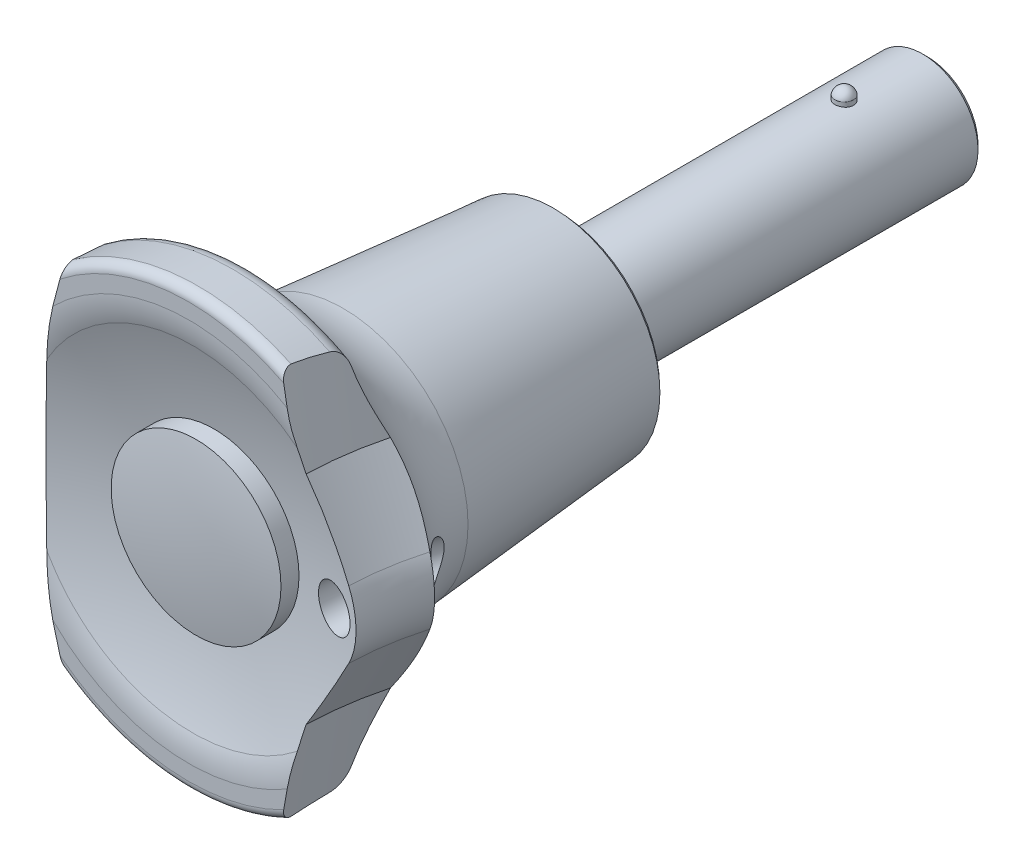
ISO-10303-21;
HEADER;
FILE_DESCRIPTION(('STEP AP214'),'2;1');
FILE_NAME('part.step','',(''),(''),'','','');
FILE_SCHEMA(('AUTOMOTIVE_DESIGN { 1 0 10303 214 1 1 1 1 }'));
ENDSEC;
DATA;
#1=APPLICATION_CONTEXT('core data for automotive mechanical design processes');
#2=APPLICATION_PROTOCOL_DEFINITION('international standard','automotive_design',2000,#1);
#3=PRODUCT_CONTEXT('',#1,'mechanical');
#4=PRODUCT('Part','Part','',(#3));
#5=PRODUCT_RELATED_PRODUCT_CATEGORY('part','',(#4));
#6=PRODUCT_DEFINITION_FORMATION('','',#4);
#7=PRODUCT_DEFINITION_CONTEXT('part definition',#1,'design');
#8=PRODUCT_DEFINITION('design','',#6,#7);
#9=PRODUCT_DEFINITION_SHAPE('','',#8);
#10=(LENGTH_UNIT() NAMED_UNIT(*) SI_UNIT(.MILLI.,.METRE.));
#11=(NAMED_UNIT(*) PLANE_ANGLE_UNIT() SI_UNIT($,.RADIAN.));
#12=(NAMED_UNIT(*) SI_UNIT($,.STERADIAN.) SOLID_ANGLE_UNIT());
#13=UNCERTAINTY_MEASURE_WITH_UNIT(LENGTH_MEASURE(1.E-05),#10,'distance_accuracy_value','');
#14=(GEOMETRIC_REPRESENTATION_CONTEXT(3) GLOBAL_UNCERTAINTY_ASSIGNED_CONTEXT((#13)) GLOBAL_UNIT_ASSIGNED_CONTEXT((#10,
#11,#12)) REPRESENTATION_CONTEXT('',''));
#15=CARTESIAN_POINT('',(0.,0.,0.));
#16=DIRECTION('',(0.,0.,1.));
#17=DIRECTION('',(1.,0.,0.));
#18=AXIS2_PLACEMENT_3D('',#15,#16,#17);
#19=CARTESIAN_POINT('',(0.,-2.65618770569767E-13,-13.3000000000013));
#20=DIRECTION('',(0.432819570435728,0.734820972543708,0.52221198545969));
#21=DIRECTION('',(-0.825912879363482,0.0910631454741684,0.556395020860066));
#22=AXIS2_PLACEMENT_3D('',#19,#20,#21);
#23=SPHERICAL_SURFACE('',#22,53.3000000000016);
#24=CARTESIAN_POINT('',(0.,0.,39.2));
#25=DIRECTION('',(0.,0.,1.));
#26=DIRECTION('',(1.,0.,0.));
#27=AXIS2_PLACEMENT_3D('',#24,#25,#26);
#28=CIRCLE('',#27,9.2);
#29=CARTESIAN_POINT('',(9.2,0.,39.2));
#30=VERTEX_POINT('',#29);
#31=EDGE_CURVE('E577',#30,#30,#28,.F.);
#32=ORIENTED_EDGE('',*,*,#31,.F.);
#33=EDGE_LOOP('',(#32));
#34=FACE_BOUND('',#33,.T.);
#35=ADVANCED_FACE('F14',(#34),#23,.T.);
#36=CARTESIAN_POINT('',(0.,0.,29.6));
#37=DIRECTION('',(0.,0.,1.));
#38=DIRECTION('',(1.,0.,0.));
#39=AXIS2_PLACEMENT_3D('',#36,#37,#38);
#40=CYLINDRICAL_SURFACE('',#39,9.2);
#41=CARTESIAN_POINT('',(9.2,0.,37.2467115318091));
#42=CARTESIAN_POINT('',(9.20000185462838,-0.258477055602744,37.2467115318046));
#43=CARTESIAN_POINT('',(9.18910252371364,-0.516923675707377,37.2467115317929));
#44=CARTESIAN_POINT('',(9.14558128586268,-1.03206618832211,37.2467115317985));
#45=CARTESIAN_POINT('',(9.11295366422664,-1.28876160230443,37.2467115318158));
#46=CARTESIAN_POINT('',(9.02615325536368,-1.79876171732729,37.2467115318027));
#47=CARTESIAN_POINT('',(8.97195747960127,-2.05206250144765,37.2467115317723));
#48=CARTESIAN_POINT('',(8.84240671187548,-2.5531984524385,37.2467115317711));
#49=CARTESIAN_POINT('',(8.76705146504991,-2.80103355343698,37.2467115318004));
#50=CARTESIAN_POINT('',(8.59576047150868,-3.28934916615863,37.2467115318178));
#51=CARTESIAN_POINT('',(8.49983486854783,-3.52983323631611,37.2467115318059));
#52=CARTESIAN_POINT('',(8.2880617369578,-4.00186826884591,37.246711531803));
#53=CARTESIAN_POINT('',(8.17221389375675,-4.23341909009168,37.2467115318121));
#54=CARTESIAN_POINT('',(7.92147515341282,-4.68583944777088,37.2467115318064));
#55=CARTESIAN_POINT('',(7.78659246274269,-4.90671353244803,37.2467115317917));
#56=CARTESIAN_POINT('',(7.4986549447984,-5.33639203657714,37.2467115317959));
#57=CARTESIAN_POINT('',(7.34559384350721,-5.54519225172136,37.2467115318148));
#58=CARTESIAN_POINT('',(7.02243787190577,-5.94913959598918,37.2467115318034));
#59=CARTESIAN_POINT('',(6.85234434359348,-6.14428779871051,37.2467115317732));
#60=CARTESIAN_POINT('',(6.49631888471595,-6.51956588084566,37.246711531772));
#61=CARTESIAN_POINT('',(6.31038662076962,-6.69969544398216,37.2467115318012));
#62=CARTESIAN_POINT('',(5.92400519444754,-7.04365410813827,37.2467115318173));
#63=CARTESIAN_POINT('',(5.72355577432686,-7.20748291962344,37.2467115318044));
#64=CARTESIAN_POINT('',(5.30956347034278,-7.51767513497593,37.2467115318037));
#65=CARTESIAN_POINT('',(5.09602029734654,-7.66403815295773,37.246711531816));
#66=CARTESIAN_POINT('',(4.65736864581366,-7.93825027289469,37.2467115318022));
#67=CARTESIAN_POINT('',(4.43226047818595,-8.06609987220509,37.246711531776));
#68=CARTESIAN_POINT('',(3.97207525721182,-8.3023802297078,37.2467115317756));
#69=CARTESIAN_POINT('',(3.73699826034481,-8.41081109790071,37.2467115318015));
#70=CARTESIAN_POINT('',(3.25854539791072,-8.60748402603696,37.2467115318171));
#71=CARTESIAN_POINT('',(3.01516953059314,-8.69572608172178,37.2467115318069));
#72=CARTESIAN_POINT('',(2.52184890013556,-8.85139410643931,37.2467115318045));
#73=CARTESIAN_POINT('',(2.2719041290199,-8.91882005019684,37.2467115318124));
#74=CARTESIAN_POINT('',(1.76726641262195,-9.03236657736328,37.2467115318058));
#75=CARTESIAN_POINT('',(1.51257429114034,-9.07849082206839,37.2467115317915));
#76=CARTESIAN_POINT('',(1.00012124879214,-9.14913549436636,37.246711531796));
#77=CARTESIAN_POINT('',(0.742359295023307,-9.17364842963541,37.246711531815));
#78=CARTESIAN_POINT('',(0.225734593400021,-9.20086637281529,37.2467115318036));
#79=CARTESIAN_POINT('',(-0.0331279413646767,-9.20357542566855,37.2467115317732));
#80=CARTESIAN_POINT('',(-0.550166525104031,-9.18717680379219,37.246711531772));
#81=CARTESIAN_POINT('',(-0.80834255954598,-9.16806867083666,37.246711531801));
#82=CARTESIAN_POINT('',(-1.32216168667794,-9.10817141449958,37.2467115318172));
#83=CARTESIAN_POINT('',(-1.5778048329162,-9.06738275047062,37.2467115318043));
#84=CARTESIAN_POINT('',(-2.08475193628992,-8.96441355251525,37.2467115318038));
#85=CARTESIAN_POINT('',(-2.33605579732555,-8.90223254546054,37.2467115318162));
#86=CARTESIAN_POINT('',(-2.83253007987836,-8.75692145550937,37.2467115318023));
#87=CARTESIAN_POINT('',(-3.07770054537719,-8.67379152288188,37.2467115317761));
#88=CARTESIAN_POINT('',(-3.56016551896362,-8.48717389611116,37.2467115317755));
#89=CARTESIAN_POINT('',(-3.79746007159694,-8.38368631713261,37.2467115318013));
#90=CARTESIAN_POINT('',(-4.26248809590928,-8.15708862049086,37.2467115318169));
#91=CARTESIAN_POINT('',(-4.49022154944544,-8.03397846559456,37.2467115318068));
#92=CARTESIAN_POINT('',(-4.93450813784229,-7.76901081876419,37.2467115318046));
#93=CARTESIAN_POINT('',(-5.15106125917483,-7.62715330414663,37.2467115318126));
#94=CARTESIAN_POINT('',(-5.57141062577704,-7.32572590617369,37.246711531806));
#95=CARTESIAN_POINT('',(-5.77520908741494,-7.16615911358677,37.2467115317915));
#96=CARTESIAN_POINT('',(-6.16871012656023,-6.83036880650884,37.246711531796));
#97=CARTESIAN_POINT('',(-6.35840779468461,-6.65413953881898,37.2467115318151));
#98=CARTESIAN_POINT('',(-6.72224710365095,-6.28635764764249,37.2467115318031));
#99=CARTESIAN_POINT('',(-6.89639155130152,-6.09480780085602,37.2467115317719));
#100=CARTESIAN_POINT('',(-7.22792754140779,-5.69771568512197,37.2467115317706));
#101=CARTESIAN_POINT('',(-7.38531882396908,-5.49217319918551,37.2467115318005));
#102=CARTESIAN_POINT('',(-7.68222361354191,-5.06856374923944,37.2467115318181));
#103=CARTESIAN_POINT('',(-7.82173745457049,-4.85049701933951,37.2467115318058));
#104=CARTESIAN_POINT('',(-8.08190186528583,-4.40338089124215,37.2467115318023));
#105=CARTESIAN_POINT('',(-8.20255201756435,-4.1743312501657,37.246711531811));
#106=CARTESIAN_POINT('',(-8.42410685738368,-3.70692592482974,37.2467115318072));
#107=CARTESIAN_POINT('',(-8.52501522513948,-3.46857198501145,37.2467115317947));
#108=CARTESIAN_POINT('',(-8.70642929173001,-2.98412666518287,37.2467115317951));
#109=CARTESIAN_POINT('',(-8.78692781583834,-2.73803259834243,37.2467115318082));
#110=CARTESIAN_POINT('',(-8.92687528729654,-2.24003727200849,37.2467115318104));
#111=CARTESIAN_POINT('',(-8.98633268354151,-1.98813838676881,37.2467115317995));
#112=CARTESIAN_POINT('',(-9.08384258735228,-1.48011271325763,37.2467115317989));
#113=CARTESIAN_POINT('',(-9.12188538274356,-1.22398406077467,37.2467115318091));
#114=CARTESIAN_POINT('',(-9.17625392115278,-0.709432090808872,37.2467115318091));
#115=CARTESIAN_POINT('',(-9.19257966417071,-0.45100877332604,37.2467115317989));
#116=CARTESIAN_POINT('',(-9.20339556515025,0.0661771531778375,37.2467115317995));
#117=CARTESIAN_POINT('',(-9.19789561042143,0.324939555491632,37.2467115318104));
#118=CARTESIAN_POINT('',(-9.16511481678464,0.841185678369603,37.2467115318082));
#119=CARTESIAN_POINT('',(-9.13782521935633,1.09866884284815,37.2467115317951));
#120=CARTESIAN_POINT('',(-9.06166168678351,1.61033030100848,37.2467115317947));
#121=CARTESIAN_POINT('',(-9.01279532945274,1.864509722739,37.2467115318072));
#122=CARTESIAN_POINT('',(-8.89381622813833,2.36789651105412,37.246711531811));
#123=CARTESIAN_POINT('',(-8.82369952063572,2.61710294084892,37.2467115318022));
#124=CARTESIAN_POINT('',(-8.66272318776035,3.10871759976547,37.2467115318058));
#125=CARTESIAN_POINT('',(-8.57186402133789,3.35112597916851,37.2467115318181));
#126=CARTESIAN_POINT('',(-8.37004594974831,3.8274314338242,37.2467115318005));
#127=CARTESIAN_POINT('',(-8.25908666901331,4.06132834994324,37.2467115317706));
#128=CARTESIAN_POINT('',(-8.01786026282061,4.518939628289,37.2467115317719));
#129=CARTESIAN_POINT('',(-7.88759343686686,4.7426541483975,37.2467115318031));
#130=CARTESIAN_POINT('',(-7.60865148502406,5.17835352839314,37.2467115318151));
#131=CARTESIAN_POINT('',(-7.45997303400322,5.39033625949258,37.246711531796));
#132=CARTESIAN_POINT('',(-7.14533841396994,5.80094952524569,37.2467115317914));
#133=CARTESIAN_POINT('',(-6.97938824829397,5.99958466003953,37.246711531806));
#134=CARTESIAN_POINT('',(-6.63131665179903,6.38220487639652,37.2467115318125));
#135=CARTESIAN_POINT('',(-6.44919240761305,6.5661873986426,37.2467115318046));
#136=CARTESIAN_POINT('',(-6.07009243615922,6.9181556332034,37.2467115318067));
#137=CARTESIAN_POINT('',(-5.8731167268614,7.08614136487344,37.2467115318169));
#138=CARTESIAN_POINT('',(-5.46571438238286,7.40492171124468,37.2467115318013));
#139=CARTESIAN_POINT('',(-5.2552877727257,7.55571635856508,37.2467115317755));
#140=CARTESIAN_POINT('',(-4.82247807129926,7.83904364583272,37.246711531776));
#141=CARTESIAN_POINT('',(-4.60009491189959,7.97157618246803,37.2467115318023));
#142=CARTESIAN_POINT('',(-4.14495258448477,8.21743689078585,37.2467115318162));
#143=CARTESIAN_POINT('',(-3.91219334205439,8.33076492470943,37.2467115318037));
#144=CARTESIAN_POINT('',(-3.43796040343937,8.53740746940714,37.2467115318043));
#145=CARTESIAN_POINT('',(-3.1964869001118,8.63072242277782,37.2467115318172));
#146=CARTESIAN_POINT('',(-2.70653205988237,8.79668034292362,37.246711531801));
#147=CARTESIAN_POINT('',(-2.4580505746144,8.8693228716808,37.2467115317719));
#148=CARTESIAN_POINT('',(-1.9558565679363,8.99341554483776,37.2467115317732));
#149=CARTESIAN_POINT('',(-1.70214415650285,9.04486613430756,37.2467115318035));
#150=CARTESIAN_POINT('',(-1.19123944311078,9.12621890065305,37.2467115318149));
#151=CARTESIAN_POINT('',(-0.93404650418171,9.15611707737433,37.2467115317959));
#152=CARTESIAN_POINT('',(-0.418145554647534,9.19413024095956,37.2467115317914));
#153=CARTESIAN_POINT('',(-0.159438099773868,9.20225277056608,37.2467115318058));
#154=CARTESIAN_POINT('',(0.357786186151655,9.19667812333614,37.2467115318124));
#155=CARTESIAN_POINT('',(0.616302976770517,9.18297719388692,37.2467115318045));
#156=CARTESIAN_POINT('',(1.13126307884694,9.13384602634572,37.2467115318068));
#157=CARTESIAN_POINT('',(1.38770639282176,9.09841581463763,37.246711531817));
#158=CARTESIAN_POINT('',(1.89669667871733,9.00607800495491,37.2467115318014));
#159=CARTESIAN_POINT('',(2.14924365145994,8.94917041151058,37.2467115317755));
#160=CARTESIAN_POINT('',(2.64864726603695,8.81428203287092,37.2467115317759));
#161=CARTESIAN_POINT('',(2.89550387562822,8.7363011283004,37.2467115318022));
#162=CARTESIAN_POINT('',(3.38177681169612,8.559818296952,37.246711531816));
#163=CARTESIAN_POINT('',(3.62119293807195,8.46131581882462,37.2467115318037));
#164=CARTESIAN_POINT('',(4.09087056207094,8.24449384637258,37.2467115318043));
#165=CARTESIAN_POINT('',(4.32113226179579,8.12617478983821,37.2467115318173));
#166=CARTESIAN_POINT('',(4.77086558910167,7.87056159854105,37.2467115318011));
#167=CARTESIAN_POINT('',(4.99033740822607,7.73326780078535,37.246711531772));
#168=CARTESIAN_POINT('',(5.41693056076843,7.44068268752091,37.2467115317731));
#169=CARTESIAN_POINT('',(5.62405215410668,7.28539175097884,37.2467115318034));
#170=CARTESIAN_POINT('',(6.02449325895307,6.95790104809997,37.2467115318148));
#171=CARTESIAN_POINT('',(6.21781168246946,6.7856999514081,37.2467115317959));
#172=CARTESIAN_POINT('',(6.58918960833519,6.42568596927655,37.2467115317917));
#173=CARTESIAN_POINT('',(6.76725436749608,6.23787850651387,37.2467115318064));
#174=CARTESIAN_POINT('',(7.10700778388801,5.84785067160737,37.2467115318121));
#175=CARTESIAN_POINT('',(7.2686893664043,5.64562413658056,37.246711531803));
#176=CARTESIAN_POINT('',(7.57443690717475,5.22827132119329,37.2467115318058));
#177=CARTESIAN_POINT('',(7.71850314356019,5.01314524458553,37.2467115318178));
#178=CARTESIAN_POINT('',(7.98806497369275,4.57141097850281,37.2467115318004));
#179=CARTESIAN_POINT('',(8.11355139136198,4.3447971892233,37.2467115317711));
#180=CARTESIAN_POINT('',(8.34497404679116,3.88180237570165,37.2467115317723));
#181=CARTESIAN_POINT('',(8.45091052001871,3.64542146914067,37.2467115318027));
#182=CARTESIAN_POINT('',(8.64237937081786,3.1648238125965,37.2467115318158));
#183=CARTESIAN_POINT('',(8.72793341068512,2.92061569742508,37.2467115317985));
#184=CARTESIAN_POINT('',(8.87815350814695,2.42594426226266,37.2467115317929));
#185=CARTESIAN_POINT('',(8.94282505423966,2.17548260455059,37.2467115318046));
#186=CARTESIAN_POINT('',(9.06430244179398,1.60704034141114,37.2467115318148));
#187=CARTESIAN_POINT('',(9.11514584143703,1.28776808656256,37.2467115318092));
#188=CARTESIAN_POINT('',(9.18299346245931,0.645648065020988,37.2467115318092));
#189=CARTESIAN_POINT('',(9.19999768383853,0.322800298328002,37.2467115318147));
#190=CARTESIAN_POINT('',(9.2,0.,37.2467115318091));
#191=B_SPLINE_CURVE_WITH_KNOTS('',3,(#41,#42,#43,#44,#45,#46,#47,#48,#49,#50,#51,#52,#53,#54,
#55,#56,#57,#58,#59,#60,#61,#62,#63,#64,#65,#66,#67,#68,#69,#70,#71,#72,#73,#74,#75,#76,#77,#78,
#79,#80,#81,#82,#83,#84,#85,#86,#87,#88,#89,#90,#91,#92,#93,#94,#95,#96,#97,#98,#99,#100,#101,
#102,#103,#104,#105,#106,#107,#108,#109,#110,#111,#112,#113,#114,#115,#116,#117,#118,#119,#120,
#121,#122,#123,#124,#125,#126,#127,#128,#129,#130,#131,#132,#133,#134,#135,#136,#137,#138,#139,
#140,#141,#142,#143,#144,#145,#146,#147,#148,#149,#150,#151,#152,#153,#154,#155,#156,#157,#158,
#159,#160,#161,#162,#163,#164,#165,#166,#167,#168,#169,#170,#171,#172,#173,#174,#175,#176,#177,
#178,#179,#180,#181,#182,#183,#184,#185,#186,#187,#188,#189,#190),.UNSPECIFIED.,.T.,.F.,(4,2,2,
2,2,2,2,2,2,2,2,2,2,2,2,2,2,2,2,2,2,2,2,2,2,2,2,2,2,2,2,2,2,2,2,2,2,2,2,2,2,2,2,2,2,2,2,2,2,2,2,
2,2,2,2,2,2,2,2,2,2,2,2,2,2,2,2,2,2,2,2,2,2,2,4),(0.,0.775149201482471,1.55050235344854,
2.3266841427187,3.10287528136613,3.87868453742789,4.65450604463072,5.42999408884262,
6.20575056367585,6.98144596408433,7.75715769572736,8.53288320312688,9.30862584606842,
10.0843476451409,10.8600650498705,11.6357826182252,12.4115011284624,13.1870862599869,
13.9629401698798,14.738650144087,15.5143764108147,16.2900862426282,17.0658132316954,
17.8415346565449,18.6172516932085,19.3929702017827,20.1686896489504,20.9442739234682,
21.720126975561,22.4958397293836,23.2715645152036,24.0472748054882,24.8230022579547,
25.5985849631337,26.3744399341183,27.1499830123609,27.9258775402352,28.7017720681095,
29.4773151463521,30.2531701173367,31.0287528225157,31.8044802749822,32.5801905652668,
33.3559153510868,34.1316281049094,34.9074811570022,35.6830654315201,36.4587848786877,
37.2345033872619,38.0102204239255,38.7859418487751,39.5616688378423,40.3373786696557,
41.1131049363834,41.8888149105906,42.6646688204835,43.4402539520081,44.2159724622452,
44.9916900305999,45.7674074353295,46.543129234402,47.3188718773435,48.0945973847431,
48.8703091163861,49.6460045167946,50.4217609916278,51.1972490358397,51.9730705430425,
52.7488797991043,53.5250709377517,54.3012527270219,55.0766058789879,55.8517550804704,
56.8198038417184,57.7878526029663),.UNSPECIFIED.);
#192=CARTESIAN_POINT('',(9.2,0.,37.2467115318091));
#193=VERTEX_POINT('',#192);
#194=EDGE_CURVE('E582',#193,#193,#191,.T.);
#195=ORIENTED_EDGE('',*,*,#194,.F.);
#196=EDGE_LOOP('',(#195));
#197=FACE_BOUND('',#196,.T.);
#198=ORIENTED_EDGE('',*,*,#31,.T.);
#199=EDGE_LOOP('',(#198));
#200=FACE_BOUND('',#199,.T.);
#201=ADVANCED_FACE('F195',(#197,#200),#40,.T.);
#202=CARTESIAN_POINT('',(0.,2.75,-40.));
#203=DIRECTION('',(0.,0.,-1.));
#204=DIRECTION('',(-1.,0.,0.));
#205=AXIS2_PLACEMENT_3D('',#202,#203,#204);
#206=PLANE('',#205);
#207=CARTESIAN_POINT('',(0.,0.,-40.0000000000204));
#208=DIRECTION('',(0.,0.,1.));
#209=DIRECTION('',(1.,0.,0.));
#210=AXIS2_PLACEMENT_3D('',#207,#208,#209);
#211=CIRCLE('',#210,5.49999999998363);
#212=CARTESIAN_POINT('',(5.49999999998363,0.,-40.0000000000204));
#213=VERTEX_POINT('',#212);
#214=EDGE_CURVE('E565',#213,#213,#211,.T.);
#215=ORIENTED_EDGE('',*,*,#214,.F.);
#216=EDGE_LOOP('',(#215));
#217=FACE_BOUND('',#216,.T.);
#218=ADVANCED_FACE('F507',(#217),#206,.T.);
#219=CARTESIAN_POINT('',(0.,-6.225,-31.));
#220=DIRECTION('',(0.294423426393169,0.0690637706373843,0.953176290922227));
#221=DIRECTION('',(-0.612298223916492,-0.752154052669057,0.243629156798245));
#222=AXIS2_PLACEMENT_3D('',#219,#220,#221);
#223=SPHERICAL_SURFACE('',#222,1.025);
#224=CARTESIAN_POINT('',(0.,-6.45,-31.));
#225=DIRECTION('',(0.,1.,0.));
#226=DIRECTION('',(0.,0.,1.));
#227=AXIS2_PLACEMENT_3D('',#224,#225,#226);
#228=CIRCLE('',#227,1.);
#229=CARTESIAN_POINT('',(0.,-6.45,-30.));
#230=VERTEX_POINT('',#229);
#231=EDGE_CURVE('E568',#230,#230,#228,.T.);
#232=ORIENTED_EDGE('',*,*,#231,.F.);
#233=EDGE_LOOP('',(#232));
#234=FACE_BOUND('',#233,.T.);
#235=ADVANCED_FACE('F509',(#234),#223,.T.);
#236=CARTESIAN_POINT('',(0.,6.225,-31.));
#237=DIRECTION('',(0.294423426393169,0.0690637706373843,0.953176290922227));
#238=DIRECTION('',(-0.612298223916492,-0.752154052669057,0.243629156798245));
#239=AXIS2_PLACEMENT_3D('',#236,#237,#238);
#240=SPHERICAL_SURFACE('',#239,1.025);
#241=CARTESIAN_POINT('',(0.,6.45,-31.));
#242=DIRECTION('',(0.,1.,0.));
#243=DIRECTION('',(0.,0.,1.));
#244=AXIS2_PLACEMENT_3D('',#241,#242,#243);
#245=CIRCLE('',#244,1.);
#246=CARTESIAN_POINT('',(0.,6.45,-30.));
#247=VERTEX_POINT('',#246);
#248=EDGE_CURVE('E570',#247,#247,#245,.F.);
#249=ORIENTED_EDGE('',*,*,#248,.F.);
#250=EDGE_LOOP('',(#249));
#251=FACE_BOUND('',#250,.T.);
#252=ADVANCED_FACE('F325',(#251),#240,.T.);
#253=CARTESIAN_POINT('',(0.,0.,-39.5000000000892));
#254=DIRECTION('',(0.,0.,1.));
#255=DIRECTION('',(1.,0.,0.));
#256=AXIS2_PLACEMENT_3D('',#253,#254,#255);
#257=CONICAL_SURFACE('',#256,5.99999999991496,0.785398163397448);
#258=ORIENTED_EDGE('',*,*,#214,.T.);
#259=EDGE_LOOP('',(#258));
#260=FACE_BOUND('',#259,.T.);
#261=CARTESIAN_POINT('',(0.,0.,-39.5));
#262=DIRECTION('',(0.,0.,1.));
#263=DIRECTION('',(1.,0.,0.));
#264=AXIS2_PLACEMENT_3D('',#261,#262,#263);
#265=CIRCLE('',#264,6.);
#266=CARTESIAN_POINT('',(6.,0.,-39.5));
#267=VERTEX_POINT('',#266);
#268=EDGE_CURVE('E527',#267,#267,#265,.T.);
#269=ORIENTED_EDGE('',*,*,#268,.F.);
#270=EDGE_LOOP('',(#269));
#271=FACE_BOUND('',#270,.T.);
#272=ADVANCED_FACE('F553',(#260,#271),#257,.T.);
#273=CARTESIAN_POINT('',(0.,0.,-31.));
#274=DIRECTION('',(0.,1.,0.));
#275=DIRECTION('',(0.,0.,1.));
#276=AXIS2_PLACEMENT_3D('',#273,#274,#275);
#277=CYLINDRICAL_SURFACE('',#276,1.);
#278=CARTESIAN_POINT('',(0.,-6.,-30.));
#279=CARTESIAN_POINT('',(0.0557503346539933,-5.99999897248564,-30.0000024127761));
#280=CARTESIAN_POINT('',(0.111535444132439,-5.99921479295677,-30.0046783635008));
#281=CARTESIAN_POINT('',(0.221545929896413,-5.99616168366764,-30.0232524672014));
#282=CARTESIAN_POINT('',(0.275769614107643,-5.99389120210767,-30.0371602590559));
#283=CARTESIAN_POINT('',(0.381042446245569,-5.98812022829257,-30.0737664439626));
#284=CARTESIAN_POINT('',(0.432094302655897,-5.98462080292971,-30.0964572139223));
#285=CARTESIAN_POINT('',(0.529658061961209,-5.97677679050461,-30.149965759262));
#286=CARTESIAN_POINT('',(0.576170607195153,-5.97243232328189,-30.1807823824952));
#287=CARTESIAN_POINT('',(0.663788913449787,-5.96333328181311,-30.2499819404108));
#288=CARTESIAN_POINT('',(0.704844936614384,-5.95857551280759,-30.2884274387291));
#289=CARTESIAN_POINT('',(0.779955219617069,-5.94921053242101,-30.3716589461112));
#290=CARTESIAN_POINT('',(0.81400899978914,-5.94460333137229,-30.4164453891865));
#291=CARTESIAN_POINT('',(0.874346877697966,-5.93603025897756,-30.5114284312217));
#292=CARTESIAN_POINT('',(0.900581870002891,-5.93206850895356,-30.5616566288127));
#293=CARTESIAN_POINT('',(0.944223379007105,-5.92527915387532,-30.6658839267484));
#294=CARTESIAN_POINT('',(0.961630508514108,-5.92245147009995,-30.7198827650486));
#295=CARTESIAN_POINT('',(0.986965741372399,-5.91828214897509,-30.8295920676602));
#296=CARTESIAN_POINT('',(0.994979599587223,-5.91692707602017,-30.8852822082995));
#297=CARTESIAN_POINT('',(1.00156669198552,-5.91581575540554,-30.9972320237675));
#298=CARTESIAN_POINT('',(1.00014057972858,-5.91605939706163,-31.0534916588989));
#299=CARTESIAN_POINT('',(0.987958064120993,-5.91810571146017,-31.1643709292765));
#300=CARTESIAN_POINT('',(0.977298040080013,-5.91989227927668,-31.2190014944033));
#301=CARTESIAN_POINT('',(0.947101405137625,-5.9247979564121,-31.3256881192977));
#302=CARTESIAN_POINT('',(0.927564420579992,-5.92791712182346,-31.3777440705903));
#303=CARTESIAN_POINT('',(0.880069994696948,-5.93515405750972,-31.478093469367));
#304=CARTESIAN_POINT('',(0.852072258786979,-5.93927658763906,-31.5263674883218));
#305=CARTESIAN_POINT('',(0.788481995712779,-5.94805203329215,-31.6175650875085));
#306=CARTESIAN_POINT('',(0.752889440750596,-5.95270495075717,-31.6604886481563));
#307=CARTESIAN_POINT('',(0.674601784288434,-5.96208707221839,-31.7403215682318));
#308=CARTESIAN_POINT('',(0.631825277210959,-5.9668165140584,-31.7771511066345));
#309=CARTESIAN_POINT('',(0.540634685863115,-5.9757685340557,-31.8431382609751));
#310=CARTESIAN_POINT('',(0.492218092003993,-5.97999088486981,-31.8722924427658));
#311=CARTESIAN_POINT('',(0.391033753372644,-5.98745939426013,-31.9221061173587));
#312=CARTESIAN_POINT('',(0.338259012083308,-5.99070394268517,-31.9427516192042));
#313=CARTESIAN_POINT('',(0.229994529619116,-5.99583383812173,-31.9748218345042));
#314=CARTESIAN_POINT('',(0.174510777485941,-5.99772205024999,-31.986265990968));
#315=CARTESIAN_POINT('',(0.098854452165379,-5.99921820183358,-31.9952998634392));
#316=CARTESIAN_POINT('',(0.0791283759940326,-5.99951075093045,-31.9970609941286));
#317=CARTESIAN_POINT('',(0.0396045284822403,-5.99990183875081,-31.9994115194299));
#318=CARTESIAN_POINT('',(0.0198067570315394,-6.0000003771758,-32.0000009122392));
#319=CARTESIAN_POINT('',(-0.0557017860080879,-5.9999989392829,-31.9999974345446));
#320=CARTESIAN_POINT('',(-0.111474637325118,-5.99921557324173,-31.9953262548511));
#321=CARTESIAN_POINT('',(-0.221497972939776,-5.99616392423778,-31.9767612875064));
#322=CARTESIAN_POINT('',(-0.27574513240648,-5.99389262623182,-31.9628487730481));
#323=CARTESIAN_POINT('',(-0.381047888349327,-5.98811984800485,-31.9262311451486));
#324=CARTESIAN_POINT('',(-0.432107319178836,-5.98461988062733,-31.9035368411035));
#325=CARTESIAN_POINT('',(-0.529670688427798,-5.97677565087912,-31.8500261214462));
#326=CARTESIAN_POINT('',(-0.576176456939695,-5.9724317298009,-31.8192129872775));
#327=CARTESIAN_POINT('',(-0.663783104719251,-5.96333387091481,-31.7500226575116));
#328=CARTESIAN_POINT('',(-0.704834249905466,-5.95857673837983,-31.7115829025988));
#329=CARTESIAN_POINT('',(-0.779946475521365,-5.94921172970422,-31.6283522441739));
#330=CARTESIAN_POINT('',(-0.814005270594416,-5.94460390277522,-31.5835592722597));
#331=CARTESIAN_POINT('',(-0.874362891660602,-5.93602794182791,-31.4885475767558));
#332=CARTESIAN_POINT('',(-0.90060933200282,-5.93206420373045,-31.4382951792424));
#333=CARTESIAN_POINT('',(-0.944242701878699,-5.9252761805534,-31.3340525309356));
#334=CARTESIAN_POINT('',(-0.961639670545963,-5.92245060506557,-31.2800665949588));
#335=CARTESIAN_POINT('',(-0.982867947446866,-5.91895607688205,-31.1881599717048));
#336=CARTESIAN_POINT('',(-0.989282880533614,-5.91788293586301,-31.1508308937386));
#337=CARTESIAN_POINT('',(-0.997849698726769,-5.91644442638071,-31.0756732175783));
#338=CARTESIAN_POINT('',(-1.00000164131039,-5.9160790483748,-31.037844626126));
#339=CARTESIAN_POINT('',(-0.999997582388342,-5.91608086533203,-30.9442557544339));
#340=CARTESIAN_POINT('',(-0.995322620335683,-5.91687628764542,-30.8884767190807));
#341=CARTESIAN_POINT('',(-0.976752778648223,-5.91996951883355,-30.7784787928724));
#342=CARTESIAN_POINT('',(-0.962848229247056,-5.92226890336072,-30.7242616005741));
#343=CARTESIAN_POINT('',(-0.926251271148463,-5.92810252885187,-30.6190017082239));
#344=CARTESIAN_POINT('',(-0.903566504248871,-5.93163569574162,-30.5679562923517));
#345=CARTESIAN_POINT('',(-0.850072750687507,-5.93953734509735,-30.4704048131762));
#346=CARTESIAN_POINT('',(-0.819265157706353,-5.94390568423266,-30.4238979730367));
#347=CARTESIAN_POINT('',(-0.750078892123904,-5.95303338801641,-30.3362796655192));
#348=CARTESIAN_POINT('',(-0.711636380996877,-5.95779583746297,-30.2952189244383));
#349=CARTESIAN_POINT('',(-0.628398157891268,-5.9671489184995,-30.2200900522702));
#350=CARTESIAN_POINT('',(-0.583600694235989,-5.97173950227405,-30.1860238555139));
#351=CARTESIAN_POINT('',(-0.488585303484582,-5.98026523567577,-30.1256582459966));
#352=CARTESIAN_POINT('',(-0.438334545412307,-5.98419600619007,-30.0994098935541));
#353=CARTESIAN_POINT('',(-0.334095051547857,-5.99091787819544,-30.0557723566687));
#354=CARTESIAN_POINT('',(-0.280110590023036,-5.99371025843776,-30.038373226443));
#355=CARTESIAN_POINT('',(-0.188198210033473,-5.99716174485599,-30.0171390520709));
#356=CARTESIAN_POINT('',(-0.150861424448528,-5.99822090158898,-30.0107214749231));
#357=CARTESIAN_POINT('',(-0.0756884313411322,-5.99964037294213,-30.0021511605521));
#358=CARTESIAN_POINT('',(-0.0378522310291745,-6.00000069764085,-29.9999983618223));
#359=CARTESIAN_POINT('',(0.,-6.,-30.));
#360=B_SPLINE_CURVE_WITH_KNOTS('',3,(#278,#279,#280,#281,#282,#283,#284,#285,#286,#287,#288,
#289,#290,#291,#292,#293,#294,#295,#296,#297,#298,#299,#300,#301,#302,#303,#304,#305,#306,#307,
#308,#309,#310,#311,#312,#313,#314,#315,#316,#317,#318,#319,#320,#321,#322,#323,#324,#325,#326,
#327,#328,#329,#330,#331,#332,#333,#334,#335,#336,#337,#338,#339,#340,#341,#342,#343,#344,#345,
#346,#347,#348,#349,#350,#351,#352,#353,#354,#355,#356,#357,#358,#359),.UNSPECIFIED.,.T.,.F.,(4,
2,2,2,2,2,2,2,2,2,2,2,2,2,2,2,2,2,2,2,2,2,2,2,2,2,2,2,2,2,2,2,2,2,2,2,2,2,2,2,4),(0.,
0.167112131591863,0.334399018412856,0.501541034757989,0.668659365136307,0.837209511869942,
1.00577120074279,1.17537024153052,1.34495750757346,1.51298417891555,1.68099921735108,
1.84728143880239,2.01357066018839,2.18066466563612,2.34775928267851,2.51689385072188,
2.68610396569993,2.855591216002,3.02471938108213,3.08411267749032,3.14350606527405,
3.31053582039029,3.47790508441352,3.64506898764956,3.8121654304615,3.98069385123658,
4.14927726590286,4.31896688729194,4.48846357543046,4.60190468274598,4.71534426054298,
4.88243809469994,5.04970726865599,5.21683118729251,5.38392645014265,5.55248261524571,
5.72108533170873,5.89076623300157,6.0602560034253,6.17372004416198,6.28718244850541),.UNSPECIFIED.);
#361=CARTESIAN_POINT('',(0.,-6.,-30.));
#362=VERTEX_POINT('',#361);
#363=EDGE_CURVE('E531',#362,#362,#360,.T.);
#364=ORIENTED_EDGE('',*,*,#363,.F.);
#365=EDGE_LOOP('',(#364));
#366=FACE_BOUND('',#365,.T.);
#367=ORIENTED_EDGE('',*,*,#231,.T.);
#368=EDGE_LOOP('',(#367));
#369=FACE_BOUND('',#368,.T.);
#370=ADVANCED_FACE('F544',(#366,#369),#277,.T.);
#371=CARTESIAN_POINT('',(0.,0.,-31.));
#372=DIRECTION('',(0.,1.,0.));
#373=DIRECTION('',(0.,0.,1.));
#374=AXIS2_PLACEMENT_3D('',#371,#372,#373);
#375=CYLINDRICAL_SURFACE('',#374,1.);
#376=ORIENTED_EDGE('',*,*,#248,.T.);
#377=EDGE_LOOP('',(#376));
#378=FACE_BOUND('',#377,.T.);
#379=CARTESIAN_POINT('',(0.,6.,-32.));
#380=CARTESIAN_POINT('',(0.0557503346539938,5.99999897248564,-31.999997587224));
#381=CARTESIAN_POINT('',(0.11153544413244,5.99921479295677,-31.9953216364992));
#382=CARTESIAN_POINT('',(0.221545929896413,5.99616168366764,-31.9767475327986));
#383=CARTESIAN_POINT('',(0.275769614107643,5.99389120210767,-31.9628397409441));
#384=CARTESIAN_POINT('',(0.381042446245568,5.98812022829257,-31.9262335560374));
#385=CARTESIAN_POINT('',(0.432094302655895,5.98462080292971,-31.9035427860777));
#386=CARTESIAN_POINT('',(0.529658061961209,5.97677679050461,-31.850034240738));
#387=CARTESIAN_POINT('',(0.576170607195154,5.97243232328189,-31.8192176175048));
#388=CARTESIAN_POINT('',(0.66378891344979,5.96333328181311,-31.7500180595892));
#389=CARTESIAN_POINT('',(0.704844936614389,5.95857551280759,-31.7115725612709));
#390=CARTESIAN_POINT('',(0.779955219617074,5.949210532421,-31.6283410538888));
#391=CARTESIAN_POINT('',(0.814008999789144,5.94460333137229,-31.5835546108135));
#392=CARTESIAN_POINT('',(0.874346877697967,5.93603025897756,-31.4885715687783));
#393=CARTESIAN_POINT('',(0.900581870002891,5.93206850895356,-31.4383433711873));
#394=CARTESIAN_POINT('',(0.944223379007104,5.92527915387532,-31.3341160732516));
#395=CARTESIAN_POINT('',(0.961630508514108,5.92245147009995,-31.2801172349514));
#396=CARTESIAN_POINT('',(0.9869657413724,5.91828214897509,-31.1704079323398));
#397=CARTESIAN_POINT('',(0.994979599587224,5.91692707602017,-31.1147177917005));
#398=CARTESIAN_POINT('',(1.00156669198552,5.91581575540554,-31.0027679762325));
#399=CARTESIAN_POINT('',(1.00014057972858,5.91605939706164,-30.9465083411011));
#400=CARTESIAN_POINT('',(0.987958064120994,5.91810571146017,-30.8356290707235));
#401=CARTESIAN_POINT('',(0.97729804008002,5.91989227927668,-30.7809985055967));
#402=CARTESIAN_POINT('',(0.947101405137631,5.9247979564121,-30.6743118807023));
#403=CARTESIAN_POINT('',(0.927564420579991,5.92791712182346,-30.6222559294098));
#404=CARTESIAN_POINT('',(0.880069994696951,5.93515405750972,-30.521906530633));
#405=CARTESIAN_POINT('',(0.852072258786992,5.93927658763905,-30.4736325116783));
#406=CARTESIAN_POINT('',(0.788481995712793,5.94805203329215,-30.3824349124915));
#407=CARTESIAN_POINT('',(0.752889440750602,5.95270495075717,-30.3395113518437));
#408=CARTESIAN_POINT('',(0.674601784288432,5.96208707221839,-30.2596784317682));
#409=CARTESIAN_POINT('',(0.63182527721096,5.9668165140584,-30.2228488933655));
#410=CARTESIAN_POINT('',(0.540634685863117,5.9757685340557,-30.1568617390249));
#411=CARTESIAN_POINT('',(0.492218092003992,5.97999088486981,-30.1277075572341));
#412=CARTESIAN_POINT('',(0.391033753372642,5.98745939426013,-30.0778938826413));
#413=CARTESIAN_POINT('',(0.338259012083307,5.99070394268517,-30.0572483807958));
#414=CARTESIAN_POINT('',(0.229994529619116,5.99583383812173,-30.0251781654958));
#415=CARTESIAN_POINT('',(0.174510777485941,5.99772205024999,-30.0137340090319));
#416=CARTESIAN_POINT('',(0.0988544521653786,5.99921820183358,-30.0047001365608));
#417=CARTESIAN_POINT('',(0.0791283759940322,5.99951075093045,-30.0029390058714));
#418=CARTESIAN_POINT('',(0.0396045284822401,5.99990183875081,-30.0005884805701));
#419=CARTESIAN_POINT('',(0.0198067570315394,6.0000003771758,-29.9999990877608));
#420=CARTESIAN_POINT('',(-0.0557017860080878,5.9999989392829,-30.0000025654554));
#421=CARTESIAN_POINT('',(-0.111474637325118,5.99921557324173,-30.0046737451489));
#422=CARTESIAN_POINT('',(-0.221497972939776,5.99616392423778,-30.0232387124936));
#423=CARTESIAN_POINT('',(-0.275745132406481,5.99389262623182,-30.0371512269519));
#424=CARTESIAN_POINT('',(-0.381047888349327,5.98811984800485,-30.0737688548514));
#425=CARTESIAN_POINT('',(-0.432107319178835,5.98461988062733,-30.0964631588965));
#426=CARTESIAN_POINT('',(-0.529670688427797,5.97677565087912,-30.1499738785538));
#427=CARTESIAN_POINT('',(-0.576176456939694,5.9724317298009,-30.1807870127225));
#428=CARTESIAN_POINT('',(-0.663783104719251,5.96333387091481,-30.2499773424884));
#429=CARTESIAN_POINT('',(-0.704834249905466,5.95857673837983,-30.2884170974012));
#430=CARTESIAN_POINT('',(-0.779946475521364,5.94921172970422,-30.3716477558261));
#431=CARTESIAN_POINT('',(-0.814005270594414,5.94460390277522,-30.4164407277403));
#432=CARTESIAN_POINT('',(-0.8743628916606,5.93602794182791,-30.5114524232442));
#433=CARTESIAN_POINT('',(-0.90060933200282,5.93206420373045,-30.5617048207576));
#434=CARTESIAN_POINT('',(-0.9442427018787,5.9252761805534,-30.6659474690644));
#435=CARTESIAN_POINT('',(-0.961639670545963,5.92245060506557,-30.7199334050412));
#436=CARTESIAN_POINT('',(-0.982867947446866,5.91895607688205,-30.8118400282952));
#437=CARTESIAN_POINT('',(-0.989282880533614,5.91788293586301,-30.8491691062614));
#438=CARTESIAN_POINT('',(-0.997849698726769,5.91644442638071,-30.9243267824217));
#439=CARTESIAN_POINT('',(-1.00000164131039,5.9160790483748,-30.962155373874));
#440=CARTESIAN_POINT('',(-0.999997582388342,5.91608086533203,-31.0557442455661));
#441=CARTESIAN_POINT('',(-0.995322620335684,5.91687628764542,-31.1115232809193));
#442=CARTESIAN_POINT('',(-0.976752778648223,5.91996951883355,-31.2215212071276));
#443=CARTESIAN_POINT('',(-0.962848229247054,5.92226890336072,-31.2757383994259));
#444=CARTESIAN_POINT('',(-0.926251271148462,5.92810252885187,-31.3809982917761));
#445=CARTESIAN_POINT('',(-0.903566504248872,5.93163569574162,-31.4320437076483));
#446=CARTESIAN_POINT('',(-0.850072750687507,5.93953734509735,-31.5295951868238));
#447=CARTESIAN_POINT('',(-0.81926515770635,5.94390568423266,-31.5761020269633));
#448=CARTESIAN_POINT('',(-0.750078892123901,5.95303338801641,-31.6637203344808));
#449=CARTESIAN_POINT('',(-0.711636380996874,5.95779583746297,-31.7047810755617));
#450=CARTESIAN_POINT('',(-0.628398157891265,5.9671489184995,-31.7799099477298));
#451=CARTESIAN_POINT('',(-0.583600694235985,5.97173950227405,-31.8139761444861));
#452=CARTESIAN_POINT('',(-0.488585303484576,5.98026523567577,-31.8743417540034));
#453=CARTESIAN_POINT('',(-0.438334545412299,5.98419600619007,-31.9005901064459));
#454=CARTESIAN_POINT('',(-0.33409505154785,5.99091787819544,-31.9442276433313));
#455=CARTESIAN_POINT('',(-0.280110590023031,5.99371025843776,-31.961626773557));
#456=CARTESIAN_POINT('',(-0.188198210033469,5.99716174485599,-31.9828609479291));
#457=CARTESIAN_POINT('',(-0.150861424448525,5.99822090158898,-31.9892785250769));
#458=CARTESIAN_POINT('',(-0.0756884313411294,5.99964037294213,-31.9978488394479));
#459=CARTESIAN_POINT('',(-0.0378522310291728,6.00000069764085,-32.0000016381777));
#460=CARTESIAN_POINT('',(0.,6.,-32.));
#461=B_SPLINE_CURVE_WITH_KNOTS('',3,(#379,#380,#381,#382,#383,#384,#385,#386,#387,#388,#389,
#390,#391,#392,#393,#394,#395,#396,#397,#398,#399,#400,#401,#402,#403,#404,#405,#406,#407,#408,
#409,#410,#411,#412,#413,#414,#415,#416,#417,#418,#419,#420,#421,#422,#423,#424,#425,#426,#427,
#428,#429,#430,#431,#432,#433,#434,#435,#436,#437,#438,#439,#440,#441,#442,#443,#444,#445,#446,
#447,#448,#449,#450,#451,#452,#453,#454,#455,#456,#457,#458,#459,#460),.UNSPECIFIED.,.T.,.F.,(4,
2,2,2,2,2,2,2,2,2,2,2,2,2,2,2,2,2,2,2,2,2,2,2,2,2,2,2,2,2,2,2,2,2,2,2,2,2,2,2,4),(0.,
0.167112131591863,0.334399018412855,0.501541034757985,0.668659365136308,0.837209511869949,
1.00577120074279,1.17537024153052,1.34495750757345,1.51298417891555,1.68099921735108,
1.84728143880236,2.01357066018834,2.18066466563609,2.3477592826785,2.51689385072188,
2.68610396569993,2.85559121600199,3.02471938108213,3.08411267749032,3.14350606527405,
3.31053582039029,3.47790508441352,3.64506898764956,3.8121654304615,3.98069385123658,
4.14927726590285,4.31896688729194,4.48846357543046,4.60190468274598,4.71534426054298,
4.88243809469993,5.04970726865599,5.21683118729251,5.38392645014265,5.5524826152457,
5.72108533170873,5.89076623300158,6.0602560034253,6.17372004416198,6.2871824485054),.UNSPECIFIED.);
#462=CARTESIAN_POINT('',(0.,6.,-32.));
#463=VERTEX_POINT('',#462);
#464=EDGE_CURVE('E539',#463,#463,#461,.T.);
#465=ORIENTED_EDGE('',*,*,#464,.F.);
#466=EDGE_LOOP('',(#465));
#467=FACE_BOUND('',#466,.T.);
#468=ADVANCED_FACE('F521',(#378,#467),#375,.T.);
#469=CARTESIAN_POINT('',(0.,0.,-9.75));
#470=DIRECTION('',(0.,0.,1.));
#471=DIRECTION('',(1.,0.,0.));
#472=AXIS2_PLACEMENT_3D('',#469,#470,#471);
#473=CYLINDRICAL_SURFACE('',#472,6.);
#474=CARTESIAN_POINT('',(0.,0.,0.));
#475=DIRECTION('',(0.,0.,-1.));
#476=DIRECTION('',(-1.,0.,0.));
#477=AXIS2_PLACEMENT_3D('',#474,#475,#476);
#478=CIRCLE('',#477,6.);
#479=CARTESIAN_POINT('',(-6.,0.,0.));
#480=VERTEX_POINT('',#479);
#481=EDGE_CURVE('E532',#480,#480,#478,.F.);
#482=ORIENTED_EDGE('',*,*,#481,.F.);
#483=EDGE_LOOP('',(#482));
#484=FACE_BOUND('',#483,.T.);
#485=ORIENTED_EDGE('',*,*,#464,.T.);
#486=EDGE_LOOP('',(#485));
#487=FACE_BOUND('',#486,.T.);
#488=ORIENTED_EDGE('',*,*,#363,.T.);
#489=EDGE_LOOP('',(#488));
#490=FACE_BOUND('',#489,.T.);
#491=ORIENTED_EDGE('',*,*,#268,.T.);
#492=EDGE_LOOP('',(#491));
#493=FACE_BOUND('',#492,.T.);
#494=ADVANCED_FACE('F547',(#484,#487,#490,#493),#473,.T.);
#495=CARTESIAN_POINT('',(0.,5.5,0.));
#496=DIRECTION('',(0.,0.,-1.));
#497=DIRECTION('',(-1.,0.,0.));
#498=AXIS2_PLACEMENT_3D('',#495,#496,#497);
#499=PLANE('',#498);
#500=ORIENTED_EDGE('',*,*,#481,.T.);
#501=EDGE_LOOP('',(#500));
#502=FACE_BOUND('',#501,.T.);
#503=CARTESIAN_POINT('',(0.,0.,0.));
#504=DIRECTION('',(0.,0.,1.));
#505=DIRECTION('',(1.,0.,0.));
#506=AXIS2_PLACEMENT_3D('',#503,#504,#505);
#507=CIRCLE('',#506,11.);
#508=CARTESIAN_POINT('',(11.,0.,0.));
#509=VERTEX_POINT('',#508);
#510=EDGE_CURVE('E9',#509,#509,#507,.T.);
#511=ORIENTED_EDGE('',*,*,#510,.F.);
#512=EDGE_LOOP('',(#511));
#513=FACE_BOUND('',#512,.T.);
#514=ADVANCED_FACE('F16',(#502,#513),#499,.T.);
#515=CARTESIAN_POINT('',(0.,0.,0.498097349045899));
#516=DIRECTION('',(0.,0.,1.));
#517=DIRECTION('',(1.,0.,0.));
#518=AXIS2_PLACEMENT_3D('',#515,#516,#517);
#519=CONICAL_SURFACE('',#518,11.5435778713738,0.829031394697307);
#520=CARTESIAN_POINT('',(0.,0.,0.498097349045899));
#521=DIRECTION('',(0.,0.,1.));
#522=DIRECTION('',(0.,1.,0.));
#523=AXIS2_PLACEMENT_3D('',#520,#521,#522);
#524=CIRCLE('',#523,11.5435778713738);
#525=CARTESIAN_POINT('',(0.,11.5435778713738,0.498097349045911));
#526=VERTEX_POINT('',#525);
#527=EDGE_CURVE('E409',#526,#526,#524,.T.);
#528=ORIENTED_EDGE('',*,*,#527,.F.);
#529=EDGE_LOOP('',(#528));
#530=FACE_BOUND('',#529,.T.);
#531=ORIENTED_EDGE('',*,*,#510,.T.);
#532=EDGE_LOOP('',(#531));
#533=FACE_BOUND('',#532,.T.);
#534=ADVANCED_FACE('F430',(#530,#533),#519,.T.);
#535=CARTESIAN_POINT('',(0.,0.,23.274079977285));
#536=DIRECTION('',(0.,0.,1.));
#537=DIRECTION('',(1.,0.,0.));
#538=AXIS2_PLACEMENT_3D('',#535,#536,#537);
#539=CONICAL_SURFACE('',#538,13.5362181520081,0.0872664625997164);
#540=CARTESIAN_POINT('',(0.,0.,23.274079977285));
#541=DIRECTION('',(0.,0.,1.));
#542=DIRECTION('',(1.,0.,0.));
#543=AXIS2_PLACEMENT_3D('',#540,#541,#542);
#544=CIRCLE('',#543,13.5362181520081);
#545=CARTESIAN_POINT('',(13.5362181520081,0.,23.274079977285));
#546=VERTEX_POINT('',#545);
#547=EDGE_CURVE('E370',#546,#546,#544,.T.);
#548=ORIENTED_EDGE('',*,*,#547,.F.);
#549=EDGE_LOOP('',(#548));
#550=FACE_BOUND('',#549,.T.);
#551=ORIENTED_EDGE('',*,*,#527,.T.);
#552=EDGE_LOOP('',(#551));
#553=FACE_BOUND('',#552,.T.);
#554=ADVANCED_FACE('F323',(#550,#553),#539,.T.);
#555=CARTESIAN_POINT('',(0.,0.,22.25));
#556=DIRECTION('',(0.,0.,1.));
#557=DIRECTION('',(1.,0.,0.));
#558=AXIS2_PLACEMENT_3D('',#555,#556,#557);
#559=TOROIDAL_SURFACE('',#558,25.2415058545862,11.75);
#560=CARTESIAN_POINT('',(12.9058571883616,-11.75,31.0482392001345));
#561=CARTESIAN_POINT('',(12.840210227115,-11.9770448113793,31.1405865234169));
#562=CARTESIAN_POINT('',(12.7749820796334,-12.2040717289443,31.233279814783));
#563=CARTESIAN_POINT('',(12.6455401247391,-12.658334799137,31.4183533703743));
#564=CARTESIAN_POINT('',(12.581325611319,-12.8855706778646,31.5107338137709));
#565=CARTESIAN_POINT('',(12.4540382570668,-13.3406595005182,31.6942467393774));
#566=CARTESIAN_POINT('',(12.3909646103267,-13.5685118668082,31.7853800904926));
#567=CARTESIAN_POINT('',(12.2660387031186,-14.0252034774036,31.9655205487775));
#568=CARTESIAN_POINT('',(12.2041856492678,-14.2540419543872,32.0545290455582));
#569=CARTESIAN_POINT('',(12.0817503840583,-14.7130513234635,32.2295825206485));
#570=CARTESIAN_POINT('',(12.0211675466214,-14.9432214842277,32.3156289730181));
#571=CARTESIAN_POINT('',(11.9012297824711,-15.4054591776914,32.4840510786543));
#572=CARTESIAN_POINT('',(11.8418759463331,-15.6375281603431,32.5664235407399));
#573=CARTESIAN_POINT('',(11.724476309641,-16.1035578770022,32.7266138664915));
#574=CARTESIAN_POINT('',(11.6664304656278,-16.3375185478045,32.804431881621));
#575=CARTESIAN_POINT('',(11.5516386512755,-16.8075564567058,32.9547644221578));
#576=CARTESIAN_POINT('',(11.4948931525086,-17.0436344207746,33.0272770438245));
#577=CARTESIAN_POINT('',(11.3826786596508,-17.5181246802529,33.1662757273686));
#578=CARTESIAN_POINT('',(11.3272109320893,-17.756538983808,33.2327559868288));
#579=CARTESIAN_POINT('',(11.2175204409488,-18.2358944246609,33.3589908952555));
#580=CARTESIAN_POINT('',(11.1633000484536,-18.4768392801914,33.4187334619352));
#581=CARTESIAN_POINT('',(11.1097575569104,-18.7188355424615,33.4746771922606));
#582=B_SPLINE_CURVE_WITH_KNOTS('',3,(#560,#561,#562,#563,#564,#565,#566,#567,#568,#569,#570,
#571,#572,#573,#574,#575,#576,#577,#578,#579,#580,#581),.UNSPECIFIED.,.F.,.F.,(4,2,2,2,2,2,2,2,
2,2,4),(0.,0.761239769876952,1.52192358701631,2.2820472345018,3.04165934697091,3.80088780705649,
4.56076336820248,5.32061364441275,6.08073525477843,6.84158042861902,7.60376898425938),.UNSPECIFIED.);
#583=CARTESIAN_POINT('',(12.9058571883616,-11.75,31.0482392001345));
#584=VERTEX_POINT('',#583);
#585=CARTESIAN_POINT('',(11.1097575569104,-18.7188355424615,33.4746771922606));
#586=VERTEX_POINT('',#585);
#587=EDGE_CURVE('E398',#584,#586,#582,.T.);
#588=ORIENTED_EDGE('',*,*,#587,.T.);
#589=CARTESIAN_POINT('',(0.,0.,33.4746771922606));
#590=DIRECTION('',(0.,0.,1.));
#591=DIRECTION('',(1.,0.,0.));
#592=AXIS2_PLACEMENT_3D('',#589,#590,#591);
#593=CIRCLE('',#592,21.767441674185);
#594=CARTESIAN_POINT('',(-15.158887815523,-15.6214479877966,33.4746771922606));
#595=VERTEX_POINT('',#594);
#596=EDGE_CURVE('E337',#586,#595,#593,.F.);
#597=ORIENTED_EDGE('',*,*,#596,.T.);
#598=CARTESIAN_POINT('',(-15.158887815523,-15.6214479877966,33.4746771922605));
#599=CARTESIAN_POINT('',(-15.2716875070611,-15.2349904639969,33.4131707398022));
#600=CARTESIAN_POINT('',(-15.3817142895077,-14.8483655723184,33.3478206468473));
#601=CARTESIAN_POINT('',(-15.5965869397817,-14.072552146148,33.2110359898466));
#602=CARTESIAN_POINT('',(-15.7014033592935,-13.6833606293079,33.1395719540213));
#603=CARTESIAN_POINT('',(-15.9054653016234,-12.9025905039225,32.9925406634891));
#604=CARTESIAN_POINT('',(-16.0046869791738,-12.5110085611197,32.916958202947));
#605=CARTESIAN_POINT('',(-16.197058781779,-11.7255568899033,32.7638202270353));
#606=CARTESIAN_POINT('',(-16.2901914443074,-11.3316838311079,32.6862598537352));
#607=CARTESIAN_POINT('',(-16.4697910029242,-10.5417168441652,32.531376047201));
#608=CARTESIAN_POINT('',(-16.5562475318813,-10.1456204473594,32.4540531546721));
#609=CARTESIAN_POINT('',(-16.7218040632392,-9.35124334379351,32.3018798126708));
#610=CARTESIAN_POINT('',(-16.8009011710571,-8.95296184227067,32.2270303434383));
#611=CARTESIAN_POINT('',(-16.948817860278,-8.16569358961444,32.084073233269));
#612=CARTESIAN_POINT('',(-17.0178701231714,-7.77677506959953,32.0158325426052));
#613=CARTESIAN_POINT('',(-17.1475532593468,-6.99696949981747,31.8856570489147));
#614=CARTESIAN_POINT('',(-17.208194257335,-6.60608541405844,31.8237146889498));
#615=CARTESIAN_POINT('',(-17.3202959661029,-5.82242786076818,31.7078756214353));
#616=CARTESIAN_POINT('',(-17.3717706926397,-5.42965823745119,31.6539666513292));
#617=CARTESIAN_POINT('',(-17.4648160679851,-4.64234344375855,31.5557147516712));
#618=CARTESIAN_POINT('',(-17.5064013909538,-4.24780180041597,31.5113576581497));
#619=CARTESIAN_POINT('',(-17.5790211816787,-3.45709781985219,31.4334693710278));
#620=CARTESIAN_POINT('',(-17.6100669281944,-3.06093767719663,31.3999266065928));
#621=CARTESIAN_POINT('',(-17.6610812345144,-2.26721496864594,31.3446288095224));
#622=CARTESIAN_POINT('',(-17.6810535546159,-1.86965292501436,31.3228697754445));
#623=CARTESIAN_POINT('',(-17.712985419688,-0.976999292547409,31.2880391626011));
#624=CARTESIAN_POINT('',(-17.7218239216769,-0.48165449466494,31.278357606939));
#625=CARTESIAN_POINT('',(-17.7214943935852,0.509723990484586,31.2787173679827));
#626=CARTESIAN_POINT('',(-17.7123004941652,1.0057576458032,31.288787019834));
#627=CARTESIAN_POINT('',(-17.6761333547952,1.99697984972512,31.328235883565));
#628=CARTESIAN_POINT('',(-17.6491390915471,2.49216670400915,31.3576379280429));
#629=CARTESIAN_POINT('',(-17.5781593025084,3.48023633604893,31.4343913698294));
#630=CARTESIAN_POINT('',(-17.5341620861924,3.97311729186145,31.4817551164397));
#631=CARTESIAN_POINT('',(-17.4304352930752,4.9552055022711,31.5921906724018));
#632=CARTESIAN_POINT('',(-17.3707121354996,5.44441417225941,31.6552560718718));
#633=CARTESIAN_POINT('',(-17.2367093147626,6.42094212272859,31.7945338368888));
#634=CARTESIAN_POINT('',(-17.1623724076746,6.9082460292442,31.8707977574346));
#635=CARTESIAN_POINT('',(-17.0008540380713,7.87870362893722,32.0328968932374));
#636=CARTESIAN_POINT('',(-16.9136820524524,8.36186010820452,32.1187250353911));
#637=CARTESIAN_POINT('',(-16.7278385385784,9.32474224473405,32.2963664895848));
#638=CARTESIAN_POINT('',(-16.6291688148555,9.80446842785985,32.3881788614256));
#639=CARTESIAN_POINT('',(-16.4214654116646,10.7611974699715,32.5740441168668));
#640=CARTESIAN_POINT('',(-16.3124321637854,11.2382004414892,32.6680969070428));
#641=CARTESIAN_POINT('',(-16.0848841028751,12.19015939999,32.854655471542));
#642=CARTESIAN_POINT('',(-15.9663709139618,12.6651157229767,32.947161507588));
#643=CARTESIAN_POINT('',(-15.8075268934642,13.2778107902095,33.0632722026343));
#644=CARTESIAN_POINT('',(-15.7712663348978,13.4161575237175,33.0892773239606));
#645=CARTESIAN_POINT('',(-15.6979997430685,13.6927406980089,33.1407489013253));
#646=CARTESIAN_POINT('',(-15.660993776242,13.8309771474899,33.1662154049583));
#647=CARTESIAN_POINT('',(-15.5862452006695,14.1073574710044,33.2165209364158));
#648=CARTESIAN_POINT('',(-15.5485026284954,14.2455013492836,33.2413599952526));
#649=CARTESIAN_POINT('',(-15.4724196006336,14.5212340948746,33.2902382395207));
#650=CARTESIAN_POINT('',(-15.4340816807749,14.658823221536,33.314279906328));
#651=CARTESIAN_POINT('',(-15.3566854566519,14.9339436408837,33.3615679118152));
#652=CARTESIAN_POINT('',(-15.3176271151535,15.0714749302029,33.3848142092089));
#653=CARTESIAN_POINT('',(-15.2387930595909,15.3464953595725,33.4304274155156));
#654=CARTESIAN_POINT('',(-15.1990172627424,15.483984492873,33.4527942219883));
#655=CARTESIAN_POINT('',(-15.1588878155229,15.6214479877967,33.4746771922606));
#656=B_SPLINE_CURVE_WITH_KNOTS('',3,(#598,#599,#600,#601,#602,#603,#604,#605,#606,#607,#608,
#609,#610,#611,#612,#613,#614,#615,#616,#617,#618,#619,#620,#621,#622,#623,#624,#625,#626,#627,
#628,#629,#630,#631,#632,#633,#634,#635,#636,#637,#638,#639,#640,#641,#642,#643,#644,#645,#646,
#647,#648,#649,#650,#651,#652,#653,#654,#655),.UNSPECIFIED.,.F.,.F.,(4,2,2,2,2,2,2,2,2,2,2,2,2,
2,2,2,2,2,2,2,2,2,2,2,2,2,2,2,4),(0.,1.22169561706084,2.4496536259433,3.6825013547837,
4.91874228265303,6.15686585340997,7.39547435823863,8.59791131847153,9.79888809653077,
10.9980124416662,12.1953462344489,13.3913946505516,14.5870366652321,16.0728547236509,
17.5608059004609,19.0505175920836,20.5412553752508,22.0313855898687,23.5274735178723,
25.0224622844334,26.5172167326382,28.0119089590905,29.5063456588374,29.942438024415,
30.3784916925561,30.8145237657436,31.2490394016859,31.6835775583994,32.1181661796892),.UNSPECIFIED.);
#657=CARTESIAN_POINT('',(-15.1588878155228,15.6214479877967,33.4746771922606));
#658=VERTEX_POINT('',#657);
#659=EDGE_CURVE('E372',#595,#658,#656,.T.);
#660=ORIENTED_EDGE('',*,*,#659,.T.);
#661=CARTESIAN_POINT('',(0.,0.,33.4746771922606));
#662=DIRECTION('',(0.,0.,1.));
#663=DIRECTION('',(1.,0.,0.));
#664=AXIS2_PLACEMENT_3D('',#661,#662,#663);
#665=CIRCLE('',#664,21.767441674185);
#666=CARTESIAN_POINT('',(11.1097575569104,18.7188355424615,33.4746771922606));
#667=VERTEX_POINT('',#666);
#668=EDGE_CURVE('E373',#658,#667,#665,.F.);
#669=ORIENTED_EDGE('',*,*,#668,.T.);
#670=CARTESIAN_POINT('',(11.1097575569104,18.7188355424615,33.4746771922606));
#671=CARTESIAN_POINT('',(11.1633000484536,18.4768392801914,33.4187334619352));
#672=CARTESIAN_POINT('',(11.2175204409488,18.2358944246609,33.3589908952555));
#673=CARTESIAN_POINT('',(11.3272109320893,17.756538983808,33.2327559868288));
#674=CARTESIAN_POINT('',(11.3826786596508,17.5181246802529,33.1662757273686));
#675=CARTESIAN_POINT('',(11.4948931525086,17.0436344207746,33.0272770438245));
#676=CARTESIAN_POINT('',(11.5516386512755,16.8075564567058,32.9547644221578));
#677=CARTESIAN_POINT('',(11.6664304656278,16.3375185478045,32.804431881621));
#678=CARTESIAN_POINT('',(11.724476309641,16.1035578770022,32.7266138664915));
#679=CARTESIAN_POINT('',(11.8418759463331,15.6375281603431,32.5664235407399));
#680=CARTESIAN_POINT('',(11.9012297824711,15.4054591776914,32.4840510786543));
#681=CARTESIAN_POINT('',(12.0211675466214,14.9432214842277,32.3156289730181));
#682=CARTESIAN_POINT('',(12.0817503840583,14.7130513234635,32.2295825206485));
#683=CARTESIAN_POINT('',(12.2041856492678,14.2540419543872,32.0545290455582));
#684=CARTESIAN_POINT('',(12.2660387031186,14.0252034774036,31.9655205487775));
#685=CARTESIAN_POINT('',(12.3909646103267,13.5685118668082,31.7853800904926));
#686=CARTESIAN_POINT('',(12.4540382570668,13.3406595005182,31.6942467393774));
#687=CARTESIAN_POINT('',(12.581325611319,12.8855706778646,31.5107338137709));
#688=CARTESIAN_POINT('',(12.6455401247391,12.658334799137,31.4183533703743));
#689=CARTESIAN_POINT('',(12.7749820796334,12.2040717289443,31.233279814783));
#690=CARTESIAN_POINT('',(12.840210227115,11.9770448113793,31.140586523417));
#691=CARTESIAN_POINT('',(12.9058571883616,11.75,31.0482392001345));
#692=B_SPLINE_CURVE_WITH_KNOTS('',3,(#670,#671,#672,#673,#674,#675,#676,#677,#678,#679,#680,
#681,#682,#683,#684,#685,#686,#687,#688,#689,#690,#691),.UNSPECIFIED.,.F.,.F.,(4,2,2,2,2,2,2,2,
2,2,4),(0.,0.762188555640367,1.52303372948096,2.28315533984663,3.0430056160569,3.8028811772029,
4.56210963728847,5.32172174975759,6.08184539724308,6.84252921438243,7.60376898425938),.UNSPECIFIED.);
#693=CARTESIAN_POINT('',(12.9058571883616,11.75,31.0482392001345));
#694=VERTEX_POINT('',#693);
#695=EDGE_CURVE('E305',#667,#694,#692,.T.);
#696=ORIENTED_EDGE('',*,*,#695,.T.);
#697=CARTESIAN_POINT('',(12.9058571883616,11.75,31.0482392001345));
#698=CARTESIAN_POINT('',(12.9925159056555,11.6152086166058,31.0246328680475));
#699=CARTESIAN_POINT('',(13.0790738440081,11.4801029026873,31.0024633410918));
#700=CARTESIAN_POINT('',(13.25192164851,11.2092484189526,30.9611637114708));
#701=CARTESIAN_POINT('',(13.3382115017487,11.0734996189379,30.9420337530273));
#702=CARTESIAN_POINT('',(13.5963432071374,10.6656395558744,30.8895006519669));
#703=CARTESIAN_POINT('',(13.7676726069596,10.3925646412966,30.8608921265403));
#704=CARTESIAN_POINT('',(14.1081638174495,9.84432648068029,30.8174516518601));
#705=CARTESIAN_POINT('',(14.277327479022,9.5691653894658,30.8026070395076));
#706=CARTESIAN_POINT('',(14.6130272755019,9.01696922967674,30.7870939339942));
#707=CARTESIAN_POINT('',(14.7795642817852,8.73993482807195,30.7864206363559));
#708=CARTESIAN_POINT('',(15.1075257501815,8.18792058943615,30.7990672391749));
#709=CARTESIAN_POINT('',(15.2689882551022,7.91295919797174,30.8122099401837));
#710=CARTESIAN_POINT('',(15.5887245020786,7.36208759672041,30.8516390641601));
#711=CARTESIAN_POINT('',(15.7469978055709,7.08617726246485,30.8779272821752));
#712=CARTESIAN_POINT('',(16.060275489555,6.53390549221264,30.9426548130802));
#713=CARTESIAN_POINT('',(16.2152795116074,6.25754401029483,30.9810954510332));
#714=CARTESIAN_POINT('',(16.5220730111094,5.70488937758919,31.0687956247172));
#715=CARTESIAN_POINT('',(16.6738635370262,5.42859623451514,31.1180515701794));
#716=CARTESIAN_POINT('',(16.8934982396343,5.02518918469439,31.1967880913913));
#717=CARTESIAN_POINT('',(16.9624770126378,4.89796302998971,31.222611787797));
#718=CARTESIAN_POINT('',(17.0998516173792,4.64360986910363,31.2760652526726));
#719=CARTESIAN_POINT('',(17.1682475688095,4.51648284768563,31.3036946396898));
#720=CARTESIAN_POINT('',(17.3047277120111,4.26191702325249,31.3606909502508));
#721=CARTESIAN_POINT('',(17.3728102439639,4.1344784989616,31.3900630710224));
#722=CARTESIAN_POINT('',(17.5085064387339,3.87967604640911,31.4503030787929));
#723=CARTESIAN_POINT('',(17.5761200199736,3.75231213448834,31.4811712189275));
#724=CARTESIAN_POINT('',(17.64351795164,3.625,31.5127010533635));
#725=B_SPLINE_CURVE_WITH_KNOTS('',3,(#697,#698,#699,#700,#701,#702,#703,#704,#705,#706,#707,
#708,#709,#710,#711,#712,#713,#714,#715,#716,#717,#718,#719,#720,#721,#722,#723,#724),
.UNSPECIFIED.,.F.,.F.,(4,2,2,2,2,2,2,2,2,2,2,2,2,4),(0.,0.485911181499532,0.971845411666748,
1.94245205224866,2.91216482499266,3.8815488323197,4.83864979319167,5.79588148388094,
6.75321758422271,7.71023636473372,8.15125212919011,8.5921750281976,9.03448630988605,
9.47687269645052),.UNSPECIFIED.);
#726=CARTESIAN_POINT('',(17.64351795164,3.625,31.5127010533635));
#727=VERTEX_POINT('',#726);
#728=EDGE_CURVE('E296',#694,#727,#725,.T.);
#729=ORIENTED_EDGE('',*,*,#728,.T.);
#730=CARTESIAN_POINT('',(17.64351795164,3.625,31.5127010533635));
#731=CARTESIAN_POINT('',(17.7358850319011,3.45059002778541,31.5558830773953));
#732=CARTESIAN_POINT('',(17.8218677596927,3.27183480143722,31.5951120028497));
#733=CARTESIAN_POINT('',(17.9802602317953,2.90699555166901,31.6660650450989));
#734=CARTESIAN_POINT('',(18.0526715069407,2.7209123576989,31.6977900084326));
#735=CARTESIAN_POINT('',(18.1830526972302,2.34298618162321,31.7541092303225));
#736=CARTESIAN_POINT('',(18.2410413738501,2.15115104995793,31.7787127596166));
#737=CARTESIAN_POINT('',(18.3421233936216,1.76286380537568,31.8211506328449));
#738=CARTESIAN_POINT('',(18.3852166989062,1.56641168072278,31.8389849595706));
#739=CARTESIAN_POINT('',(18.4560807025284,1.17027135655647,31.8681159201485));
#740=CARTESIAN_POINT('',(18.4838502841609,0.970582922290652,31.8794120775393));
#741=CARTESIAN_POINT('',(18.5237920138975,0.56939059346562,31.8956118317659));
#742=CARTESIAN_POINT('',(18.5359637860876,0.367886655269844,31.9005152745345));
#743=CARTESIAN_POINT('',(18.5445929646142,-0.0356271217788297,31.9039945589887));
#744=CARTESIAN_POINT('',(18.5410413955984,-0.237637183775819,31.9025667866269));
#745=CARTESIAN_POINT('',(18.5182383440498,-0.640615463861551,31.8933567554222));
#746=CARTESIAN_POINT('',(18.4989875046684,-0.841583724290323,31.8855747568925));
#747=CARTESIAN_POINT('',(18.4448398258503,-1.24206132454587,31.8634999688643));
#748=CARTESIAN_POINT('',(18.4098656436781,-1.4415584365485,31.8491749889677));
#749=CARTESIAN_POINT('',(18.3245981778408,-1.83664183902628,31.8138168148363));
#750=CARTESIAN_POINT('',(18.274305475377,-2.03222827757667,31.7927838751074));
#751=CARTESIAN_POINT('',(18.1590263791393,-2.41770552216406,31.7437881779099));
#752=CARTESIAN_POINT('',(18.0940684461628,-2.60760656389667,31.7158388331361));
#753=CARTESIAN_POINT('',(17.9500995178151,-2.98065270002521,31.6526499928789));
#754=CARTESIAN_POINT('',(17.8710977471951,-3.16380213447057,31.6174152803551));
#755=CARTESIAN_POINT('',(17.7627622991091,-3.3905112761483,31.5679420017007));
#756=CARTESIAN_POINT('',(17.7395390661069,-3.43784890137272,31.5572770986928));
#757=CARTESIAN_POINT('',(17.692199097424,-3.53189123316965,31.5354023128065));
#758=CARTESIAN_POINT('',(17.6680832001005,-3.57859648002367,31.5241929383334));
#759=CARTESIAN_POINT('',(17.64351795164,-3.625,31.5127010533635));
#760=B_SPLINE_CURVE_WITH_KNOTS('',3,(#730,#731,#732,#733,#734,#735,#736,#737,#738,#739,#740,
#741,#742,#743,#744,#745,#746,#747,#748,#749,#750,#751,#752,#753,#754,#755,#756,#757,#758,#759),
.UNSPECIFIED.,.F.,.F.,(4,2,2,2,2,2,2,2,2,2,2,2,2,2,4),(0.,0.605881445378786,1.2116945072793,
1.81671533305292,2.42173769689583,3.02680414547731,3.63188517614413,4.23731164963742,
4.84271332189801,5.45112609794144,6.05951579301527,6.66673478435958,7.27355638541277,
7.43493298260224,7.59616168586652),.UNSPECIFIED.);
#761=CARTESIAN_POINT('',(17.64351795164,-3.625,31.5127010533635));
#762=VERTEX_POINT('',#761);
#763=EDGE_CURVE('E306',#727,#762,#760,.T.);
#764=ORIENTED_EDGE('',*,*,#763,.T.);
#765=CARTESIAN_POINT('',(17.64351795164,-3.625,31.5127010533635));
#766=CARTESIAN_POINT('',(17.5221624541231,-3.85424047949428,31.4559219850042));
#767=CARTESIAN_POINT('',(17.4000961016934,-4.08366327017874,31.4012946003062));
#768=CARTESIAN_POINT('',(17.1548120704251,-4.54180597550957,31.2975325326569));
#769=CARTESIAN_POINT('',(17.0316016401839,-4.77052464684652,31.2483751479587));
#770=CARTESIAN_POINT('',(16.7837486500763,-5.22726529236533,31.1564182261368));
#771=CARTESIAN_POINT('',(16.659113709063,-5.45528643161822,31.1135942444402));
#772=CARTESIAN_POINT('',(16.4081728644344,-5.91062651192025,31.0350888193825));
#773=CARTESIAN_POINT('',(16.2818739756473,-6.13794524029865,30.9993838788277));
#774=CARTESIAN_POINT('',(16.0274025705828,-6.5918838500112,30.9358107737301));
#775=CARTESIAN_POINT('',(15.8992355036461,-6.81850406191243,30.9079233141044));
#776=CARTESIAN_POINT('',(15.640873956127,-7.27105475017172,30.8605677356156));
#777=CARTESIAN_POINT('',(15.510682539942,-7.49698574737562,30.8410879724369));
#778=CARTESIAN_POINT('',(15.2479888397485,-7.94849394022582,30.8109788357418));
#779=CARTESIAN_POINT('',(15.1154837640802,-8.17407029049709,30.8003610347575));
#780=CARTESIAN_POINT('',(14.8483837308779,-8.62444415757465,30.7883293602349));
#781=CARTESIAN_POINT('',(14.7137873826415,-8.84924102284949,30.786921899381));
#782=CARTESIAN_POINT('',(14.4425515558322,-9.29807136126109,30.7934311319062));
#783=CARTESIAN_POINT('',(14.3059085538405,-9.52210243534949,30.8013663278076));
#784=CARTESIAN_POINT('',(14.0306742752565,-9.96945905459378,30.8264941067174));
#785=CARTESIAN_POINT('',(13.8920780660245,-10.192779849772,30.8437170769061));
#786=CARTESIAN_POINT('',(13.6130775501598,-10.6388058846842,30.8871805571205));
#787=CARTESIAN_POINT('',(13.4726679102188,-10.8615038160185,30.9134613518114));
#788=CARTESIAN_POINT('',(13.1902150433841,-11.3064351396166,30.9745702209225));
#789=CARTESIAN_POINT('',(13.0481670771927,-11.5286591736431,31.009444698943));
#790=CARTESIAN_POINT('',(12.9058571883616,-11.75,31.0482392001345));
#791=B_SPLINE_CURVE_WITH_KNOTS('',3,(#765,#766,#767,#768,#769,#770,#771,#772,#773,#774,#775,
#776,#777,#778,#779,#780,#781,#782,#783,#784,#785,#786,#787,#788,#789,#790),.UNSPECIFIED.,.F.,
.F.,(4,2,2,2,2,2,2,2,2,2,2,2,4),(0.,0.796591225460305,1.58974232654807,2.37974745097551,
3.16710026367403,3.95249227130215,4.7367930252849,5.52211637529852,6.30798644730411,
7.0954155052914,7.88543659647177,8.67901764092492,9.47698150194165),.UNSPECIFIED.);
#792=EDGE_CURVE('E397',#762,#584,#791,.T.);
#793=ORIENTED_EDGE('',*,*,#792,.T.);
#794=EDGE_LOOP('',(#588,#597,#660,#669,#696,#729,#764,#793));
#795=FACE_BOUND('',#794,.T.);
#796=ORIENTED_EDGE('',*,*,#547,.T.);
#797=EDGE_LOOP('',(#796));
#798=FACE_BOUND('',#797,.T.);
#799=CARTESIAN_POINT('',(14.361260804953,0.,26.6865265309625));
#800=CARTESIAN_POINT('',(14.3612607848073,-0.0505876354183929,26.6865264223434));
#801=CARTESIAN_POINT('',(14.3620101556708,-0.101174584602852,26.6890246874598));
#802=CARTESIAN_POINT('',(14.3649941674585,-0.201818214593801,26.6989258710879));
#803=CARTESIAN_POINT('',(14.3672288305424,-0.25187488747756,26.7063288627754));
#804=CARTESIAN_POINT('',(14.373150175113,-0.351032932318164,26.7257955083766));
#805=CARTESIAN_POINT('',(14.3768383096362,-0.400133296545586,26.7378638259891));
#806=CARTESIAN_POINT('',(14.38561368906,-0.496960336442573,26.766284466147));
#807=CARTESIAN_POINT('',(14.3907017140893,-0.544686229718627,26.782639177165));
#808=CARTESIAN_POINT('',(14.4078408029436,-0.684230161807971,26.8370421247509));
#809=CARTESIAN_POINT('',(14.421843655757,-0.773662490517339,26.880693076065));
#810=CARTESIAN_POINT('',(14.4546320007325,-0.944834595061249,26.9794758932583));
#811=CARTESIAN_POINT('',(14.4734198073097,-1.02657062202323,27.0346133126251));
#812=CARTESIAN_POINT('',(14.5111390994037,-1.16628460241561,27.1411924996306));
#813=CARTESIAN_POINT('',(14.5292510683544,-1.22569737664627,27.1910735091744));
#814=CARTESIAN_POINT('',(14.568205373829,-1.33976099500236,27.2950737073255));
#815=CARTESIAN_POINT('',(14.5890490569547,-1.39440946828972,27.3491949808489));
#816=CARTESIAN_POINT('',(14.633445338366,-1.49916922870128,27.4608322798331));
#817=CARTESIAN_POINT('',(14.6570034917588,-1.5492708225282,27.518355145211));
#818=CARTESIAN_POINT('',(14.7067685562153,-1.6449581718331,27.6359622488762));
#819=CARTESIAN_POINT('',(14.7329760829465,-1.69054287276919,27.6960470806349));
#820=CARTESIAN_POINT('',(14.7956296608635,-1.78926705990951,27.835033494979));
#821=CARTESIAN_POINT('',(14.8329049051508,-1.84101814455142,27.9145506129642));
#822=CARTESIAN_POINT('',(14.9117462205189,-1.93740202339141,28.075757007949));
#823=CARTESIAN_POINT('',(14.9533133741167,-1.98203301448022,28.1574468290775));
#824=CARTESIAN_POINT('',(15.040713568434,-2.06409482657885,28.3221376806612));
#825=CARTESIAN_POINT('',(15.0865461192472,-2.10152647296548,28.4051385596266));
#826=CARTESIAN_POINT('',(15.1824494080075,-2.16900430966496,28.5717545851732));
#827=CARTESIAN_POINT('',(15.232522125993,-2.19904702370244,28.6553700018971));
#828=CARTESIAN_POINT('',(15.336915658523,-2.2514649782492,28.8227189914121));
#829=CARTESIAN_POINT('',(15.3912482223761,-2.27381802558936,28.9064522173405));
#830=CARTESIAN_POINT('',(15.5037759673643,-2.3102797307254,29.0730516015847));
#831=CARTESIAN_POINT('',(15.5619688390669,-2.3243932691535,29.1559182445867));
#832=CARTESIAN_POINT('',(15.6818161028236,-2.34385352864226,29.3200307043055));
#833=CARTESIAN_POINT('',(15.7434660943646,-2.34921114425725,29.4012784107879));
#834=CARTESIAN_POINT('',(15.8697152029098,-2.3506276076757,29.5614767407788));
#835=CARTESIAN_POINT('',(15.9343132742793,-2.34668972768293,29.6404281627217));
#836=CARTESIAN_POINT('',(16.0982146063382,-2.32455685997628,29.8335331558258));
#837=CARTESIAN_POINT('',(16.1989412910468,-2.30029532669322,29.9458733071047));
#838=CARTESIAN_POINT('',(16.4019995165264,-2.22818808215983,30.1611213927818));
#839=CARTESIAN_POINT('',(16.5043302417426,-2.18035400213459,30.2640339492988));
#840=CARTESIAN_POINT('',(16.7067180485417,-2.06007658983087,30.4584884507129));
#841=CARTESIAN_POINT('',(16.8067595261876,-1.98749932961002,30.5499647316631));
#842=CARTESIAN_POINT('',(16.9985420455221,-1.81851199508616,30.7185276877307));
#843=CARTESIAN_POINT('',(17.0902870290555,-1.72211332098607,30.7956212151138));
#844=CARTESIAN_POINT('',(17.2513792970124,-1.51873164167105,30.9267322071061));
#845=CARTESIAN_POINT('',(17.3220509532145,-1.41378639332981,30.9822902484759));
#846=CARTESIAN_POINT('',(17.4485354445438,-1.18941552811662,31.0795500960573));
#847=CARTESIAN_POINT('',(17.5043463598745,-1.06998804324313,31.1212501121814));
#848=CARTESIAN_POINT('',(17.5951824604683,-0.828215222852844,31.1881255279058));
#849=CARTESIAN_POINT('',(17.6312799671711,-0.706507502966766,31.2141636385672));
#850=CARTESIAN_POINT('',(17.6859847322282,-0.457430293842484,31.2533443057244));
#851=CARTESIAN_POINT('',(17.7046354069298,-0.330075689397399,31.2665188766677));
#852=CARTESIAN_POINT('',(17.7166662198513,-0.168338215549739,31.275011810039));
#853=CARTESIAN_POINT('',(17.7185378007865,-0.134715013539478,31.276332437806));
#854=CARTESIAN_POINT('',(17.7210361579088,-0.0673989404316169,31.2780941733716));
#855=CARTESIAN_POINT('',(17.7216629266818,-0.0337060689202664,31.2785352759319));
#856=CARTESIAN_POINT('',(17.721656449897,0.125807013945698,31.2785333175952));
#857=CARTESIAN_POINT('',(17.7129005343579,0.251797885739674,31.2723808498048));
#858=CARTESIAN_POINT('',(17.6782186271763,0.500352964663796,31.2477726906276));
#859=CARTESIAN_POINT('',(17.6522538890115,0.622908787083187,31.2292892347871));
#860=CARTESIAN_POINT('',(17.5843427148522,0.860778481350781,31.1801472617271));
#861=CARTESIAN_POINT('',(17.5424179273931,0.97610191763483,31.1495052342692));
#862=CARTESIAN_POINT('',(17.4445014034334,1.19644721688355,31.0763260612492));
#863=CARTESIAN_POINT('',(17.3885169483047,1.30147437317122,31.0337950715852));
#864=CARTESIAN_POINT('',(17.2643024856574,1.49971340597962,30.9367781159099));
#865=CARTESIAN_POINT('',(17.1959475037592,1.59278638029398,30.8821687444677));
#866=CARTESIAN_POINT('',(17.0504237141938,1.76372607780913,30.7620212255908));
#867=CARTESIAN_POINT('',(16.9732532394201,1.84158991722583,30.6964810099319));
#868=CARTESIAN_POINT('',(16.8101161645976,1.98361277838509,30.5527050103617));
#869=CARTESIAN_POINT('',(16.7239214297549,2.04710082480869,30.4740669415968));
#870=CARTESIAN_POINT('',(16.5489648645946,2.15575197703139,30.3075812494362));
#871=CARTESIAN_POINT('',(16.4602023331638,2.20091002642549,30.2197310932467));
#872=CARTESIAN_POINT('',(16.2760319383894,2.27612864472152,30.029073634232));
#873=CARTESIAN_POINT('',(16.1806663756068,2.30467525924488,29.9256313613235));
#874=CARTESIAN_POINT('',(15.9936100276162,2.34187337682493,29.7121159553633));
#875=CARTESIAN_POINT('',(15.9019208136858,2.35051646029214,29.6020400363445));
#876=CARTESIAN_POINT('',(15.7128910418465,2.34936584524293,29.3627999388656));
#877=CARTESIAN_POINT('',(15.6163592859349,2.3370362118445,29.2330113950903));
#878=CARTESIAN_POINT('',(15.432717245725,2.2911906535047,28.9705691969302));
#879=CARTESIAN_POINT('',(15.3456137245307,2.25765963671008,28.8379135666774));
#880=CARTESIAN_POINT('',(15.1688289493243,2.16437422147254,28.5514260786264));
#881=CARTESIAN_POINT('',(15.0809166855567,2.10131245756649,28.3975615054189));
#882=CARTESIAN_POINT('',(14.9599612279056,1.98852420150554,28.17013033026));
#883=CARTESIAN_POINT('',(14.9214366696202,1.94785801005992,28.0948254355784));
#884=CARTESIAN_POINT('',(14.8480228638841,1.8604863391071,27.945991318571));
#885=CARTESIAN_POINT('',(14.8131329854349,1.81378191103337,27.8724617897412));
#886=CARTESIAN_POINT('',(14.7236659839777,1.67919025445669,27.676908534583));
#887=CARTESIAN_POINT('',(14.6725206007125,1.5854574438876,27.5571865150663));
#888=CARTESIAN_POINT('',(14.6039115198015,1.43113067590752,27.3871045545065));
#889=CARTESIAN_POINT('',(14.5824017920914,1.37742985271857,27.3320184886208));
#890=CARTESIAN_POINT('',(14.5421065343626,1.26525375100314,27.2258680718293));
#891=CARTESIAN_POINT('',(14.5233198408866,1.20678052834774,27.1748020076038));
#892=CARTESIAN_POINT('',(14.4825704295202,1.06394570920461,27.0610811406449));
#893=CARTESIAN_POINT('',(14.4617361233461,0.977594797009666,27.0004775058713));
#894=CARTESIAN_POINT('',(14.4255164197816,0.796015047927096,26.8920565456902));
#895=CARTESIAN_POINT('',(14.4101262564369,0.700794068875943,26.8442280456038));
#896=CARTESIAN_POINT('',(14.3917697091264,0.554218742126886,26.7860572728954));
#897=CARTESIAN_POINT('',(14.3864988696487,0.505715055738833,26.7691358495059));
#898=CARTESIAN_POINT('',(14.3774066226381,0.407263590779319,26.7397175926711));
#899=CARTESIAN_POINT('',(14.3735843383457,0.357316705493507,26.7272180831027));
#900=CARTESIAN_POINT('',(14.3674473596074,0.256419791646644,26.7070515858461));
#901=CARTESIAN_POINT('',(14.3651309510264,0.205470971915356,26.6993791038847));
#902=CARTESIAN_POINT('',(14.3620377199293,0.103014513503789,26.6891167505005));
#903=CARTESIAN_POINT('',(14.3612608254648,0.0515069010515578,26.6865266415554));
#904=CARTESIAN_POINT('',(14.361260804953,0.,26.6865265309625));
#905=B_SPLINE_CURVE_WITH_KNOTS('',3,(#799,#800,#801,#802,#803,#804,#805,#806,#807,#808,#809,
#810,#811,#812,#813,#814,#815,#816,#817,#818,#819,#820,#821,#822,#823,#824,#825,#826,#827,#828,
#829,#830,#831,#832,#833,#834,#835,#836,#837,#838,#839,#840,#841,#842,#843,#844,#845,#846,#847,
#848,#849,#850,#851,#852,#853,#854,#855,#856,#857,#858,#859,#860,#861,#862,#863,#864,#865,#866,
#867,#868,#869,#870,#871,#872,#873,#874,#875,#876,#877,#878,#879,#880,#881,#882,#883,#884,#885,
#886,#887,#888,#889,#890,#891,#892,#893,#894,#895,#896,#897,#898,#899,#900,#901,#902,#903,#904),
.UNSPECIFIED.,.T.,.F.,(4,2,2,2,2,2,2,2,2,2,2,2,2,2,2,2,2,2,2,2,2,2,2,2,2,2,2,2,2,2,2,2,2,2,2,2,
2,2,2,2,2,2,2,2,2,2,2,2,2,2,2,2,4),(0.,0.151695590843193,0.303393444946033,0.455243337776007,
0.607178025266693,0.907268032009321,1.20750346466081,1.44617132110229,1.68495727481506,
1.92424088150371,2.16358022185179,2.46899165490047,2.77448030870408,3.07993391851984,
3.38553096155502,3.69200273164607,3.9982927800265,4.30420143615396,4.61000242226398,
5.06641267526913,5.52259795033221,5.98129269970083,6.43976835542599,6.85216137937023,
7.26460765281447,7.65153745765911,8.03750180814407,8.13858430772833,8.23966740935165,
8.6169574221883,8.99509982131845,9.3727311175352,9.75016724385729,10.1316541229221,
10.5132132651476,10.9100003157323,11.3068967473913,11.7358492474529,12.164983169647,
12.6497610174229,13.1348843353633,13.6966925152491,13.9780207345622,14.2593000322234,
14.7385959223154,14.9780118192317,15.2173251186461,15.5389087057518,15.8602100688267,
16.0149395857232,16.1695753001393,16.3240346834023,16.4784868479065),.UNSPECIFIED.);
#906=CARTESIAN_POINT('',(14.361260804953,0.,26.6865265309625));
#907=VERTEX_POINT('',#906);
#908=EDGE_CURVE('E342',#907,#907,#905,.T.);
#909=ORIENTED_EDGE('',*,*,#908,.T.);
#910=EDGE_LOOP('',(#909));
#911=FACE_BOUND('',#910,.T.);
#912=ADVANCED_FACE('F317',(#795,#798,#911),#559,.F.);
#913=CARTESIAN_POINT('',(0.,0.,35.3852605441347));
#914=DIRECTION('',(0.,0.,1.));
#915=DIRECTION('',(1.,0.,0.));
#916=AXIS2_PLACEMENT_3D('',#913,#914,#915);
#917=TOROIDAL_SURFACE('',#916,21.1761116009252,2.);
#918=CARTESIAN_POINT('',(10.4924614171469,20.6564201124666,35.2109490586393));
#919=CARTESIAN_POINT('',(10.5011199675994,20.6468306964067,35.1579468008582));
#920=CARTESIAN_POINT('',(10.510288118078,20.6346204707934,35.1055315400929));
#921=CARTESIAN_POINT('',(10.5294960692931,20.6053463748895,35.0023077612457));
#922=CARTESIAN_POINT('',(10.5395347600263,20.5882886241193,34.9514973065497));
#923=CARTESIAN_POINT('',(10.5602688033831,20.5498481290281,34.8522112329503));
#924=CARTESIAN_POINT('',(10.5709577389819,20.5285039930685,34.8037192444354));
#925=CARTESIAN_POINT('',(10.5929404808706,20.4817948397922,34.7088553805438));
#926=CARTESIAN_POINT('',(10.6042344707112,20.4564285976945,34.6624841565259));
#927=CARTESIAN_POINT('',(10.6387192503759,20.3751593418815,34.5273301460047));
#928=CARTESIAN_POINT('',(10.6626361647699,20.3138534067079,34.4419255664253));
#929=CARTESIAN_POINT('',(10.7115845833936,20.1796053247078,34.2809886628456));
#930=CARTESIAN_POINT('',(10.736618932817,20.1066320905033,34.2054837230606));
#931=CARTESIAN_POINT('',(10.7990247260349,19.9149245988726,34.0314978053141));
#932=CARTESIAN_POINT('',(10.8366457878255,19.790840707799,33.9389773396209));
#933=CARTESIAN_POINT('',(10.9112507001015,19.5288653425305,33.7758056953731));
#934=CARTESIAN_POINT('',(10.9482335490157,19.3909541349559,33.7051863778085));
#935=CARTESIAN_POINT('',(11.0060334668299,19.1628104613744,33.6091390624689));
#936=CARTESIAN_POINT('',(11.0274165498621,19.0754930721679,33.5769194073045));
#937=CARTESIAN_POINT('',(11.0692740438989,18.8987051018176,33.5201666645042));
#938=CARTESIAN_POINT('',(11.0897526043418,18.8092480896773,33.4955944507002));
#939=CARTESIAN_POINT('',(11.1097575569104,18.7188355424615,33.4746771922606));
#940=B_SPLINE_CURVE_WITH_KNOTS('',3,(#918,#919,#920,#921,#922,#923,#924,#925,#926,#927,#928,
#929,#930,#931,#932,#933,#934,#935,#936,#937,#938,#939),.UNSPECIFIED.,.F.,.F.,(4,2,2,2,2,2,2,2,
2,2,4),(0.,0.163552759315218,0.32689995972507,0.488837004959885,0.65082345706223,
0.972904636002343,1.29585875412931,1.7711395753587,2.24710860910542,2.53329356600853,
2.81798930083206),.UNSPECIFIED.);
#941=CARTESIAN_POINT('',(10.4924614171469,20.6564201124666,35.2109490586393));
#942=VERTEX_POINT('',#941);
#943=EDGE_CURVE('E386',#942,#667,#940,.T.);
#944=ORIENTED_EDGE('',*,*,#943,.T.);
#945=ORIENTED_EDGE('',*,*,#668,.F.);
#946=CARTESIAN_POINT('',(-15.1588878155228,15.6214479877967,33.4746771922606));
#947=CARTESIAN_POINT('',(-15.1279706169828,15.7273536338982,33.4915536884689));
#948=CARTESIAN_POINT('',(-15.0964148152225,15.8327034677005,33.5108857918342));
#949=CARTESIAN_POINT('',(-15.0319348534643,16.0425460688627,33.5549205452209));
#950=CARTESIAN_POINT('',(-14.9990037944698,16.1470302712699,33.5796538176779));
#951=CARTESIAN_POINT('',(-14.9319690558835,16.3543875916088,33.6348236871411));
#952=CARTESIAN_POINT('',(-14.8978629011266,16.4572565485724,33.6652730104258));
#953=CARTESIAN_POINT('',(-14.8280038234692,16.6626489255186,33.7329624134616));
#954=CARTESIAN_POINT('',(-14.7922317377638,16.765126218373,33.7703236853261));
#955=CARTESIAN_POINT('',(-14.7199370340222,16.9667864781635,33.8519742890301));
#956=CARTESIAN_POINT('',(-14.6834159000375,17.0659750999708,33.8962508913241));
#957=CARTESIAN_POINT('',(-14.6098795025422,17.2601849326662,33.9925119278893));
#958=CARTESIAN_POINT('',(-14.5728651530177,17.3552127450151,34.0444835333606));
#959=CARTESIAN_POINT('',(-14.515583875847,17.4978475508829,34.1315240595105));
#960=CARTESIAN_POINT('',(-14.4953606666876,17.5473558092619,34.1635226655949));
#961=CARTESIAN_POINT('',(-14.4549619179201,17.6444855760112,34.2303206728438));
#962=CARTESIAN_POINT('',(-14.4347863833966,17.6921068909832,34.2651203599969));
#963=CARTESIAN_POINT('',(-14.3946416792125,17.7849950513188,34.3376537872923));
#964=CARTESIAN_POINT('',(-14.3746721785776,17.8302663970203,34.3753815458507));
#965=CARTESIAN_POINT('',(-14.3350588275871,17.9180699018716,34.454039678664));
#966=CARTESIAN_POINT('',(-14.3154149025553,17.9606026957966,34.4949693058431));
#967=CARTESIAN_POINT('',(-14.2654136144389,18.0660375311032,34.6049528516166));
#968=CARTESIAN_POINT('',(-14.2354317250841,18.1264911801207,34.6765804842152));
#969=CARTESIAN_POINT('',(-14.1779453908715,18.2358138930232,34.8288878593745));
#970=CARTESIAN_POINT('',(-14.1504311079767,18.284730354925,34.909528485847));
#971=CARTESIAN_POINT('',(-14.1042235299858,18.3591512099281,35.0638231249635));
#972=CARTESIAN_POINT('',(-14.0848398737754,18.3873120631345,35.1360123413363));
#973=CARTESIAN_POINT('',(-14.0673042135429,18.4089758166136,35.2109490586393));
#974=B_SPLINE_CURVE_WITH_KNOTS('',3,(#946,#947,#948,#949,#950,#951,#952,#953,#954,#955,#956,
#957,#958,#959,#960,#961,#962,#963,#964,#965,#966,#967,#968,#969,#970,#971,#972,#973),
.UNSPECIFIED.,.F.,.F.,(4,2,2,2,2,2,2,2,2,2,2,2,2,4),(0.,0.334829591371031,0.671609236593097,
1.00914778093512,1.35328946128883,1.69680496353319,2.03975408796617,2.22664314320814,
2.41355130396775,2.60008721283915,2.78657972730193,3.08094446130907,3.37407793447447,
3.61301515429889),.UNSPECIFIED.);
#975=CARTESIAN_POINT('',(-14.0673042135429,18.4089758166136,35.2109490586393));
#976=VERTEX_POINT('',#975);
#977=EDGE_CURVE('E466',#658,#976,#974,.T.);
#978=ORIENTED_EDGE('',*,*,#977,.T.);
#979=CARTESIAN_POINT('',(0.,0.,35.2109490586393));
#980=DIRECTION('',(0.,0.,1.));
#981=DIRECTION('',(1.,0.,0.));
#982=AXIS2_PLACEMENT_3D('',#979,#980,#981);
#983=CIRCLE('',#982,23.1685009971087);
#984=EDGE_CURVE('E463',#976,#942,#983,.F.);
#985=ORIENTED_EDGE('',*,*,#984,.T.);
#986=EDGE_LOOP('',(#944,#945,#978,#985));
#987=FACE_BOUND('',#986,.T.);
#988=ADVANCED_FACE('F322',(#987),#917,.T.);
#989=CARTESIAN_POINT('',(0.,0.,39.));
#990=DIRECTION('',(0.,0.,1.));
#991=DIRECTION('',(1.,0.,0.));
#992=AXIS2_PLACEMENT_3D('',#989,#990,#991);
#993=CONICAL_SURFACE('',#992,23.5,0.0872664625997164);
#994=CARTESIAN_POINT('',(10.0934034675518,21.2219982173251,39.0000004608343));
#995=CARTESIAN_POINT('',(10.108782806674,21.1838002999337,38.681298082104));
#996=CARTESIAN_POINT('',(10.1286690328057,21.1434548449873,38.3630688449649));
#997=CARTESIAN_POINT('',(10.1773853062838,21.0583796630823,37.7282087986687));
#998=CARTESIAN_POINT('',(10.2062064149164,21.0136543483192,37.4115767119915));
#999=CARTESIAN_POINT('',(10.2727535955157,20.9196542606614,36.7799239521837));
#1000=CARTESIAN_POINT('',(10.3104797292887,20.8703794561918,36.4649032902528));
#1001=CARTESIAN_POINT('',(10.3948183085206,20.7670369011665,35.8365157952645));
#1002=CARTESIAN_POINT('',(10.4414395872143,20.7129644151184,35.5231509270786));
#1003=CARTESIAN_POINT('',(10.4924614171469,20.6564201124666,35.2109490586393));
#1004=B_SPLINE_CURVE_WITH_KNOTS('',3,(#994,#995,#996,#997,#998,#999,#1000,#1001,#1002,#1003),
.UNSPECIFIED.,.F.,.F.,(4,2,2,2,4),(0.,0.964017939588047,1.92707454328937,2.89013783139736,
3.85416250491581),.UNSPECIFIED.);
#1005=CARTESIAN_POINT('',(10.0934034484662,21.2219981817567,39.0000002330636));
#1006=VERTEX_POINT('',#1005);
#1007=EDGE_CURVE('E827',#1006,#942,#1004,.T.);
#1008=ORIENTED_EDGE('',*,*,#1007,.T.);
#1009=ORIENTED_EDGE('',*,*,#984,.F.);
#1010=CARTESIAN_POINT('',(-14.0673042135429,18.4089758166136,35.2109490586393));
#1011=CARTESIAN_POINT('',(-14.0384975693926,18.4445454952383,35.3340774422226));
#1012=CARTESIAN_POINT('',(-14.0105554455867,18.4793411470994,35.4576313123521));
#1013=CARTESIAN_POINT('',(-13.9564585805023,18.5473642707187,35.7053725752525));
#1014=CARTESIAN_POINT('',(-13.9303014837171,18.580593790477,35.8295588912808));
#1015=CARTESIAN_POINT('',(-13.8797805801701,18.6455277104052,36.0785549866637));
#1016=CARTESIAN_POINT('',(-13.8554150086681,18.6772336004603,36.2033640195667));
#1017=CARTESIAN_POINT('',(-13.8084834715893,18.7391589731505,36.4535969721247));
#1018=CARTESIAN_POINT('',(-13.7859163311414,18.7693794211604,36.5790204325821));
#1019=CARTESIAN_POINT('',(-13.7425890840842,18.8283688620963,36.8304747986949));
#1020=CARTESIAN_POINT('',(-13.721828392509,18.8571383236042,36.9565054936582));
#1021=CARTESIAN_POINT('',(-13.6821230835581,18.913256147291,37.2091644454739));
#1022=CARTESIAN_POINT('',(-13.663178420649,18.9406045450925,37.3357926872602));
#1023=CARTESIAN_POINT('',(-13.6271139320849,18.993908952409,37.5896467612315));
#1024=CARTESIAN_POINT('',(-13.6099947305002,19.0198644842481,37.7168727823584));
#1025=CARTESIAN_POINT('',(-13.5775920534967,19.0704070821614,37.9719191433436));
#1026=CARTESIAN_POINT('',(-13.5623098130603,19.0949932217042,38.0997398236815));
#1027=CARTESIAN_POINT('',(-13.5335934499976,19.1428174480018,38.3559730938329));
#1028=CARTESIAN_POINT('',(-13.5201611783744,19.1660541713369,38.4843861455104));
#1029=CARTESIAN_POINT('',(-13.4951584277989,19.2111958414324,38.7418028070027));
#1030=CARTESIAN_POINT('',(-13.4835904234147,19.2330989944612,38.8708069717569));
#1031=CARTESIAN_POINT('',(-13.4729701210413,19.2543261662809,39.));
#1032=B_SPLINE_CURVE_WITH_KNOTS('',3,(#1010,#1011,#1012,#1013,#1014,#1015,#1016,#1017,#1018,
#1019,#1020,#1021,#1022,#1023,#1024,#1025,#1026,#1027,#1028,#1029,#1030,#1031),.UNSPECIFIED.,
.F.,.F.,(4,2,2,2,2,2,2,2,2,2,4),(0.,0.394075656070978,0.78762081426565,1.18077296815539,
1.57366614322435,1.96643161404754,2.35918723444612,2.75207669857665,3.14522884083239,
3.53877154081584,3.9328323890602),.UNSPECIFIED.);
#1033=CARTESIAN_POINT('',(-13.4729701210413,19.2543261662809,39.));
#1034=VERTEX_POINT('',#1033);
#1035=EDGE_CURVE('E412',#976,#1034,#1032,.T.);
#1036=ORIENTED_EDGE('',*,*,#1035,.T.);
#1037=CARTESIAN_POINT('',(0.,0.,39.));
#1038=DIRECTION('',(0.,0.,1.));
#1039=DIRECTION('',(0.,1.,0.));
#1040=AXIS2_PLACEMENT_3D('',#1037,#1038,#1039);
#1041=CIRCLE('',#1040,23.5);
#1042=EDGE_CURVE('E33',#1034,#1006,#1041,.F.);
#1043=ORIENTED_EDGE('',*,*,#1042,.T.);
#1044=EDGE_LOOP('',(#1008,#1009,#1036,#1043));
#1045=FACE_BOUND('',#1044,.T.);
#1046=ADVANCED_FACE('F245',(#1045),#993,.T.);
#1047=CARTESIAN_POINT('',(0.,0.,39.));
#1048=DIRECTION('',(0.,0.,1.));
#1049=DIRECTION('',(1.,0.,0.));
#1050=AXIS2_PLACEMENT_3D('',#1047,#1048,#1049);
#1051=TOROIDAL_SURFACE('',#1050,22.5,1.);
#1052=CARTESIAN_POINT('',(10.2940578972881,20.0070580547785,40.));
#1053=CARTESIAN_POINT('',(10.2793938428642,20.0902734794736,39.9999779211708));
#1054=CARTESIAN_POINT('',(10.2646799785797,20.1736727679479,39.9932001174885));
#1055=CARTESIAN_POINT('',(10.2355887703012,20.3387204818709,39.9655896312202));
#1056=CARTESIAN_POINT('',(10.2212142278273,20.4203540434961,39.9446660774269));
#1057=CARTESIAN_POINT('',(10.1959951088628,20.5640544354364,39.8933989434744));
#1058=CARTESIAN_POINT('',(10.1849874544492,20.6269591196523,39.8654948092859));
#1059=CARTESIAN_POINT('',(10.1640511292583,20.7473976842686,39.7997325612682));
#1060=CARTESIAN_POINT('',(10.1541194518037,20.804946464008,39.7619032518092));
#1061=CARTESIAN_POINT('',(10.1375570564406,20.9022392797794,39.6843523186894));
#1062=CARTESIAN_POINT('',(10.1306571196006,20.9432936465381,39.6463358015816));
#1063=CARTESIAN_POINT('',(10.1182248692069,21.0188116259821,39.5639605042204));
#1064=CARTESIAN_POINT('',(10.112692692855,21.0532745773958,39.5196010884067));
#1065=CARTESIAN_POINT('',(10.1033263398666,21.1140867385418,39.4248545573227));
#1066=CARTESIAN_POINT('',(10.0995076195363,21.1403614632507,39.3744175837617));
#1067=CARTESIAN_POINT('',(10.0940012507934,21.1825571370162,39.2693054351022));
#1068=CARTESIAN_POINT('',(10.0923087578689,21.1985015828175,39.2146401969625));
#1069=CARTESIAN_POINT('',(10.0915342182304,21.2134808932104,39.1327704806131));
#1070=CARTESIAN_POINT('',(10.091544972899,21.2169990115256,39.1063331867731));
#1071=CARTESIAN_POINT('',(10.0920852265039,21.2214458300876,39.0532615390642));
#1072=CARTESIAN_POINT('',(10.0926144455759,21.2223759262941,39.0266272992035));
#1073=CARTESIAN_POINT('',(10.0934034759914,21.2219981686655,39.0000004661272));
#1074=B_SPLINE_CURVE_WITH_KNOTS('',3,(#1052,#1053,#1054,#1055,#1056,#1057,#1058,#1059,#1060,
#1061,#1062,#1063,#1064,#1065,#1066,#1067,#1068,#1069,#1070,#1071,#1072,#1073),.UNSPECIFIED.,
.F.,.F.,(4,2,2,2,2,2,2,2,2,2,4),(0.,0.253544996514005,0.508734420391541,0.717002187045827,
0.924672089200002,1.09314167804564,1.2616281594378,1.43160534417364,1.60119453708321,
1.68109142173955,1.76094520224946),.UNSPECIFIED.);
#1075=CARTESIAN_POINT('',(10.2940578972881,20.0070580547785,40.));
#1076=VERTEX_POINT('',#1075);
#1077=EDGE_CURVE('E480',#1076,#1006,#1074,.T.);
#1078=ORIENTED_EDGE('',*,*,#1077,.T.);
#1079=ORIENTED_EDGE('',*,*,#1042,.F.);
#1080=CARTESIAN_POINT('',(-13.4729701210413,19.2543261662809,39.));
#1081=CARTESIAN_POINT('',(-13.4722059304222,19.2548679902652,39.0198018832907));
#1082=CARTESIAN_POINT('',(-13.4717639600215,19.2544524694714,39.0396385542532));
#1083=CARTESIAN_POINT('',(-13.4715143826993,19.2517517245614,39.0791693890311));
#1084=CARTESIAN_POINT('',(-13.4717061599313,19.2494683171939,39.0988636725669));
#1085=CARTESIAN_POINT('',(-13.4727069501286,19.2431132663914,39.137719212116));
#1086=CARTESIAN_POINT('',(-13.4735090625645,19.2390618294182,39.1568839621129));
#1087=CARTESIAN_POINT('',(-13.4756900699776,19.2292792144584,39.1947424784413));
#1088=CARTESIAN_POINT('',(-13.4770690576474,19.2235477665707,39.2134361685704));
#1089=CARTESIAN_POINT('',(-13.4819990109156,19.2040669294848,39.2684652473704));
#1090=CARTESIAN_POINT('',(-13.4863482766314,19.187999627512,39.3039299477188));
#1091=CARTESIAN_POINT('',(-13.4967843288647,19.1508343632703,39.3718825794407));
#1092=CARTESIAN_POINT('',(-13.5028762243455,19.1297216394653,39.4043613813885));
#1093=CARTESIAN_POINT('',(-13.5196912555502,19.0723735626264,39.4811414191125));
#1094=CARTESIAN_POINT('',(-13.5312250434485,19.0337805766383,39.5234979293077));
#1095=CARTESIAN_POINT('',(-13.5562206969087,18.950853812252,39.6014346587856));
#1096=CARTESIAN_POINT('',(-13.5696863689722,18.9065087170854,39.6370011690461));
#1097=CARTESIAN_POINT('',(-13.5950695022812,18.8231111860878,39.6956170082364));
#1098=CARTESIAN_POINT('',(-13.6067683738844,18.7847403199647,39.7197515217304));
#1099=CARTESIAN_POINT('',(-13.6307295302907,18.7061377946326,39.7644676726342));
#1100=CARTESIAN_POINT('',(-13.6429921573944,18.6659050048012,39.7850471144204));
#1101=CARTESIAN_POINT('',(-13.6804390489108,18.5428556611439,39.8420713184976));
#1102=CARTESIAN_POINT('',(-13.7062079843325,18.4579308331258,39.8736401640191));
#1103=CARTESIAN_POINT('',(-13.7497954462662,18.3134076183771,39.9171455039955));
#1104=CARTESIAN_POINT('',(-13.7674559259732,18.2546165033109,39.9321258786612));
#1105=CARTESIAN_POINT('',(-13.802907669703,18.1360390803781,39.9574787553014));
#1106=CARTESIAN_POINT('',(-13.8206990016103,18.0762522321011,39.9678486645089));
#1107=CARTESIAN_POINT('',(-13.8560038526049,17.9569903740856,39.98413651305));
#1108=CARTESIAN_POINT('',(-13.8735175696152,17.8975239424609,39.9901183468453));
#1109=CARTESIAN_POINT('',(-13.9084222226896,17.7783711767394,39.9980400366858));
#1110=CARTESIAN_POINT('',(-13.9258132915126,17.7186852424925,39.9999852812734));
#1111=CARTESIAN_POINT('',(-13.9431117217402,17.658981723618,40.));
#1112=B_SPLINE_CURVE_WITH_KNOTS('',3,(#1080,#1081,#1082,#1083,#1084,#1085,#1086,#1087,#1088,
#1089,#1090,#1091,#1092,#1093,#1094,#1095,#1096,#1097,#1098,#1099,#1100,#1101,#1102,#1103,#1104,
#1105,#1106,#1107,#1108,#1109,#1110,#1111),.UNSPECIFIED.,.F.,.F.,(4,2,2,2,2,2,2,2,2,2,2,2,2,2,2,
4),(0.,0.0594411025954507,0.118824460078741,0.177546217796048,0.236277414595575,
0.353195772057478,0.470460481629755,0.644828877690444,0.819545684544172,0.95979692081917,
1.10013446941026,1.38170264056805,1.57112267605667,1.76064910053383,1.94735787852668,
2.13381725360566),.UNSPECIFIED.);
#1113=CARTESIAN_POINT('',(-13.9431117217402,17.658981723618,40.));
#1114=VERTEX_POINT('',#1113);
#1115=EDGE_CURVE('E911',#1034,#1114,#1112,.T.);
#1116=ORIENTED_EDGE('',*,*,#1115,.T.);
#1117=CARTESIAN_POINT('',(0.,0.,40.));
#1118=DIRECTION('',(0.,0.,-1.));
#1119=DIRECTION('',(-0.619693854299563,0.784843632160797,0.));
#1120=AXIS2_PLACEMENT_3D('',#1117,#1118,#1119);
#1121=CIRCLE('',#1120,22.5);
#1122=EDGE_CURVE('E481',#1114,#1076,#1121,.T.);
#1123=ORIENTED_EDGE('',*,*,#1122,.T.);
#1124=EDGE_LOOP('',(#1078,#1079,#1116,#1123));
#1125=FACE_BOUND('',#1124,.T.);
#1126=ADVANCED_FACE('F223',(#1125),#1051,.T.);
#1127=CARTESIAN_POINT('',(0.,21.6580572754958,40.));
#1128=DIRECTION('',(0.,0.,1.));
#1129=DIRECTION('',(1.,0.,0.));
#1130=AXIS2_PLACEMENT_3D('',#1127,#1128,#1129);
#1131=PLANE('',#1130);
#1132=CARTESIAN_POINT('',(10.2940578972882,-20.0070580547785,40.));
#1133=CARTESIAN_POINT('',(10.3097344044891,-19.9181521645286,39.9999999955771));
#1134=CARTESIAN_POINT('',(10.32541091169,-19.8292462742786,39.999999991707));
#1135=CARTESIAN_POINT('',(10.3567639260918,-19.6514344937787,39.9999999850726));
#1136=CARTESIAN_POINT('',(10.3724404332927,-19.5625286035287,39.9999999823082));
#1137=CARTESIAN_POINT('',(10.4037934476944,-19.3847168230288,39.9999999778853));
#1138=CARTESIAN_POINT('',(10.4194699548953,-19.2958109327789,39.9999999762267));
#1139=CARTESIAN_POINT('',(10.450822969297,-19.117999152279,39.9999999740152));
#1140=CARTESIAN_POINT('',(10.4664994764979,-19.029093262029,39.9999999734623));
#1141=CARTESIAN_POINT('',(10.4978524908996,-18.8512814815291,39.9999999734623));
#1142=CARTESIAN_POINT('',(10.5135289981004,-18.7623755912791,39.9999999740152));
#1143=CARTESIAN_POINT('',(10.5448820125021,-18.5845638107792,39.9999999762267));
#1144=CARTESIAN_POINT('',(10.5605585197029,-18.4956579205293,39.9999999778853));
#1145=CARTESIAN_POINT('',(10.5919115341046,-18.3178461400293,39.9999999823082));
#1146=CARTESIAN_POINT('',(10.6075880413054,-18.2289402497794,39.9999999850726));
#1147=CARTESIAN_POINT('',(10.638941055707,-18.0511284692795,39.999999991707));
#1148=CARTESIAN_POINT('',(10.6546175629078,-17.9622225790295,39.999999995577));
#1149=CARTESIAN_POINT('',(10.6702940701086,-17.8733166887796,40.));
#1150=B_SPLINE_CURVE_WITH_KNOTS('',3,(#1132,#1133,#1134,#1135,#1136,#1137,#1138,#1139,#1140,
#1141,#1142,#1143,#1144,#1145,#1146,#1147,#1148,#1149),.UNSPECIFIED.,.F.,.F.,(4,2,2,2,2,2,2,2,
4),(0.,0.27083222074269,0.541664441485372,0.812496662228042,1.08332888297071,1.35416110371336,
1.62499332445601,1.89582554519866,2.16665776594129),.UNSPECIFIED.);
#1151=CARTESIAN_POINT('',(10.2940578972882,-20.0070580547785,40.));
#1152=VERTEX_POINT('',#1151);
#1153=CARTESIAN_POINT('',(10.6702940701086,-17.8733166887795,40.));
#1154=VERTEX_POINT('',#1153);
#1155=EDGE_CURVE('E142',#1152,#1154,#1150,.T.);
#1156=ORIENTED_EDGE('',*,*,#1155,.T.);
#1157=CARTESIAN_POINT('',(0.,0.,40.0000000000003));
#1158=DIRECTION('',(0.,0.,1.));
#1159=DIRECTION('',(-0.707099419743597,-0.707114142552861,0.));
#1160=AXIS2_PLACEMENT_3D('',#1157,#1158,#1159);
#1161=CIRCLE('',#1160,20.8161145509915);
#1162=CARTESIAN_POINT('',(-14.7190625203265,-14.7193689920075,40.));
#1163=VERTEX_POINT('',#1162);
#1164=EDGE_CURVE('E120',#1163,#1154,#1161,.T.);
#1165=ORIENTED_EDGE('',*,*,#1164,.F.);
#1166=CARTESIAN_POINT('',(-14.7190625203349,-14.7193689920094,40.));
#1167=CARTESIAN_POINT('',(-14.6014770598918,-15.2124032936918,40.));
#1168=CARTESIAN_POINT('',(-14.4780217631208,-15.703888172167,40.));
#1169=CARTESIAN_POINT('',(-14.2193714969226,-16.6837590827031,40.));
#1170=CARTESIAN_POINT('',(-14.0841765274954,-17.1721451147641,40.));
#1171=CARTESIAN_POINT('',(-13.9431117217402,-17.6589817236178,40.));
#1172=B_SPLINE_CURVE_WITH_KNOTS('',3,(#1166,#1167,#1168,#1169,#1170,#1171),.UNSPECIFIED.,.F.,
.F.,(4,2,4),(0.,1.52025897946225,3.04051795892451),.UNSPECIFIED.);
#1173=CARTESIAN_POINT('',(-13.9431117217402,-17.6589817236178,40.));
#1174=VERTEX_POINT('',#1173);
#1175=EDGE_CURVE('E874',#1163,#1174,#1172,.T.);
#1176=ORIENTED_EDGE('',*,*,#1175,.T.);
#1177=CARTESIAN_POINT('',(0.,0.,40.));
#1178=DIRECTION('',(0.,0.,-1.));
#1179=DIRECTION('',(0.457513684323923,-0.889202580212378,0.));
#1180=AXIS2_PLACEMENT_3D('',#1177,#1178,#1179);
#1181=CIRCLE('',#1180,22.5);
#1182=EDGE_CURVE('E144',#1174,#1152,#1181,.F.);
#1183=ORIENTED_EDGE('',*,*,#1182,.T.);
#1184=EDGE_LOOP('',(#1156,#1165,#1176,#1183));
#1185=FACE_BOUND('',#1184,.T.);
#1186=ADVANCED_FACE('F143',(#1185),#1131,.T.);
#1187=CARTESIAN_POINT('',(0.,0.,39.));
#1188=DIRECTION('',(0.,0.,1.));
#1189=DIRECTION('',(1.,0.,0.));
#1190=AXIS2_PLACEMENT_3D('',#1187,#1188,#1189);
#1191=TOROIDAL_SURFACE('',#1190,22.5,1.);
#1192=CARTESIAN_POINT('',(10.0934035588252,-21.2219981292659,38.9999976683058));
#1193=CARTESIAN_POINT('',(10.0926974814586,-21.222336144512,39.0238266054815));
#1194=CARTESIAN_POINT('',(10.0921993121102,-21.2216269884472,39.0476642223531));
#1195=CARTESIAN_POINT('',(10.0916184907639,-21.2181348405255,39.0951833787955));
#1196=CARTESIAN_POINT('',(10.0915356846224,-21.2153526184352,39.1188649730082));
#1197=CARTESIAN_POINT('',(10.0919077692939,-21.2039733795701,39.1891515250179));
#1198=CARTESIAN_POINT('',(10.0929744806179,-21.1923473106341,39.2352967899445));
#1199=CARTESIAN_POINT('',(10.0966377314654,-21.1616534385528,39.3248704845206));
#1200=CARTESIAN_POINT('',(10.0992327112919,-21.1425932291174,39.3683016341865));
#1201=CARTESIAN_POINT('',(10.105768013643,-21.0979672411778,39.451603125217));
#1202=CARTESIAN_POINT('',(10.1097097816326,-21.0723944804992,39.4914695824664));
#1203=CARTESIAN_POINT('',(10.1189779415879,-21.0142035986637,39.569123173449));
#1204=CARTESIAN_POINT('',(10.1243705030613,-20.9812667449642,39.6066618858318));
#1205=CARTESIAN_POINT('',(10.1361594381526,-20.9105436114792,39.6766362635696));
#1206=CARTESIAN_POINT('',(10.1425561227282,-20.8727558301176,39.7090703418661));
#1207=CARTESIAN_POINT('',(10.157340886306,-20.7862876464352,39.774053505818));
#1208=CARTESIAN_POINT('',(10.1658804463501,-20.7368684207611,39.8055830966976));
#1209=CARTESIAN_POINT('',(10.1837264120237,-20.6342194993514,39.8614255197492));
#1210=CARTESIAN_POINT('',(10.1930336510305,-20.580985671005,39.8857303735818));
#1211=CARTESIAN_POINT('',(10.2141045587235,-20.4608201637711,39.9314812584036));
#1212=CARTESIAN_POINT('',(10.225982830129,-20.3933045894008,39.9513404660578));
#1213=CARTESIAN_POINT('',(10.2501156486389,-20.256279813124,39.9810869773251));
#1214=CARTESIAN_POINT('',(10.2623697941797,-20.1867727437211,39.9909845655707));
#1215=CARTESIAN_POINT('',(10.2811304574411,-20.0803746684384,39.9986819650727));
#1216=CARTESIAN_POINT('',(10.2875964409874,-20.0437065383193,39.9999977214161));
#1217=CARTESIAN_POINT('',(10.2940578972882,-20.0070580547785,40.));
#1218=B_SPLINE_CURVE_WITH_KNOTS('',3,(#1192,#1193,#1194,#1195,#1196,#1197,#1198,#1199,#1200,
#1201,#1202,#1203,#1204,#1205,#1206,#1207,#1208,#1209,#1210,#1211,#1212,#1213,#1214,#1215,#1216,
#1217),.UNSPECIFIED.,.F.,.F.,(4,2,2,2,2,2,2,2,2,2,2,2,4),(0.,0.0714775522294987,
0.142928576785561,0.284947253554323,0.426821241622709,0.568847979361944,0.718978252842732,
0.86915511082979,1.04622486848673,1.22348944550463,1.43680698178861,1.64990405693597,
1.76157017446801),.UNSPECIFIED.);
#1219=CARTESIAN_POINT('',(10.093403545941,-21.2219980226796,38.9999988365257));
#1220=VERTEX_POINT('',#1219);
#1221=EDGE_CURVE('E148',#1220,#1152,#1218,.T.);
#1222=ORIENTED_EDGE('',*,*,#1221,.T.);
#1223=ORIENTED_EDGE('',*,*,#1182,.F.);
#1224=CARTESIAN_POINT('',(-13.9431117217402,-17.6589817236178,40.));
#1225=CARTESIAN_POINT('',(-13.9212260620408,-17.734524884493,39.9999616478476));
#1226=CARTESIAN_POINT('',(-13.8991827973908,-17.8100608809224,39.9968601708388));
#1227=CARTESIAN_POINT('',(-13.8548856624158,-17.9608438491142,39.9841122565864));
#1228=CARTESIAN_POINT('',(-13.8326313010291,-18.0360884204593,39.9744394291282));
#1229=CARTESIAN_POINT('',(-13.7880153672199,-18.1860028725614,39.9480166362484));
#1230=CARTESIAN_POINT('',(-13.7656544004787,-18.2606630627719,39.9312096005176));
#1231=CARTESIAN_POINT('',(-13.7213540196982,-18.4078058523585,39.8898069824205));
#1232=CARTESIAN_POINT('',(-13.6994138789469,-18.4802923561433,39.8652264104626));
#1233=CARTESIAN_POINT('',(-13.6601195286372,-18.6096737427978,39.8122243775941));
#1234=CARTESIAN_POINT('',(-13.642628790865,-18.6670959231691,39.7852038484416));
#1235=CARTESIAN_POINT('',(-13.6086489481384,-18.778576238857,39.7242319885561));
#1236=CARTESIAN_POINT('',(-13.5921603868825,-18.8326325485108,39.6902769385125));
#1237=CARTESIAN_POINT('',(-13.5606346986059,-18.9363074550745,39.6138719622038));
#1238=CARTESIAN_POINT('',(-13.5456231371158,-18.9858470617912,39.5713019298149));
#1239=CARTESIAN_POINT('',(-13.5185368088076,-19.0762606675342,39.4770145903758));
#1240=CARTESIAN_POINT('',(-13.5064477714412,-19.1171766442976,39.4253439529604));
#1241=CARTESIAN_POINT('',(-13.4913170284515,-19.1701450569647,39.338296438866));
#1242=CARTESIAN_POINT('',(-13.4866524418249,-19.1868989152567,39.306057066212));
#1243=CARTESIAN_POINT('',(-13.4790691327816,-19.2153487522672,39.2392532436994));
#1244=CARTESIAN_POINT('',(-13.4761465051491,-19.2270560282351,39.204694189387));
#1245=CARTESIAN_POINT('',(-13.4727516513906,-19.2426274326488,39.1417946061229));
#1246=CARTESIAN_POINT('',(-13.4718815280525,-19.2476510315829,39.1137607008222));
#1247=CARTESIAN_POINT('',(-13.4714330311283,-19.2539108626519,39.0571357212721));
#1248=CARTESIAN_POINT('',(-13.4718606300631,-19.2551295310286,39.0285426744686));
#1249=CARTESIAN_POINT('',(-13.4729701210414,-19.2543261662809,39.));
#1250=B_SPLINE_CURVE_WITH_KNOTS('',3,(#1224,#1225,#1226,#1227,#1228,#1229,#1230,#1231,#1232,
#1233,#1234,#1235,#1236,#1237,#1238,#1239,#1240,#1241,#1242,#1243,#1244,#1245,#1246,#1247,#1248,
#1249),.UNSPECIFIED.,.F.,.F.,(4,2,2,2,2,2,2,2,2,2,2,2,4),(0.,0.23594647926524,0.472846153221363,
0.71167772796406,0.95005091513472,1.14717036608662,1.3443958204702,1.54458817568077,
1.7437823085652,1.8532969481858,1.96256513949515,2.04776953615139,2.13336666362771),.UNSPECIFIED.);
#1251=CARTESIAN_POINT('',(-13.4729701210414,-19.2543261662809,39.));
#1252=VERTEX_POINT('',#1251);
#1253=EDGE_CURVE('E873',#1174,#1252,#1250,.T.);
#1254=ORIENTED_EDGE('',*,*,#1253,.T.);
#1255=CARTESIAN_POINT('',(0.,0.,39.));
#1256=DIRECTION('',(0.,0.,1.));
#1257=DIRECTION('',(0.,1.,0.));
#1258=AXIS2_PLACEMENT_3D('',#1255,#1256,#1257);
#1259=CIRCLE('',#1258,23.5);
#1260=EDGE_CURVE('E354',#1220,#1252,#1259,.F.);
#1261=ORIENTED_EDGE('',*,*,#1260,.F.);
#1262=EDGE_LOOP('',(#1222,#1223,#1254,#1261));
#1263=FACE_BOUND('',#1262,.T.);
#1264=ADVANCED_FACE('F222',(#1263),#1191,.T.);
#1265=CARTESIAN_POINT('',(0.,0.,39.));
#1266=DIRECTION('',(0.,0.,1.));
#1267=DIRECTION('',(1.,0.,0.));
#1268=AXIS2_PLACEMENT_3D('',#1265,#1266,#1267);
#1269=CONICAL_SURFACE('',#1268,23.5,0.0872664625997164);
#1270=CARTESIAN_POINT('',(10.4924614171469,-20.6564201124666,35.2109490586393));
#1271=CARTESIAN_POINT('',(10.4414396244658,-20.7129643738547,35.5231506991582));
#1272=CARTESIAN_POINT('',(10.3948183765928,-20.7670368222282,35.8365153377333));
#1273=CARTESIAN_POINT('',(10.3104798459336,-20.8703793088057,36.4649023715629));
#1274=CARTESIAN_POINT('',(10.2727537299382,-20.9196540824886,36.7799228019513));
#1275=CARTESIAN_POINT('',(10.2062065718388,-21.0136541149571,37.4115750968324));
#1276=CARTESIAN_POINT('',(10.1773854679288,-21.0583794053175,37.7282069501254));
#1277=CARTESIAN_POINT('',(10.1286691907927,-21.1434545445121,38.3630665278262));
#1278=CARTESIAN_POINT('',(10.1087829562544,-21.1837999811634,38.6812955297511));
#1279=CARTESIAN_POINT('',(10.0934036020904,-21.2219978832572,38.9999976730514));
#1280=B_SPLINE_CURVE_WITH_KNOTS('',3,(#1270,#1271,#1272,#1273,#1274,#1275,#1276,#1277,#1278,
#1279),.UNSPECIFIED.,.F.,.F.,(4,2,2,2,4),(0.,0.964023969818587,1.92708655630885,
2.89014245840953,3.85415969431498),.UNSPECIFIED.);
#1281=CARTESIAN_POINT('',(10.4924614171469,-20.6564201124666,35.2109490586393));
#1282=VERTEX_POINT('',#1281);
#1283=EDGE_CURVE('E369',#1282,#1220,#1280,.T.);
#1284=ORIENTED_EDGE('',*,*,#1283,.T.);
#1285=ORIENTED_EDGE('',*,*,#1260,.T.);
#1286=CARTESIAN_POINT('',(-13.4729701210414,-19.2543261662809,39.));
#1287=CARTESIAN_POINT('',(-13.4835904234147,-19.2330989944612,38.8708069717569));
#1288=CARTESIAN_POINT('',(-13.495158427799,-19.2111958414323,38.7418028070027));
#1289=CARTESIAN_POINT('',(-13.5201611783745,-19.1660541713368,38.4843861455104));
#1290=CARTESIAN_POINT('',(-13.5335934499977,-19.1428174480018,38.3559730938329));
#1291=CARTESIAN_POINT('',(-13.5623098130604,-19.0949932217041,38.0997398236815));
#1292=CARTESIAN_POINT('',(-13.5775920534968,-19.0704070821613,37.9719191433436));
#1293=CARTESIAN_POINT('',(-13.6099947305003,-19.0198644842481,37.7168727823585));
#1294=CARTESIAN_POINT('',(-13.627113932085,-18.9939089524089,37.5896467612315));
#1295=CARTESIAN_POINT('',(-13.6631784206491,-18.9406045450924,37.3357926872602));
#1296=CARTESIAN_POINT('',(-13.6821230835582,-18.9132561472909,37.2091644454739));
#1297=CARTESIAN_POINT('',(-13.7218283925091,-18.8571383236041,36.9565054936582));
#1298=CARTESIAN_POINT('',(-13.7425890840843,-18.8283688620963,36.8304747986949));
#1299=CARTESIAN_POINT('',(-13.7859163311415,-18.7693794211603,36.5790204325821));
#1300=CARTESIAN_POINT('',(-13.8084834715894,-18.7391589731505,36.4535969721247));
#1301=CARTESIAN_POINT('',(-13.8554150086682,-18.6772336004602,36.2033640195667));
#1302=CARTESIAN_POINT('',(-13.8797805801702,-18.6455277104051,36.0785549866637));
#1303=CARTESIAN_POINT('',(-13.9303014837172,-18.580593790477,35.8295588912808));
#1304=CARTESIAN_POINT('',(-13.9564585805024,-18.5473642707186,35.7053725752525));
#1305=CARTESIAN_POINT('',(-14.0105554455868,-18.4793411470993,35.4576313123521));
#1306=CARTESIAN_POINT('',(-14.0384975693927,-18.4445454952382,35.3340774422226));
#1307=CARTESIAN_POINT('',(-14.067304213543,-18.4089758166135,35.2109490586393));
#1308=B_SPLINE_CURVE_WITH_KNOTS('',3,(#1286,#1287,#1288,#1289,#1290,#1291,#1292,#1293,#1294,
#1295,#1296,#1297,#1298,#1299,#1300,#1301,#1302,#1303,#1304,#1305,#1306,#1307),.UNSPECIFIED.,
.F.,.F.,(4,2,2,2,2,2,2,2,2,2,4),(0.,0.39406084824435,0.787603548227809,1.18075569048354,
1.57364515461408,1.96640077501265,2.35916624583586,2.7520594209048,3.14521157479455,
3.53875673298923,3.93283238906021),.UNSPECIFIED.);
#1309=CARTESIAN_POINT('',(-14.067304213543,-18.4089758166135,35.2109490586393));
#1310=VERTEX_POINT('',#1309);
#1311=EDGE_CURVE('E823',#1252,#1310,#1308,.T.);
#1312=ORIENTED_EDGE('',*,*,#1311,.T.);
#1313=CARTESIAN_POINT('',(0.,0.,35.2109490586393));
#1314=DIRECTION('',(0.,0.,1.));
#1315=DIRECTION('',(1.,0.,0.));
#1316=AXIS2_PLACEMENT_3D('',#1313,#1314,#1315);
#1317=CIRCLE('',#1316,23.1685009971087);
#1318=EDGE_CURVE('E339',#1282,#1310,#1317,.F.);
#1319=ORIENTED_EDGE('',*,*,#1318,.F.);
#1320=EDGE_LOOP('',(#1284,#1285,#1312,#1319));
#1321=FACE_BOUND('',#1320,.T.);
#1322=ADVANCED_FACE('F196',(#1321),#1269,.T.);
#1323=CARTESIAN_POINT('',(0.,0.,35.3852605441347));
#1324=DIRECTION('',(0.,0.,1.));
#1325=DIRECTION('',(1.,0.,0.));
#1326=AXIS2_PLACEMENT_3D('',#1323,#1324,#1325);
#1327=TOROIDAL_SURFACE('',#1326,21.1761116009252,2.);
#1328=CARTESIAN_POINT('',(11.1097575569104,-18.7188355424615,33.4746771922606));
#1329=CARTESIAN_POINT('',(11.0920010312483,-18.7990818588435,33.4932434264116));
#1330=CARTESIAN_POINT('',(11.0738788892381,-18.8785496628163,33.5146790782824));
#1331=CARTESIAN_POINT('',(11.0369777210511,-19.035592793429,33.5634392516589));
#1332=CARTESIAN_POINT('',(11.0181980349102,-19.1131660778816,33.5907698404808));
#1333=CARTESIAN_POINT('',(10.9607754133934,-19.3433565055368,33.682185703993));
#1334=CARTESIAN_POINT('',(10.9212990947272,-19.4923132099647,33.7554403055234));
#1335=CARTESIAN_POINT('',(10.8488620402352,-19.7487801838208,33.9111951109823));
#1336=CARTESIAN_POINT('',(10.8160377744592,-19.8588754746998,33.9895193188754));
#1337=CARTESIAN_POINT('',(10.7508551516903,-20.0647915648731,34.1630770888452));
#1338=CARTESIAN_POINT('',(10.7184957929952,-20.1606493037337,34.2582654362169));
#1339=CARTESIAN_POINT('',(10.6620985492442,-20.3153287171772,34.4436931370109));
#1340=CARTESIAN_POINT('',(10.6377272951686,-20.3777080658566,34.5308605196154));
#1341=CARTESIAN_POINT('',(10.5910233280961,-20.487339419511,34.7146400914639));
#1342=CARTESIAN_POINT('',(10.5686854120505,-20.5346308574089,34.811226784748));
#1343=CARTESIAN_POINT('',(10.5378648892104,-20.5911680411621,34.9598745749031));
#1344=CARTESIAN_POINT('',(10.5281981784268,-20.6074330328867,35.0090885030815));
#1345=CARTESIAN_POINT('',(10.509683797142,-20.6354208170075,35.1089951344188));
#1346=CARTESIAN_POINT('',(10.5008369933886,-20.6471388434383,35.1596893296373));
#1347=CARTESIAN_POINT('',(10.4924614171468,-20.6564201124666,35.2109490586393));
#1348=B_SPLINE_CURVE_WITH_KNOTS('',3,(#1328,#1329,#1330,#1331,#1332,#1333,#1334,#1335,#1336,
#1337,#1338,#1339,#1340,#1341,#1342,#1343,#1344,#1345,#1346,#1347),.UNSPECIFIED.,.F.,.F.,(4,2,2,
2,2,2,2,2,2,4),(0.,0.252647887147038,0.505557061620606,1.01489883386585,1.43059634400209,
1.84519573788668,2.17376055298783,2.50145947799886,2.65944045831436,2.8175865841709),.UNSPECIFIED.);
#1349=EDGE_CURVE('E341',#586,#1282,#1348,.T.);
#1350=ORIENTED_EDGE('',*,*,#1349,.T.);
#1351=ORIENTED_EDGE('',*,*,#1318,.T.);
#1352=CARTESIAN_POINT('',(-14.067304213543,-18.4089758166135,35.2109490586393));
#1353=CARTESIAN_POINT('',(-14.079028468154,-18.3944996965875,35.1608279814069));
#1354=CARTESIAN_POINT('',(-14.0916022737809,-18.3770753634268,35.1118712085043));
#1355=CARTESIAN_POINT('',(-14.1180892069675,-18.3371841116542,35.0166231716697));
#1356=CARTESIAN_POINT('',(-14.1319978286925,-18.3147338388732,34.9703237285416));
#1357=CARTESIAN_POINT('',(-14.1748444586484,-18.2417425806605,34.8368969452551));
#1358=CARTESIAN_POINT('',(-14.2053043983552,-18.1850382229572,34.753606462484));
#1359=CARTESIAN_POINT('',(-14.2586388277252,-18.0794474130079,34.6216330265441));
#1360=CARTESIAN_POINT('',(-14.2809525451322,-18.0335505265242,34.5702035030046));
#1361=CARTESIAN_POINT('',(-14.326252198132,-17.9373597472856,34.4719293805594));
#1362=CARTESIAN_POINT('',(-14.3492382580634,-17.8870650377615,34.4250856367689));
#1363=CARTESIAN_POINT('',(-14.3957574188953,-17.7825792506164,34.335312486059));
#1364=CARTESIAN_POINT('',(-14.4192934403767,-17.7283599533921,34.2924177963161));
#1365=CARTESIAN_POINT('',(-14.4665209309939,-17.617054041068,34.2106020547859));
#1366=CARTESIAN_POINT('',(-14.4902124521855,-17.5599664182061,34.1716824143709));
#1367=CARTESIAN_POINT('',(-14.5549125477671,-17.400836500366,34.0703586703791));
#1368=CARTESIAN_POINT('',(-14.5959105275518,-17.2964589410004,34.0116029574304));
#1369=CARTESIAN_POINT('',(-14.6772925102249,-17.0826298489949,33.9036379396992));
#1370=CARTESIAN_POINT('',(-14.7176760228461,-16.9731745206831,33.854435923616));
#1371=CARTESIAN_POINT('',(-14.7974013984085,-16.7506217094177,33.7645803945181));
#1372=CARTESIAN_POINT('',(-14.836744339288,-16.6375282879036,33.7239177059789));
#1373=CARTESIAN_POINT('',(-14.9141674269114,-16.4085272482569,33.6502650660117));
#1374=CARTESIAN_POINT('',(-14.952248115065,-16.2926208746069,33.6172717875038));
#1375=CARTESIAN_POINT('',(-15.018784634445,-16.0842806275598,33.5647786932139));
#1376=CARTESIAN_POINT('',(-15.0475190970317,-15.9922761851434,33.5439065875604));
#1377=CARTESIAN_POINT('',(-15.1039601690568,-15.8074746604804,33.5062887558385));
#1378=CARTESIAN_POINT('',(-15.1316699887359,-15.7146814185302,33.4895290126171));
#1379=CARTESIAN_POINT('',(-15.158887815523,-15.6214479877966,33.4746771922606));
#1380=B_SPLINE_CURVE_WITH_KNOTS('',3,(#1352,#1353,#1354,#1355,#1356,#1357,#1358,#1359,#1360,
#1361,#1362,#1363,#1364,#1365,#1366,#1367,#1368,#1369,#1370,#1371,#1372,#1373,#1374,#1375,#1376,
#1377,#1378,#1379),.UNSPECIFIED.,.F.,.F.,(4,2,2,2,2,2,2,2,2,2,2,2,2,4),(0.,0.160145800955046,
0.319768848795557,0.633823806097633,0.850938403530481,1.0680934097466,1.28700447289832,
1.5059929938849,1.88518259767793,2.26466036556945,2.64372827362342,3.02263142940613,
3.3184034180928,3.61315279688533),.UNSPECIFIED.);
#1381=EDGE_CURVE('E162',#1310,#595,#1380,.T.);
#1382=ORIENTED_EDGE('',*,*,#1381,.T.);
#1383=ORIENTED_EDGE('',*,*,#596,.F.);
#1384=EDGE_LOOP('',(#1350,#1351,#1382,#1383));
#1385=FACE_BOUND('',#1384,.T.);
#1386=ADVANCED_FACE('F328',(#1385),#1327,.T.);
#1387=CARTESIAN_POINT('',(0.,21.6580572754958,40.));
#1388=DIRECTION('',(0.,0.,1.));
#1389=DIRECTION('',(1.,0.,0.));
#1390=AXIS2_PLACEMENT_3D('',#1387,#1388,#1389);
#1391=PLANE('',#1390);
#1392=CARTESIAN_POINT('',(10.6702940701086,17.8733166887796,40.0000000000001));
#1393=CARTESIAN_POINT('',(10.6546175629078,17.9622225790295,39.9999999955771));
#1394=CARTESIAN_POINT('',(10.638941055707,18.0511284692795,39.9999999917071));
#1395=CARTESIAN_POINT('',(10.6075880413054,18.2289402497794,39.9999999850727));
#1396=CARTESIAN_POINT('',(10.5919115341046,18.3178461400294,39.9999999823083));
#1397=CARTESIAN_POINT('',(10.5605585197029,18.4956579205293,39.9999999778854));
#1398=CARTESIAN_POINT('',(10.5448820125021,18.5845638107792,39.9999999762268));
#1399=CARTESIAN_POINT('',(10.5135289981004,18.7623755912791,39.9999999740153));
#1400=CARTESIAN_POINT('',(10.4978524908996,18.8512814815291,39.9999999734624));
#1401=CARTESIAN_POINT('',(10.4664994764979,19.029093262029,39.9999999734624));
#1402=CARTESIAN_POINT('',(10.450822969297,19.117999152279,39.9999999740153));
#1403=CARTESIAN_POINT('',(10.4194699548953,19.2958109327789,39.9999999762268));
#1404=CARTESIAN_POINT('',(10.4037934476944,19.3847168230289,39.9999999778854));
#1405=CARTESIAN_POINT('',(10.3724404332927,19.5625286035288,39.9999999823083));
#1406=CARTESIAN_POINT('',(10.3567639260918,19.6514344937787,39.9999999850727));
#1407=CARTESIAN_POINT('',(10.32541091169,19.8292462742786,39.9999999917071));
#1408=CARTESIAN_POINT('',(10.3097344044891,19.9181521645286,39.9999999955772));
#1409=CARTESIAN_POINT('',(10.2940578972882,20.0070580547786,40.0000000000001));
#1410=B_SPLINE_CURVE_WITH_KNOTS('',3,(#1392,#1393,#1394,#1395,#1396,#1397,#1398,#1399,#1400,
#1401,#1402,#1403,#1404,#1405,#1406,#1407,#1408,#1409),.UNSPECIFIED.,.F.,.F.,(4,2,2,2,2,2,2,2,
4),(0.,0.270832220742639,0.541664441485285,0.812496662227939,1.0833288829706,1.35416110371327,
1.62499332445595,1.89582554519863,2.16665776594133),.UNSPECIFIED.);
#1411=CARTESIAN_POINT('',(10.6702940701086,17.8733166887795,40.));
#1412=VERTEX_POINT('',#1411);
#1413=EDGE_CURVE('E474',#1412,#1076,#1410,.T.);
#1414=ORIENTED_EDGE('',*,*,#1413,.T.);
#1415=ORIENTED_EDGE('',*,*,#1122,.F.);
#1416=CARTESIAN_POINT('',(-13.9431117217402,17.658981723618,40.));
#1417=CARTESIAN_POINT('',(-14.0841765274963,17.1721451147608,40.));
#1418=CARTESIAN_POINT('',(-14.2193714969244,16.6837590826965,40.));
#1419=CARTESIAN_POINT('',(-14.4780217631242,15.7038881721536,40.));
#1420=CARTESIAN_POINT('',(-14.601477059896,15.212403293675,40.));
#1421=CARTESIAN_POINT('',(-14.7190625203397,14.7193689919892,40.));
#1422=B_SPLINE_CURVE_WITH_KNOTS('',3,(#1416,#1417,#1418,#1419,#1420,#1421),.UNSPECIFIED.,.F.,
.F.,(4,2,4),(0.,1.52025897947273,3.04051795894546),.UNSPECIFIED.);
#1423=CARTESIAN_POINT('',(-14.7190625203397,14.7193689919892,40.));
#1424=VERTEX_POINT('',#1423);
#1425=EDGE_CURVE('E449',#1114,#1424,#1422,.T.);
#1426=ORIENTED_EDGE('',*,*,#1425,.T.);
#1427=CARTESIAN_POINT('',(0.,0.,40.0000000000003));
#1428=DIRECTION('',(0.,0.,1.));
#1429=DIRECTION('',(0.512597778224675,0.858628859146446,0.));
#1430=AXIS2_PLACEMENT_3D('',#1427,#1428,#1429);
#1431=CIRCLE('',#1430,20.8161145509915);
#1432=EDGE_CURVE('E24',#1424,#1412,#1431,.F.);
#1433=ORIENTED_EDGE('',*,*,#1432,.T.);
#1434=EDGE_LOOP('',(#1414,#1415,#1426,#1433));
#1435=FACE_BOUND('',#1434,.T.);
#1436=ADVANCED_FACE('F428',(#1435),#1391,.T.);
#1437=CARTESIAN_POINT('',(47.,0.,40.001));
#1438=DIRECTION('',(0.,-1.,0.));
#1439=DIRECTION('',(0.,0.,-1.));
#1440=AXIS2_PLACEMENT_3D('',#1437,#1438,#1439);
#1441=TOROIDAL_SURFACE('',#1440,32.9,2.35);
#1442=ORIENTED_EDGE('',*,*,#908,.F.);
#1443=EDGE_LOOP('',(#1442));
#1444=FACE_BOUND('',#1443,.T.);
#1445=CARTESIAN_POINT('',(11.8216184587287,0.,37.7551210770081));
#1446=CARTESIAN_POINT('',(11.8216188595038,0.0650462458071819,37.7551211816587));
#1447=CARTESIAN_POINT('',(11.8242824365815,0.130104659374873,37.7558226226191));
#1448=CARTESIAN_POINT('',(11.8349173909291,0.259768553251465,37.7586233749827));
#1449=CARTESIAN_POINT('',(11.8428904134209,0.324373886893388,37.760723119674));
#1450=CARTESIAN_POINT('',(11.8641022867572,0.452766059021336,37.7663096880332));
#1451=CARTESIAN_POINT('',(11.8773495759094,0.516551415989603,37.7697987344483));
#1452=CARTESIAN_POINT('',(11.9090078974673,0.642771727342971,37.7781374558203));
#1453=CARTESIAN_POINT('',(11.9274228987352,0.705205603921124,37.7829881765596));
#1454=CARTESIAN_POINT('',(11.9901303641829,0.889503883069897,37.7995075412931));
#1455=CARTESIAN_POINT('',(12.0419454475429,1.00872581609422,37.8131592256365));
#1456=CARTESIAN_POINT('',(12.1640767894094,1.23656817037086,37.8453462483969));
#1457=CARTESIAN_POINT('',(12.2343956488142,1.34518709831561,37.8638822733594));
#1458=CARTESIAN_POINT('',(12.3523806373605,1.49833046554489,37.894994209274));
#1459=CARTESIAN_POINT('',(12.3940078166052,1.54794680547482,37.9059727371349));
#1460=CARTESIAN_POINT('',(12.4810701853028,1.64339485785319,37.9289384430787));
#1461=CARTESIAN_POINT('',(12.5265016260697,1.68923020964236,37.9409246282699));
#1462=CARTESIAN_POINT('',(12.6208963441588,1.77688045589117,37.9658339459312));
#1463=CARTESIAN_POINT('',(12.6698614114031,1.81869328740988,37.9787575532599));
#1464=CARTESIAN_POINT('',(12.7709473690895,1.89801425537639,38.0054436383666));
#1465=CARTESIAN_POINT('',(12.8230690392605,1.9355213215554,38.0192063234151));
#1466=CARTESIAN_POINT('',(12.9855172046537,2.04245229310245,38.0621109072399));
#1467=CARTESIAN_POINT('',(13.1003157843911,2.10479064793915,38.0924442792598));
#1468=CARTESIAN_POINT('',(13.3381963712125,2.20903738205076,38.1553347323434));
#1469=CARTESIAN_POINT('',(13.4612791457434,2.25094386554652,38.1878920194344));
#1470=CARTESIAN_POINT('',(13.7148056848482,2.31399584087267,38.2549939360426));
#1471=CARTESIAN_POINT('',(13.8453449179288,2.33473139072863,38.2895645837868));
#1472=CARTESIAN_POINT('',(14.1079320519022,2.35354258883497,38.3591502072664));
#1473=CARTESIAN_POINT('',(14.2399800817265,2.35161628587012,38.3941652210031));
#1474=CARTESIAN_POINT('',(14.503581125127,2.32503750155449,38.464110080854));
#1475=CARTESIAN_POINT('',(14.6351069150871,2.30009884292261,38.499033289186));
#1476=CARTESIAN_POINT('',(14.8923057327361,2.22768762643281,38.567371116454));
#1477=CARTESIAN_POINT('',(15.0179785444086,2.18021423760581,38.6007856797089));
#1478=CARTESIAN_POINT('',(15.1991889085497,2.0931304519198,38.6489975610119));
#1479=CARTESIAN_POINT('',(15.2583966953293,2.06144205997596,38.6647554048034));
#1480=CARTESIAN_POINT('',(15.3739899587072,1.9929663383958,38.695529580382));
#1481=CARTESIAN_POINT('',(15.4303761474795,1.95618030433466,38.7105460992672));
#1482=CARTESIAN_POINT('',(15.5398667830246,1.87776738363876,38.7397139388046));
#1483=CARTESIAN_POINT('',(15.5929729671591,1.83614309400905,38.7538657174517));
#1484=CARTESIAN_POINT('',(15.6955719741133,1.74828752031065,38.7812141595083));
#1485=CARTESIAN_POINT('',(15.7450609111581,1.70205140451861,38.7944097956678));
#1486=CARTESIAN_POINT('',(15.8859279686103,1.55845743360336,38.8319803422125));
#1487=CARTESIAN_POINT('',(15.9715372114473,1.45489914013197,38.8548267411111));
#1488=CARTESIAN_POINT('',(16.1242010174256,1.2340568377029,38.8955845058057));
#1489=CARTESIAN_POINT('',(16.1912604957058,1.11677647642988,38.9134971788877));
#1490=CARTESIAN_POINT('',(16.2755994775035,0.934657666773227,38.9360320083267));
#1491=CARTESIAN_POINT('',(16.3008080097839,0.873638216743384,38.9427688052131));
#1492=CARTESIAN_POINT('',(16.3460578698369,0.7496162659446,38.9548630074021));
#1493=CARTESIAN_POINT('',(16.3661033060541,0.686615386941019,38.9602215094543));
#1494=CARTESIAN_POINT('',(16.4008388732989,0.559177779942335,38.9695077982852));
#1495=CARTESIAN_POINT('',(16.4155384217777,0.494743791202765,38.9734381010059));
#1496=CARTESIAN_POINT('',(16.4395051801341,0.364815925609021,38.9798466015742));
#1497=CARTESIAN_POINT('',(16.4487742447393,0.299322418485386,38.9823252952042));
#1498=CARTESIAN_POINT('',(16.4591322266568,0.194757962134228,38.9850952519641));
#1499=CARTESIAN_POINT('',(16.4620169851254,0.155868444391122,38.9858667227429));
#1500=CARTESIAN_POINT('',(16.4658648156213,0.0779874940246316,38.9868957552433));
#1501=CARTESIAN_POINT('',(16.4668278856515,0.0389960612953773,38.9871533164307));
#1502=CARTESIAN_POINT('',(16.4668272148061,-0.0647438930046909,38.9871531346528));
#1503=CARTESIAN_POINT('',(16.4641714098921,-0.129500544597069,38.9864428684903));
#1504=CARTESIAN_POINT('',(16.4535686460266,-0.258561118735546,38.9836074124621));
#1505=CARTESIAN_POINT('',(16.4456199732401,-0.322864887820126,38.9814817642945));
#1506=CARTESIAN_POINT('',(16.4244766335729,-0.450655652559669,38.9758280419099));
#1507=CARTESIAN_POINT('',(16.4112734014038,-0.514141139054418,38.9722976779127));
#1508=CARTESIAN_POINT('',(16.37972863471,-0.639762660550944,38.9638640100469));
#1509=CARTESIAN_POINT('',(16.3613832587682,-0.701897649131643,38.9589596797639));
#1510=CARTESIAN_POINT('',(16.2989411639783,-0.885282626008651,38.9422692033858));
#1511=CARTESIAN_POINT('',(16.2473736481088,-1.00390044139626,38.9284882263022));
#1512=CARTESIAN_POINT('',(16.1259192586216,-1.23063020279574,38.8960445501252));
#1513=CARTESIAN_POINT('',(16.0560289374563,-1.3387401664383,38.8773809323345));
#1514=CARTESIAN_POINT('',(15.938678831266,-1.49146304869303,38.8460597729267));
#1515=CARTESIAN_POINT('',(15.8971685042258,-1.54108456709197,38.8349829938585));
#1516=CARTESIAN_POINT('',(15.8103591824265,-1.63657029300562,38.811824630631));
#1517=CARTESIAN_POINT('',(15.7650639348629,-1.68243812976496,38.7997440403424));
#1518=CARTESIAN_POINT('',(15.670958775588,-1.77019062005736,38.7746525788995));
#1519=CARTESIAN_POINT('',(15.6221469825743,-1.81207311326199,38.7616412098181));
#1520=CARTESIAN_POINT('',(15.5213819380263,-1.89157618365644,38.7347890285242));
#1521=CARTESIAN_POINT('',(15.4694278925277,-1.92919567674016,38.7209480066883));
#1522=CARTESIAN_POINT('',(15.3068333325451,-2.03698440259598,38.677644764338));
#1523=CARTESIAN_POINT('',(15.1916629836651,-2.10002907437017,38.6469897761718));
#1524=CARTESIAN_POINT('',(14.9529247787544,-2.20563856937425,38.5834875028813));
#1525=CARTESIAN_POINT('',(14.82935602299,-2.248201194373,38.5506399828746));
#1526=CARTESIAN_POINT('',(14.574567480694,-2.31250774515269,38.4829568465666));
#1527=CARTESIAN_POINT('',(14.4432433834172,-2.33381222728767,38.4480944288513));
#1528=CARTESIAN_POINT('',(14.1789834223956,-2.35349867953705,38.3779887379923));
#1529=CARTESIAN_POINT('',(14.046047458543,-2.35187921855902,38.3427454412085));
#1530=CARTESIAN_POINT('',(13.7812791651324,-2.32562687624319,38.2725958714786));
#1531=CARTESIAN_POINT('',(13.6494632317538,-2.30081676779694,38.2376942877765));
#1532=CARTESIAN_POINT('',(13.3917024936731,-2.22845649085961,38.169485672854));
#1533=CARTESIAN_POINT('',(13.2657576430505,-2.18090650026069,38.1361786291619));
#1534=CARTESIAN_POINT('',(13.0846192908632,-2.09373606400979,38.0883001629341));
#1535=CARTESIAN_POINT('',(13.0256989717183,-2.06215472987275,38.07273063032));
#1536=CARTESIAN_POINT('',(12.9106748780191,-1.99390826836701,38.0423432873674));
#1537=CARTESIAN_POINT('',(12.854570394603,-1.95724442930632,38.0275252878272));
#1538=CARTESIAN_POINT('',(12.7456381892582,-1.879093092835,37.9987612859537));
#1539=CARTESIAN_POINT('',(12.692808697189,-1.83760823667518,37.9848148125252));
#1540=CARTESIAN_POINT('',(12.5907562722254,-1.75005315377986,37.9578795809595));
#1541=CARTESIAN_POINT('',(12.5415371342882,-1.70397821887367,37.9448918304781));
#1542=CARTESIAN_POINT('',(12.401639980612,-1.56109285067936,37.9079833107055));
#1543=CARTESIAN_POINT('',(12.3166817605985,-1.45815287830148,37.8855785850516));
#1544=CARTESIAN_POINT('',(12.1651158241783,-1.23872556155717,37.8456193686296));
#1545=CARTESIAN_POINT('',(12.0985042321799,-1.12224108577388,37.8280638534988));
#1546=CARTESIAN_POINT('',(12.0144658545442,-0.941135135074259,37.805919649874));
#1547=CARTESIAN_POINT('',(11.9892536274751,-0.880265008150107,37.7992769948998));
#1548=CARTESIAN_POINT('',(11.9439582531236,-0.756553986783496,37.7873439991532));
#1549=CARTESIAN_POINT('',(11.9238709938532,-0.693714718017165,37.7820525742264));
#1550=CARTESIAN_POINT('',(11.8890027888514,-0.56660251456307,37.7728680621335));
#1551=CARTESIAN_POINT('',(11.8742128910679,-0.502332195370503,37.7689726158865));
#1552=CARTESIAN_POINT('',(11.8500111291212,-0.372730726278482,37.7625984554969));
#1553=CARTESIAN_POINT('',(11.840597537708,-0.307399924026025,37.7601192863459));
#1554=CARTESIAN_POINT('',(11.829815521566,-0.201632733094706,37.7572797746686));
#1555=CARTESIAN_POINT('',(11.8267426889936,-0.16137396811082,37.7564705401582));
#1556=CARTESIAN_POINT('',(11.822644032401,-0.0807450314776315,37.7553911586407));
#1557=CARTESIAN_POINT('',(11.8216182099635,-0.0403748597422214,37.7551210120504));
#1558=CARTESIAN_POINT('',(11.8216184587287,0.,37.7551210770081));
#1559=B_SPLINE_CURVE_WITH_KNOTS('',3,(#1445,#1446,#1447,#1448,#1449,#1450,#1451,#1452,#1453,
#1454,#1455,#1456,#1457,#1458,#1459,#1460,#1461,#1462,#1463,#1464,#1465,#1466,#1467,#1468,#1469,
#1470,#1471,#1472,#1473,#1474,#1475,#1476,#1477,#1478,#1479,#1480,#1481,#1482,#1483,#1484,#1485,
#1486,#1487,#1488,#1489,#1490,#1491,#1492,#1493,#1494,#1495,#1496,#1497,#1498,#1499,#1500,#1501,
#1502,#1503,#1504,#1505,#1506,#1507,#1508,#1509,#1510,#1511,#1512,#1513,#1514,#1515,#1516,#1517,
#1518,#1519,#1520,#1521,#1522,#1523,#1524,#1525,#1526,#1527,#1528,#1529,#1530,#1531,#1532,#1533,
#1534,#1535,#1536,#1537,#1538,#1539,#1540,#1541,#1542,#1543,#1544,#1545,#1546,#1547,#1548,#1549,
#1550,#1551,#1552,#1553,#1554,#1555,#1556,#1557,#1558),.UNSPECIFIED.,.T.,.F.,(4,2,2,2,2,2,2,2,2,
2,2,2,2,2,2,2,2,2,2,2,2,2,2,2,2,2,2,2,2,2,2,2,2,2,2,2,2,2,2,2,2,2,2,2,2,2,2,2,2,2,2,2,2,2,2,2,
4),(0.,0.195101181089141,0.390262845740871,0.585738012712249,0.781363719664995,1.17153053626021,
1.56175222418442,1.7586300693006,1.95531614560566,2.15210256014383,2.34893778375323,
2.74924308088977,3.1495855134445,3.55754080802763,3.96553122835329,4.37866472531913,
4.79181345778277,4.99854274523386,5.20521958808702,5.41178600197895,5.6185711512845,
6.02531430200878,6.43194957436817,6.63083976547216,6.82957120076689,7.0279508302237,
7.22626266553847,7.34322870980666,7.46019487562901,7.65438999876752,7.84864803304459,
8.04322402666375,8.23794576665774,8.62622356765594,9.01457447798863,9.21129355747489,
9.40782013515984,9.60445264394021,9.80113504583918,10.2035962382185,10.6061006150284,
11.0167630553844,11.4274511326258,11.8413036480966,12.2551529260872,12.4608661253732,
12.6665272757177,12.8720762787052,13.077838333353,13.4817507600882,13.885577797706,
14.0840343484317,14.2823311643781,14.4802912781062,14.678187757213,14.7992889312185,
14.9203901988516),.UNSPECIFIED.);
#1560=CARTESIAN_POINT('',(11.8216184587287,0.,37.7551210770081));
#1561=VERTEX_POINT('',#1560);
#1562=EDGE_CURVE('E251',#1561,#1561,#1559,.T.);
#1563=ORIENTED_EDGE('',*,*,#1562,.F.);
#1564=EDGE_LOOP('',(#1563));
#1565=FACE_BOUND('',#1564,.T.);
#1566=ADVANCED_FACE('F496',(#1444,#1565),#1441,.F.);
#1567=CARTESIAN_POINT('',(47.,21.2819269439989,40.001));
#1568=DIRECTION('',(0.,1.,0.));
#1569=DIRECTION('',(0.,0.,1.));
#1570=AXIS2_PLACEMENT_3D('',#1567,#1568,#1569);
#1571=CONICAL_SURFACE('',#1570,36.930735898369,0.174532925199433);
#1572=CARTESIAN_POINT('',(47.,11.75,40.001));
#1573=DIRECTION('',(0.,1.,0.));
#1574=DIRECTION('',(-1.,0.,0.));
#1575=AXIS2_PLACEMENT_3D('',#1572,#1573,#1574);
#1576=CIRCLE('',#1575,35.25);
#1577=CARTESIAN_POINT('',(11.7631772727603,11.75,39.0372447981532));
#1578=VERTEX_POINT('',#1577);
#1579=EDGE_CURVE('E267',#1578,#694,#1576,.F.);
#1580=ORIENTED_EDGE('',*,*,#1579,.T.);
#1581=ORIENTED_EDGE('',*,*,#695,.F.);
#1582=ORIENTED_EDGE('',*,*,#943,.F.);
#1583=ORIENTED_EDGE('',*,*,#1007,.F.);
#1584=ORIENTED_EDGE('',*,*,#1077,.F.);
#1585=ORIENTED_EDGE('',*,*,#1413,.F.);
#1586=CARTESIAN_POINT('',(11.3150842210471,14.23240866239,39.5539739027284));
#1587=CARTESIAN_POINT('',(11.2936300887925,14.3520823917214,39.5819821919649));
#1588=CARTESIAN_POINT('',(11.2721765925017,14.4720220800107,39.6088646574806));
#1589=CARTESIAN_POINT('',(11.2293015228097,14.712180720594,39.6602145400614));
#1590=CARTESIAN_POINT('',(11.2078799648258,14.8323987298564,39.684686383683));
#1591=CARTESIAN_POINT('',(11.1650513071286,15.0731289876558,39.731122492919));
#1592=CARTESIAN_POINT('',(11.1436442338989,15.1936405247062,39.7530904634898));
#1593=CARTESIAN_POINT('',(11.1008284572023,15.4349712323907,39.7944268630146));
#1594=CARTESIAN_POINT('',(11.0794197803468,15.5557899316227,39.8137980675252));
#1595=CARTESIAN_POINT('',(11.0365856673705,15.7977492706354,39.8498477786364));
#1596=CARTESIAN_POINT('',(11.0151602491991,15.9188896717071,39.8665279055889));
#1597=CARTESIAN_POINT('',(10.9722707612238,16.1615526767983,39.8971058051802));
#1598=CARTESIAN_POINT('',(10.9508066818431,16.2830753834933,39.9110027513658));
#1599=CARTESIAN_POINT('',(10.90783718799,16.52646324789,39.9359063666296));
#1600=CARTESIAN_POINT('',(10.8863317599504,16.6483285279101,39.9469118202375));
#1601=CARTESIAN_POINT('',(10.8432707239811,16.8924066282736,39.9659283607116));
#1602=CARTESIAN_POINT('',(10.8217150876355,17.0146196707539,39.9739365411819));
#1603=CARTESIAN_POINT('',(10.7785463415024,17.2593996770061,39.9868490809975));
#1604=CARTESIAN_POINT('',(10.7569331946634,17.3819668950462,39.9917485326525));
#1605=CARTESIAN_POINT('',(10.7136451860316,17.6274605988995,39.9983277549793));
#1606=CARTESIAN_POINT('',(10.6919702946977,17.7503872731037,40.0000002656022));
#1607=CARTESIAN_POINT('',(10.6702940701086,17.8733166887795,40.));
#1608=B_SPLINE_CURVE_WITH_KNOTS('',3,(#1586,#1587,#1588,#1589,#1590,#1591,#1592,#1593,#1594,
#1595,#1596,#1597,#1598,#1599,#1600,#1601,#1602,#1603,#1604,#1605,#1606,#1607),.UNSPECIFIED.,
.F.,.F.,(4,2,2,2,2,2,2,2,2,2,4),(0.,0.374295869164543,0.747891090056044,1.1209261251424,
1.49355920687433,1.86596707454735,2.23848536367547,2.61115999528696,2.98419507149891,
3.35781759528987,3.73227972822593),.UNSPECIFIED.);
#1609=CARTESIAN_POINT('',(11.3150842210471,14.23240866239,39.5539739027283));
#1610=VERTEX_POINT('',#1609);
#1611=EDGE_CURVE('E467',#1610,#1412,#1608,.T.);
#1612=ORIENTED_EDGE('',*,*,#1611,.F.);
#1613=CARTESIAN_POINT('',(11.7631772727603,11.75,39.0372447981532));
#1614=CARTESIAN_POINT('',(11.7380435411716,11.8885642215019,39.0625468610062));
#1615=CARTESIAN_POINT('',(11.7129402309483,12.0270302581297,39.0884169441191));
#1616=CARTESIAN_POINT('',(11.6628066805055,12.3037396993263,39.141289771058));
#1617=CARTESIAN_POINT('',(11.6377764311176,12.4419831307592,39.1682923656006));
#1618=CARTESIAN_POINT('',(11.5877962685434,12.7182484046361,39.2234316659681));
#1619=CARTESIAN_POINT('',(11.5628463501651,12.8562702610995,39.2515682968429));
#1620=CARTESIAN_POINT('',(11.513034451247,13.1320934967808,39.3089774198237));
#1621=CARTESIAN_POINT('',(11.488172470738,13.2698948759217,39.3382499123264));
#1622=CARTESIAN_POINT('',(11.4385443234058,13.5452780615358,39.3979327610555));
#1623=CARTESIAN_POINT('',(11.4137781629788,13.682859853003,39.4283431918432));
#1624=CARTESIAN_POINT('',(11.3643498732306,13.9578048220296,39.4903042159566));
#1625=CARTESIAN_POINT('',(11.3396877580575,14.0951679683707,39.5218549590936));
#1626=CARTESIAN_POINT('',(11.3150842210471,14.23240866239,39.5539739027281));
#1627=B_SPLINE_CURVE_WITH_KNOTS('',3,(#1613,#1614,#1615,#1616,#1617,#1618,#1619,#1620,#1621,
#1622,#1623,#1624,#1625,#1626),.UNSPECIFIED.,.F.,.F.,(4,2,2,2,2,2,4),(0.,0.429239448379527,
0.858422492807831,1.28757721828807,1.71673209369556,2.14591513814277,2.57515477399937),.UNSPECIFIED.);
#1628=EDGE_CURVE('E269',#1578,#1610,#1627,.T.);
#1629=ORIENTED_EDGE('',*,*,#1628,.F.);
#1630=EDGE_LOOP('',(#1580,#1581,#1582,#1583,#1584,#1585,#1612,#1629));
#1631=FACE_BOUND('',#1630,.T.);
#1632=ADVANCED_FACE('F287',(#1631),#1571,.F.);
#1633=CARTESIAN_POINT('',(47.,11.75,40.001));
#1634=DIRECTION('',(0.,1.,0.));
#1635=DIRECTION('',(0.,0.,1.));
#1636=AXIS2_PLACEMENT_3D('',#1633,#1634,#1635);
#1637=CONICAL_SURFACE('',#1636,35.25,0.523598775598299);
#1638=CARTESIAN_POINT('',(47.,3.625,40.001));
#1639=DIRECTION('',(0.,-1.,0.));
#1640=DIRECTION('',(0.,0.,-1.));
#1641=AXIS2_PLACEMENT_3D('',#1638,#1639,#1640);
#1642=CIRCLE('',#1641,30.5590290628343);
#1643=CARTESIAN_POINT('',(16.45402325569,3.625,39.1079367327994));
#1644=VERTEX_POINT('',#1643);
#1645=EDGE_CURVE('E268',#1644,#727,#1642,.T.);
#1646=ORIENTED_EDGE('',*,*,#1645,.T.);
#1647=ORIENTED_EDGE('',*,*,#728,.F.);
#1648=ORIENTED_EDGE('',*,*,#1579,.F.);
#1649=CARTESIAN_POINT('',(16.45402325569,3.625,39.1079367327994));
#1650=CARTESIAN_POINT('',(16.3243944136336,3.85069492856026,39.0829371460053));
#1651=CARTESIAN_POINT('',(16.1946461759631,4.07653416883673,39.0598603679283));
#1652=CARTESIAN_POINT('',(15.9350656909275,4.52819968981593,39.0175747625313));
#1653=CARTESIAN_POINT('',(15.8052336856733,4.75402572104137,38.9983617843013));
#1654=CARTESIAN_POINT('',(15.5454724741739,5.20565610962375,38.963787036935));
#1655=CARTESIAN_POINT('',(15.4155434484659,5.43146031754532,38.9484219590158));
#1656=CARTESIAN_POINT('',(15.1555796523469,5.88304135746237,38.9215302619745));
#1657=CARTESIAN_POINT('',(15.0255450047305,6.10881811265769,38.9100011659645));
#1658=CARTESIAN_POINT('',(14.7653644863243,6.56034053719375,38.8907723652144));
#1659=CARTESIAN_POINT('',(14.6352186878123,6.78608617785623,38.8830710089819));
#1660=CARTESIAN_POINT('',(14.3748135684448,7.2375447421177,38.8714922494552));
#1661=CARTESIAN_POINT('',(14.2445542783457,7.46325766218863,38.8676140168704));
#1662=CARTESIAN_POINT('',(13.9839223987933,7.9146516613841,38.8636795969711));
#1663=CARTESIAN_POINT('',(13.853549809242,8.14033274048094,38.8636234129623));
#1664=CARTESIAN_POINT('',(13.5926946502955,8.59166509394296,38.8673346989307));
#1665=CARTESIAN_POINT('',(13.4622120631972,8.81731635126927,38.8711029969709));
#1666=CARTESIAN_POINT('',(13.2011430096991,9.26859239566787,38.8824682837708));
#1667=CARTESIAN_POINT('',(13.0705565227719,9.49421712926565,38.8900669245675));
#1668=CARTESIAN_POINT('',(12.8092883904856,9.94544485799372,38.9091013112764));
#1669=CARTESIAN_POINT('',(12.6786067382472,10.1710477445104,38.9205395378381));
#1670=CARTESIAN_POINT('',(12.4171592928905,10.6222377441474,38.9472648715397));
#1671=CARTESIAN_POINT('',(12.2863935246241,10.8478246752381,38.9625552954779));
#1672=CARTESIAN_POINT('',(12.0247918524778,11.2989902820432,38.9970001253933));
#1673=CARTESIAN_POINT('',(11.8939560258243,11.5245686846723,39.0161586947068));
#1674=CARTESIAN_POINT('',(11.7631772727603,11.75,39.0372447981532));
#1675=B_SPLINE_CURVE_WITH_KNOTS('',3,(#1649,#1650,#1651,#1652,#1653,#1654,#1655,#1656,#1657,
#1658,#1659,#1660,#1661,#1662,#1663,#1664,#1665,#1666,#1667,#1668,#1669,#1670,#1671,#1672,#1673,
#1674),.UNSPECIFIED.,.F.,.F.,(4,2,2,2,2,2,2,2,2,2,2,2,4),(0.,0.784404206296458,1.56796116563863,
2.35084201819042,3.13321638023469,3.91525289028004,4.69711972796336,5.47898724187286,
6.26102407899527,7.0433984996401,7.8262793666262,8.60983662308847,9.39424177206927),.UNSPECIFIED.);
#1676=EDGE_CURVE('E259',#1644,#1578,#1675,.T.);
#1677=ORIENTED_EDGE('',*,*,#1676,.F.);
#1678=EDGE_LOOP('',(#1646,#1647,#1648,#1677));
#1679=FACE_BOUND('',#1678,.T.);
#1680=ADVANCED_FACE('F283',(#1679),#1637,.F.);
#1681=CARTESIAN_POINT('',(47.,0.,40.001));
#1682=DIRECTION('',(0.,-1.,0.));
#1683=DIRECTION('',(0.,0.,-1.));
#1684=AXIS2_PLACEMENT_3D('',#1681,#1682,#1683);
#1685=TOROIDAL_SURFACE('',#1684,36.8377132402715,7.25);
#1686=CARTESIAN_POINT('',(47.,-3.625,40.001));
#1687=DIRECTION('',(0.,-1.,0.));
#1688=DIRECTION('',(-1.,0.,0.));
#1689=AXIS2_PLACEMENT_3D('',#1686,#1687,#1688);
#1690=CIRCLE('',#1689,30.5590290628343);
#1691=CARTESIAN_POINT('',(16.45402325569,-3.625,39.1079367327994));
#1692=VERTEX_POINT('',#1691);
#1693=EDGE_CURVE('E363',#1692,#762,#1690,.T.);
#1694=ORIENTED_EDGE('',*,*,#1693,.T.);
#1695=ORIENTED_EDGE('',*,*,#763,.F.);
#1696=ORIENTED_EDGE('',*,*,#1645,.F.);
#1697=CARTESIAN_POINT('',(16.45402325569,-3.625,39.1079367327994));
#1698=CARTESIAN_POINT('',(16.5543428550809,-3.45038041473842,39.1272839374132));
#1699=CARTESIAN_POINT('',(16.6474349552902,-3.27145483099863,39.1452463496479));
#1700=CARTESIAN_POINT('',(16.8185753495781,-2.90621355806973,39.1782811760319));
#1701=CARTESIAN_POINT('',(16.896618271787,-2.71989525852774,39.1933525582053));
#1702=CARTESIAN_POINT('',(17.0366766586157,-2.34208658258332,39.2204086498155));
#1703=CARTESIAN_POINT('',(17.0987641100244,-2.15062390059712,39.2324072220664));
#1704=CARTESIAN_POINT('',(17.2068841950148,-1.76314287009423,39.2533066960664));
#1705=CARTESIAN_POINT('',(17.2529233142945,-1.56712639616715,39.2622088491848));
#1706=CARTESIAN_POINT('',(17.333923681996,-1.14414378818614,39.2778735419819));
#1707=CARTESIAN_POINT('',(17.3664321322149,-0.916686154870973,39.2841621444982));
#1708=CARTESIAN_POINT('',(17.4098368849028,-0.459480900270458,39.2925590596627));
#1709=CARTESIAN_POINT('',(17.4207181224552,-0.229731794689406,39.294664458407));
#1710=CARTESIAN_POINT('',(17.4207197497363,0.201767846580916,39.2946647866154));
#1711=CARTESIAN_POINT('',(17.4123277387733,0.403522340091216,39.2930410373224));
#1712=CARTESIAN_POINT('',(17.3788220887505,0.805668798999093,39.2865589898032));
#1713=CARTESIAN_POINT('',(17.3537021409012,1.00606022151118,39.2816994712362));
#1714=CARTESIAN_POINT('',(17.2869054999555,1.4041081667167,39.2687803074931));
#1715=CARTESIAN_POINT('',(17.2452168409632,1.60176260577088,39.2607183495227));
#1716=CARTESIAN_POINT('',(17.1456346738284,1.99270491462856,39.2414664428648));
#1717=CARTESIAN_POINT('',(17.0877471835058,2.18599437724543,39.2302776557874));
#1718=CARTESIAN_POINT('',(16.9470423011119,2.59342152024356,39.2030916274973));
#1719=CARTESIAN_POINT('',(16.8618780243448,2.80672228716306,39.1866421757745));
#1720=CARTESIAN_POINT('',(16.6722153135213,3.2235191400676,39.1500280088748));
#1721=CARTESIAN_POINT('',(16.5677693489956,3.42703998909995,39.1298733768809));
#1722=CARTESIAN_POINT('',(16.45402325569,3.625,39.1079367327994));
#1723=B_SPLINE_CURVE_WITH_KNOTS('',3,(#1697,#1698,#1699,#1700,#1701,#1702,#1703,#1704,#1705,
#1706,#1707,#1708,#1709,#1710,#1711,#1712,#1713,#1714,#1715,#1716,#1717,#1718,#1719,#1720,#1721,
#1722),.UNSPECIFIED.,.F.,.F.,(4,2,2,2,2,2,2,2,2,2,2,2,4),(0.,0.606760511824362,1.21373721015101,
1.81792530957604,2.4218689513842,3.11035284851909,3.79931615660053,4.40441586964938,
5.00974391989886,5.61550993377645,6.22105120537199,6.91076768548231,7.59863425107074),.UNSPECIFIED.);
#1724=EDGE_CURVE('E365',#1692,#1644,#1723,.T.);
#1725=ORIENTED_EDGE('',*,*,#1724,.F.);
#1726=EDGE_LOOP('',(#1694,#1695,#1696,#1725));
#1727=FACE_BOUND('',#1726,.T.);
#1728=ADVANCED_FACE('F286',(#1727),#1685,.T.);
#1729=CARTESIAN_POINT('',(47.,-11.75,40.001));
#1730=DIRECTION('',(0.,-1.,0.));
#1731=DIRECTION('',(0.,0.,-1.));
#1732=AXIS2_PLACEMENT_3D('',#1729,#1730,#1731);
#1733=CONICAL_SURFACE('',#1732,35.25,0.523598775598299);
#1734=CARTESIAN_POINT('',(47.,-11.75,40.001));
#1735=DIRECTION('',(0.,-1.,0.));
#1736=DIRECTION('',(-1.,0.,0.));
#1737=AXIS2_PLACEMENT_3D('',#1734,#1735,#1736);
#1738=CIRCLE('',#1737,35.25);
#1739=CARTESIAN_POINT('',(11.7631772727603,-11.75,39.0372447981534));
#1740=VERTEX_POINT('',#1739);
#1741=EDGE_CURVE('E367',#1740,#584,#1738,.T.);
#1742=ORIENTED_EDGE('',*,*,#1741,.T.);
#1743=ORIENTED_EDGE('',*,*,#792,.F.);
#1744=ORIENTED_EDGE('',*,*,#1693,.F.);
#1745=CARTESIAN_POINT('',(11.7631772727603,-11.75,39.0372447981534));
#1746=CARTESIAN_POINT('',(11.8939560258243,-11.5245686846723,39.0161586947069));
#1747=CARTESIAN_POINT('',(12.0247918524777,-11.2989902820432,38.9970001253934));
#1748=CARTESIAN_POINT('',(12.2863935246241,-10.8478246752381,38.962555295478));
#1749=CARTESIAN_POINT('',(12.4171592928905,-10.6222377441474,38.9472648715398));
#1750=CARTESIAN_POINT('',(12.6786067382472,-10.1710477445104,38.9205395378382));
#1751=CARTESIAN_POINT('',(12.8092883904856,-9.94544485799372,38.9091013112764));
#1752=CARTESIAN_POINT('',(13.0705565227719,-9.49421712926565,38.8900669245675));
#1753=CARTESIAN_POINT('',(13.2011430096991,-9.26859239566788,38.8824682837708));
#1754=CARTESIAN_POINT('',(13.4622120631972,-8.81731635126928,38.8711029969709));
#1755=CARTESIAN_POINT('',(13.5926946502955,-8.59166509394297,38.8673346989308));
#1756=CARTESIAN_POINT('',(13.853549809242,-8.14033274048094,38.8636234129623));
#1757=CARTESIAN_POINT('',(13.9839223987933,-7.91465166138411,38.8636795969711));
#1758=CARTESIAN_POINT('',(14.2445542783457,-7.46325766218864,38.8676140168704));
#1759=CARTESIAN_POINT('',(14.3748135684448,-7.23754474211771,38.8714922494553));
#1760=CARTESIAN_POINT('',(14.6352186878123,-6.78608617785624,38.883071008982));
#1761=CARTESIAN_POINT('',(14.7653644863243,-6.56034053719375,38.8907723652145));
#1762=CARTESIAN_POINT('',(15.0255450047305,-6.1088181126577,38.9100011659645));
#1763=CARTESIAN_POINT('',(15.1555796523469,-5.88304135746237,38.9215302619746));
#1764=CARTESIAN_POINT('',(15.4155434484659,-5.43146031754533,38.9484219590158));
#1765=CARTESIAN_POINT('',(15.5454724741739,-5.20565610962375,38.963787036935));
#1766=CARTESIAN_POINT('',(15.8052336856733,-4.75402572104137,38.9983617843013));
#1767=CARTESIAN_POINT('',(15.9350656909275,-4.52819968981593,39.0175747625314));
#1768=CARTESIAN_POINT('',(16.1946461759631,-4.07653416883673,39.0598603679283));
#1769=CARTESIAN_POINT('',(16.3243944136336,-3.85069492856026,39.0829371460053));
#1770=CARTESIAN_POINT('',(16.45402325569,-3.625,39.1079367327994));
#1771=B_SPLINE_CURVE_WITH_KNOTS('',3,(#1745,#1746,#1747,#1748,#1749,#1750,#1751,#1752,#1753,
#1754,#1755,#1756,#1757,#1758,#1759,#1760,#1761,#1762,#1763,#1764,#1765,#1766,#1767,#1768,#1769,
#1770),.UNSPECIFIED.,.F.,.F.,(4,2,2,2,2,2,2,2,2,2,2,2,4),(0.,0.784405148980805,1.56796240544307,
2.35084327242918,3.133217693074,3.91525453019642,4.69712204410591,5.47898888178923,
6.26102539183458,7.04339975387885,7.82628060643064,8.60983756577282,9.39424177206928),.UNSPECIFIED.);
#1772=EDGE_CURVE('E366',#1740,#1692,#1771,.T.);
#1773=ORIENTED_EDGE('',*,*,#1772,.F.);
#1774=EDGE_LOOP('',(#1742,#1743,#1744,#1773));
#1775=FACE_BOUND('',#1774,.T.);
#1776=ADVANCED_FACE('F348',(#1775),#1733,.F.);
#1777=CARTESIAN_POINT('',(47.,-21.2803324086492,40.001));
#1778=DIRECTION('',(0.,-1.,0.));
#1779=DIRECTION('',(0.,0.,-1.));
#1780=AXIS2_PLACEMENT_3D('',#1777,#1778,#1779);
#1781=CONICAL_SURFACE('',#1780,36.9304547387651,0.174532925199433);
#1782=CARTESIAN_POINT('',(10.6702940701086,-17.8733166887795,40.));
#1783=CARTESIAN_POINT('',(10.6919702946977,-17.7503872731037,40.0000002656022));
#1784=CARTESIAN_POINT('',(10.7136451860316,-17.6274605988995,39.9983277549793));
#1785=CARTESIAN_POINT('',(10.7569331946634,-17.3819668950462,39.9917485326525));
#1786=CARTESIAN_POINT('',(10.7785463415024,-17.2593996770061,39.9868490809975));
#1787=CARTESIAN_POINT('',(10.8217150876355,-17.0146196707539,39.9739365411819));
#1788=CARTESIAN_POINT('',(10.8432707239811,-16.8924066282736,39.9659283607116));
#1789=CARTESIAN_POINT('',(10.8863317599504,-16.6483285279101,39.9469118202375));
#1790=CARTESIAN_POINT('',(10.9078371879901,-16.52646324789,39.9359063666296));
#1791=CARTESIAN_POINT('',(10.9508066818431,-16.2830753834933,39.9110027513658));
#1792=CARTESIAN_POINT('',(10.9722707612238,-16.1615526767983,39.8971058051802));
#1793=CARTESIAN_POINT('',(11.0151602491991,-15.9188896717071,39.8665279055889));
#1794=CARTESIAN_POINT('',(11.0365856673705,-15.7977492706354,39.8498477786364));
#1795=CARTESIAN_POINT('',(11.0794197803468,-15.5557899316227,39.8137980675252));
#1796=CARTESIAN_POINT('',(11.1008284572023,-15.4349712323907,39.7944268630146));
#1797=CARTESIAN_POINT('',(11.1436442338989,-15.1936405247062,39.7530904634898));
#1798=CARTESIAN_POINT('',(11.1650513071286,-15.0731289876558,39.731122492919));
#1799=CARTESIAN_POINT('',(11.2078799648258,-14.8323987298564,39.684686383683));
#1800=CARTESIAN_POINT('',(11.2293015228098,-14.712180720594,39.6602145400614));
#1801=CARTESIAN_POINT('',(11.2721765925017,-14.4720220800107,39.6088646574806));
#1802=CARTESIAN_POINT('',(11.2936300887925,-14.3520823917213,39.5819821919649));
#1803=CARTESIAN_POINT('',(11.3150842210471,-14.23240866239,39.5539739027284));
#1804=B_SPLINE_CURVE_WITH_KNOTS('',3,(#1782,#1783,#1784,#1785,#1786,#1787,#1788,#1789,#1790,
#1791,#1792,#1793,#1794,#1795,#1796,#1797,#1798,#1799,#1800,#1801,#1802,#1803),.UNSPECIFIED.,
.F.,.F.,(4,2,2,2,2,2,2,2,2,2,4),(0.,0.37446213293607,0.748084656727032,1.12111973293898,
1.49379436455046,1.86631265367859,2.23872052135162,2.61135360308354,2.9843886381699,
3.35798385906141,3.73227972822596),.UNSPECIFIED.);
#1805=CARTESIAN_POINT('',(11.3150842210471,-14.23240866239,39.5539739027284));
#1806=VERTEX_POINT('',#1805);
#1807=EDGE_CURVE('E139',#1154,#1806,#1804,.T.);
#1808=ORIENTED_EDGE('',*,*,#1807,.F.);
#1809=ORIENTED_EDGE('',*,*,#1155,.F.);
#1810=ORIENTED_EDGE('',*,*,#1221,.F.);
#1811=ORIENTED_EDGE('',*,*,#1283,.F.);
#1812=ORIENTED_EDGE('',*,*,#1349,.F.);
#1813=ORIENTED_EDGE('',*,*,#587,.F.);
#1814=ORIENTED_EDGE('',*,*,#1741,.F.);
#1815=CARTESIAN_POINT('',(11.3150842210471,-14.23240866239,39.5539739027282));
#1816=CARTESIAN_POINT('',(11.3396877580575,-14.0951679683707,39.5218549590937));
#1817=CARTESIAN_POINT('',(11.3643498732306,-13.9578048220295,39.4903042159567));
#1818=CARTESIAN_POINT('',(11.4137781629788,-13.682859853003,39.4283431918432));
#1819=CARTESIAN_POINT('',(11.4385443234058,-13.5452780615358,39.3979327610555));
#1820=CARTESIAN_POINT('',(11.488172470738,-13.2698948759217,39.3382499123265));
#1821=CARTESIAN_POINT('',(11.513034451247,-13.1320934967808,39.3089774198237));
#1822=CARTESIAN_POINT('',(11.5628463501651,-12.8562702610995,39.251568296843));
#1823=CARTESIAN_POINT('',(11.5877962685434,-12.7182484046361,39.2234316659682));
#1824=CARTESIAN_POINT('',(11.6377764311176,-12.4419831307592,39.1682923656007));
#1825=CARTESIAN_POINT('',(11.6628066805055,-12.3037396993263,39.141289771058));
#1826=CARTESIAN_POINT('',(11.7129402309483,-12.0270302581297,39.0884169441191));
#1827=CARTESIAN_POINT('',(11.7380435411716,-11.888564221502,39.0625468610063));
#1828=CARTESIAN_POINT('',(11.7631772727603,-11.75,39.0372447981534));
#1829=B_SPLINE_CURVE_WITH_KNOTS('',3,(#1815,#1816,#1817,#1818,#1819,#1820,#1821,#1822,#1823,
#1824,#1825,#1826,#1827,#1828),.UNSPECIFIED.,.F.,.F.,(4,2,2,2,2,2,4),(0.,0.429239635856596,
0.858422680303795,1.28757755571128,1.71673228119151,2.14591532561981,2.57515477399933),.UNSPECIFIED.);
#1830=EDGE_CURVE('E160',#1806,#1740,#1829,.T.);
#1831=ORIENTED_EDGE('',*,*,#1830,.F.);
#1832=EDGE_LOOP('',(#1808,#1809,#1810,#1811,#1812,#1813,#1814,#1831));
#1833=FACE_BOUND('',#1832,.T.);
#1834=ADVANCED_FACE('F157',(#1833),#1781,.F.);
#1835=CARTESIAN_POINT('',(0.,0.,32.));
#1836=DIRECTION('',(0.,0.,1.));
#1837=DIRECTION('',(1.,0.,0.));
#1838=AXIS2_PLACEMENT_3D('',#1835,#1836,#1837);
#1839=TOROIDAL_SURFACE('',#1838,20.8161145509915,8.00000000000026);
#1840=ORIENTED_EDGE('',*,*,#1807,.T.);
#1841=CARTESIAN_POINT('',(0.,0.,39.5539739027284));
#1842=DIRECTION('',(0.,0.,1.));
#1843=DIRECTION('',(1.,0.,0.));
#1844=AXIS2_PLACEMENT_3D('',#1841,#1842,#1843);
#1845=CIRCLE('',#1844,18.1822052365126);
#1846=CARTESIAN_POINT('',(-15.8160895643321,-8.96905224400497,39.5539739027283));
#1847=VERTEX_POINT('',#1846);
#1848=EDGE_CURVE('E127',#1847,#1806,#1845,.T.);
#1849=ORIENTED_EDGE('',*,*,#1848,.F.);
#1850=CARTESIAN_POINT('',(-15.8160895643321,-8.96905224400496,39.5539739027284));
#1851=CARTESIAN_POINT('',(-15.7882342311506,-9.16162957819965,39.578650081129));
#1852=CARTESIAN_POINT('',(-15.7595222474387,-9.35414230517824,39.6028816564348));
#1853=CARTESIAN_POINT('',(-15.7003964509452,-9.73889803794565,39.6501045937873));
#1854=CARTESIAN_POINT('',(-15.6699840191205,-9.93114113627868,39.6730969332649));
#1855=CARTESIAN_POINT('',(-15.6074457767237,-10.3153930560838,39.7175156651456));
#1856=CARTESIAN_POINT('',(-15.5753211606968,-10.5074019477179,39.7389431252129));
#1857=CARTESIAN_POINT('',(-15.5093428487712,-10.8912171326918,39.7799176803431));
#1858=CARTESIAN_POINT('',(-15.4754900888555,-11.0830234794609,39.7994657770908));
#1859=CARTESIAN_POINT('',(-15.4060371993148,-11.4664644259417,39.8363750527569));
#1860=CARTESIAN_POINT('',(-15.3704376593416,-11.6580990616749,39.8537369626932));
#1861=CARTESIAN_POINT('',(-15.2974560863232,-12.0413035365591,39.8859809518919));
#1862=CARTESIAN_POINT('',(-15.2600734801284,-12.2328733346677,39.9008622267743));
#1863=CARTESIAN_POINT('',(-15.1835212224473,-12.6158799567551,39.9278402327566));
#1864=CARTESIAN_POINT('',(-15.1443513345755,-12.8073167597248,39.9399365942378));
#1865=CARTESIAN_POINT('',(-15.0642068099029,-13.1900667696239,39.9610524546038));
#1866=CARTESIAN_POINT('',(-15.0232314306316,-13.3813798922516,39.9700706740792));
#1867=CARTESIAN_POINT('',(-14.9394583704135,-13.7638931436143,39.9847387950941));
#1868=CARTESIAN_POINT('',(-14.8966593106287,-13.9550930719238,39.9903860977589));
#1869=CARTESIAN_POINT('',(-14.8092254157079,-14.3373871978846,39.998019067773));
#1870=CARTESIAN_POINT('',(-14.764588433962,-14.5284809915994,40.0000003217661));
#1871=CARTESIAN_POINT('',(-14.7190625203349,-14.7193689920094,40.));
#1872=B_SPLINE_CURVE_WITH_KNOTS('',3,(#1850,#1851,#1852,#1853,#1854,#1855,#1856,#1857,#1858,
#1859,#1860,#1861,#1862,#1863,#1864,#1865,#1866,#1867,#1868,#1869,#1870,#1871),.UNSPECIFIED.,
.F.,.F.,(4,2,2,2,2,2,2,2,2,2,4),(0.,0.588420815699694,1.17637051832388,1.76391526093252,
2.35114509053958,2.93817803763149,3.52540096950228,4.11270179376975,4.70024642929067,
5.28824346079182,5.87694789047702),.UNSPECIFIED.);
#1873=EDGE_CURVE('E152',#1847,#1163,#1872,.T.);
#1874=ORIENTED_EDGE('',*,*,#1873,.T.);
#1875=ORIENTED_EDGE('',*,*,#1164,.T.);
#1876=EDGE_LOOP('',(#1840,#1849,#1874,#1875));
#1877=FACE_BOUND('',#1876,.T.);
#1878=ADVANCED_FACE('F151',(#1877),#1839,.T.);
#1879=CARTESIAN_POINT('',(-47.,0.,40.001));
#1880=DIRECTION('',(0.,1.,0.));
#1881=DIRECTION('',(0.,0.,1.));
#1882=AXIS2_PLACEMENT_3D('',#1879,#1880,#1881);
#1883=TOROIDAL_SURFACE('',#1882,94.,63.45);
#1884=ORIENTED_EDGE('',*,*,#1381,.F.);
#1885=ORIENTED_EDGE('',*,*,#1311,.F.);
#1886=ORIENTED_EDGE('',*,*,#1253,.F.);
#1887=ORIENTED_EDGE('',*,*,#1175,.F.);
#1888=ORIENTED_EDGE('',*,*,#1873,.F.);
#1889=CARTESIAN_POINT('',(-15.8160895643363,8.96905224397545,39.5539739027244));
#1890=CARTESIAN_POINT('',(-15.8697339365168,8.59818518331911,39.5064558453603));
#1891=CARTESIAN_POINT('',(-15.9202101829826,8.22648927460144,39.4619385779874));
#1892=CARTESIAN_POINT('',(-16.0146983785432,7.48160677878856,39.3788923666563));
#1893=CARTESIAN_POINT('',(-16.0587102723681,7.10842017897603,39.3403634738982));
#1894=CARTESIAN_POINT('',(-16.1808532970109,5.98690974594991,39.2337430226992));
#1895=CARTESIAN_POINT('',(-16.2490954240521,5.2366101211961,39.1746144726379));
#1896=CARTESIAN_POINT('',(-16.357899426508,3.73942120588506,39.0806410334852));
#1897=CARTESIAN_POINT('',(-16.3987079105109,2.99256315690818,39.0455797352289));
#1898=CARTESIAN_POINT('',(-16.4531716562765,1.49713670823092,38.9988361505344));
#1899=CARTESIAN_POINT('',(-16.4668276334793,0.748568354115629,38.9871532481));
#1900=CARTESIAN_POINT('',(-16.4668276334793,-0.748568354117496,38.9871532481));
#1901=CARTESIAN_POINT('',(-16.4531716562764,-1.49713670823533,38.9988361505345));
#1902=CARTESIAN_POINT('',(-16.3987079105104,-2.99256315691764,39.0455797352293));
#1903=CARTESIAN_POINT('',(-16.3578994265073,-3.73942120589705,39.0806410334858));
#1904=CARTESIAN_POINT('',(-16.2490954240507,-5.23661012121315,39.1746144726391));
#1905=CARTESIAN_POINT('',(-16.1808532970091,-5.9869097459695,39.2337430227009));
#1906=CARTESIAN_POINT('',(-16.0587102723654,-7.10842017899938,39.3403634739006));
#1907=CARTESIAN_POINT('',(-16.0146983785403,-7.48160677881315,39.3788923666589));
#1908=CARTESIAN_POINT('',(-15.9202101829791,-8.22648927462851,39.4619385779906));
#1909=CARTESIAN_POINT('',(-15.8697339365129,-8.59818518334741,39.5064558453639));
#1910=CARTESIAN_POINT('',(-15.8160895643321,-8.96905224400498,39.5539739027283));
#1911=B_SPLINE_CURVE_WITH_KNOTS('',3,(#1889,#1890,#1891,#1892,#1893,#1894,#1895,#1896,#1897,
#1898,#1899,#1900,#1901,#1902,#1903,#1904,#1905,#1906,#1907,#1908,#1909,#1910),.UNSPECIFIED.,
.F.,.F.,(4,2,2,2,2,2,2,2,2,2,4),(0.,1.1331283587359,2.26626640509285,4.53246570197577,
6.77801091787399,9.02349696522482,11.2689830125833,13.5145282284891,15.7807275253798,
16.9138655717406,18.0469939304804),.UNSPECIFIED.);
#1912=CARTESIAN_POINT('',(-15.8160895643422,8.96905224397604,39.5539739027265));
#1913=VERTEX_POINT('',#1912);
#1914=EDGE_CURVE('E134',#1913,#1847,#1911,.T.);
#1915=ORIENTED_EDGE('',*,*,#1914,.F.);
#1916=CARTESIAN_POINT('',(-14.7190625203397,14.7193689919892,40.));
#1917=CARTESIAN_POINT('',(-14.7645884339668,14.5284809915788,40.000000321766));
#1918=CARTESIAN_POINT('',(-14.8092254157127,14.3373871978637,39.9980190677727));
#1919=CARTESIAN_POINT('',(-14.8966593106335,13.9550930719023,39.9903860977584));
#1920=CARTESIAN_POINT('',(-14.9394583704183,13.7638931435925,39.9847387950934));
#1921=CARTESIAN_POINT('',(-15.0232314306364,13.3813798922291,39.9700706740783));
#1922=CARTESIAN_POINT('',(-15.0642068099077,13.1900667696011,39.9610524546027));
#1923=CARTESIAN_POINT('',(-15.1443513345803,12.8073167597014,39.9399365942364));
#1924=CARTESIAN_POINT('',(-15.1835212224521,12.6158799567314,39.927840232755));
#1925=CARTESIAN_POINT('',(-15.2600734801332,12.2328733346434,39.9008622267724));
#1926=CARTESIAN_POINT('',(-15.297456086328,12.0413035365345,39.88598095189));
#1927=CARTESIAN_POINT('',(-15.3704376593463,11.6580990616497,39.853736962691));
#1928=CARTESIAN_POINT('',(-15.4060371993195,11.4664644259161,39.8363750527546));
#1929=CARTESIAN_POINT('',(-15.4754900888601,11.0830234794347,39.7994657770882));
#1930=CARTESIAN_POINT('',(-15.5093428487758,10.8912171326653,39.7799176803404));
#1931=CARTESIAN_POINT('',(-15.5753211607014,10.5074019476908,39.73894312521));
#1932=CARTESIAN_POINT('',(-15.6074457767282,10.3153930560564,39.7175156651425));
#1933=CARTESIAN_POINT('',(-15.669984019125,9.93114113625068,39.6730969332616));
#1934=CARTESIAN_POINT('',(-15.7003964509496,9.73889803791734,39.6501045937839));
#1935=CARTESIAN_POINT('',(-15.759522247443,9.35414230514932,39.6028816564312));
#1936=CARTESIAN_POINT('',(-15.7882342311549,9.16162957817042,39.5786500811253));
#1937=CARTESIAN_POINT('',(-15.8160895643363,8.96905224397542,39.5539739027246));
#1938=B_SPLINE_CURVE_WITH_KNOTS('',3,(#1916,#1917,#1918,#1919,#1920,#1921,#1922,#1923,#1924,
#1925,#1926,#1927,#1928,#1929,#1930,#1931,#1932,#1933,#1934,#1935,#1936,#1937),.UNSPECIFIED.,
.F.,.F.,(4,2,2,2,2,2,2,2,2,2,4),(0.,0.588704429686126,1.1767014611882,1.76424609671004,
2.35154692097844,2.93876985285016,3.52580279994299,4.11303262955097,4.70057737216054,
5.28852707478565,5.87694789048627),.UNSPECIFIED.);
#1939=EDGE_CURVE('E451',#1424,#1913,#1938,.T.);
#1940=ORIENTED_EDGE('',*,*,#1939,.F.);
#1941=ORIENTED_EDGE('',*,*,#1425,.F.);
#1942=ORIENTED_EDGE('',*,*,#1115,.F.);
#1943=ORIENTED_EDGE('',*,*,#1035,.F.);
#1944=ORIENTED_EDGE('',*,*,#977,.F.);
#1945=ORIENTED_EDGE('',*,*,#659,.F.);
#1946=EDGE_LOOP('',(#1884,#1885,#1886,#1887,#1888,#1915,#1940,#1941,#1942,#1943,#1944,#1945));
#1947=FACE_BOUND('',#1946,.T.);
#1948=ADVANCED_FACE('F426',(#1947),#1883,.T.);
#1949=CARTESIAN_POINT('',(0.,0.,32.));
#1950=DIRECTION('',(0.,0.,1.));
#1951=DIRECTION('',(1.,0.,0.));
#1952=AXIS2_PLACEMENT_3D('',#1949,#1950,#1951);
#1953=TOROIDAL_SURFACE('',#1952,20.8161145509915,8.00000000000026);
#1954=ORIENTED_EDGE('',*,*,#1611,.T.);
#1955=ORIENTED_EDGE('',*,*,#1432,.F.);
#1956=ORIENTED_EDGE('',*,*,#1939,.T.);
#1957=CARTESIAN_POINT('',(0.,0.,39.5539739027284));
#1958=DIRECTION('',(0.,0.,1.));
#1959=DIRECTION('',(1.,0.,0.));
#1960=AXIS2_PLACEMENT_3D('',#1957,#1958,#1959);
#1961=CIRCLE('',#1960,18.1822052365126);
#1962=EDGE_CURVE('E482',#1610,#1913,#1961,.T.);
#1963=ORIENTED_EDGE('',*,*,#1962,.F.);
#1964=EDGE_LOOP('',(#1954,#1955,#1956,#1963));
#1965=FACE_BOUND('',#1964,.T.);
#1966=ADVANCED_FACE('F193',(#1965),#1953,.T.);
#1967=CARTESIAN_POINT('',(0.,1.42419277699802E-13,91.7));
#1968=DIRECTION('',(0.286499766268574,0.5074971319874,0.81262817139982));
#1969=DIRECTION('',(-0.922719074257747,0.37446730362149,0.0914535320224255));
#1970=AXIS2_PLACEMENT_3D('',#1967,#1968,#1969);
#1971=SPHERICAL_SURFACE('',#1970,55.225);
#1972=ORIENTED_EDGE('',*,*,#194,.T.);
#1973=EDGE_LOOP('',(#1972));
#1974=FACE_BOUND('',#1973,.T.);
#1975=ORIENTED_EDGE('',*,*,#1962,.T.);
#1976=ORIENTED_EDGE('',*,*,#1914,.T.);
#1977=ORIENTED_EDGE('',*,*,#1848,.T.);
#1978=ORIENTED_EDGE('',*,*,#1830,.T.);
#1979=ORIENTED_EDGE('',*,*,#1772,.T.);
#1980=ORIENTED_EDGE('',*,*,#1724,.T.);
#1981=ORIENTED_EDGE('',*,*,#1676,.T.);
#1982=ORIENTED_EDGE('',*,*,#1628,.T.);
#1983=EDGE_LOOP('',(#1975,#1976,#1977,#1978,#1979,#1980,#1981,#1982));
#1984=FACE_BOUND('',#1983,.T.);
#1985=ORIENTED_EDGE('',*,*,#1562,.T.);
#1986=EDGE_LOOP('',(#1985));
#1987=FACE_BOUND('',#1986,.T.);
#1988=ADVANCED_FACE('F188',(#1974,#1984,#1987),#1971,.F.);
#1989=CLOSED_SHELL('',(#35,#201,#218,#235,#252,#272,#370,#468,#494,#514,#534,#554,#912,#988,
#1046,#1126,#1186,#1264,#1322,#1386,#1436,#1566,#1632,#1680,#1728,#1776,#1834,#1878,#1948,#1966,#1988));
#1990=MANIFOLD_SOLID_BREP('B1',#1989);
#1991=ADVANCED_BREP_SHAPE_REPRESENTATION('',(#18,#1990),#14);
#1992=SHAPE_DEFINITION_REPRESENTATION(#9,#1991);
ENDSEC;
END-ISO-10303-21;
